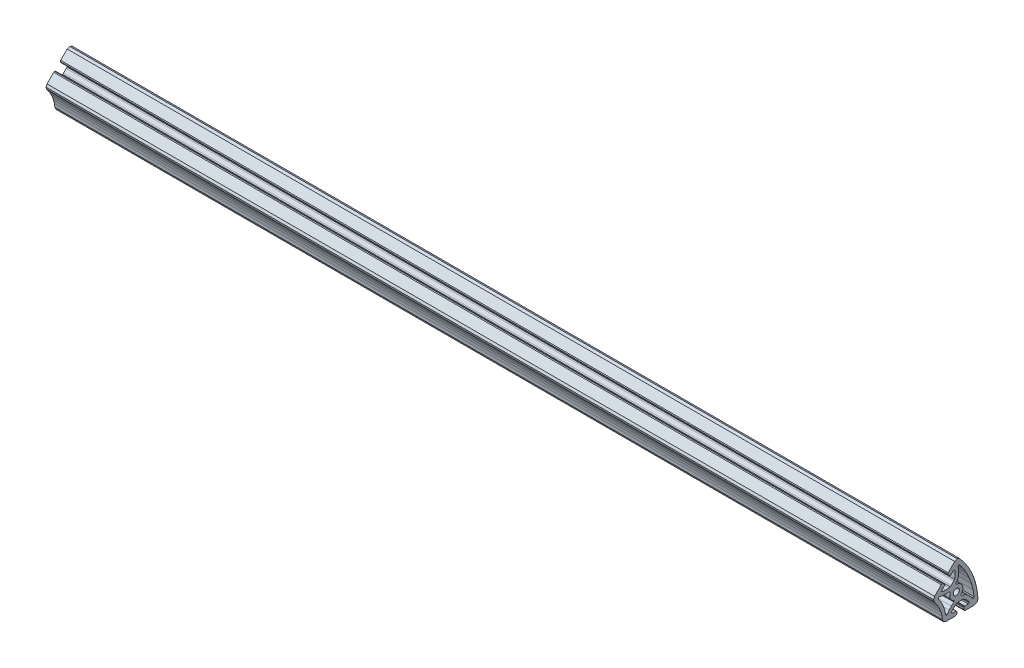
ISO-10303-21;
HEADER;
FILE_DESCRIPTION(('STEP AP214'),'2;1');
FILE_NAME('part.step','',(''),(''),'','','');
FILE_SCHEMA(('AUTOMOTIVE_DESIGN { 1 0 10303 214 1 1 1 1 }'));
ENDSEC;
DATA;
#1=APPLICATION_CONTEXT('core data for automotive mechanical design processes');
#2=APPLICATION_PROTOCOL_DEFINITION('international standard','automotive_design',2000,#1);
#3=PRODUCT_CONTEXT('',#1,'mechanical');
#4=PRODUCT('Part','Part','',(#3));
#5=PRODUCT_RELATED_PRODUCT_CATEGORY('part','',(#4));
#6=PRODUCT_DEFINITION_FORMATION('','',#4);
#7=PRODUCT_DEFINITION_CONTEXT('part definition',#1,'design');
#8=PRODUCT_DEFINITION('design','',#6,#7);
#9=PRODUCT_DEFINITION_SHAPE('','',#8);
#10=(LENGTH_UNIT() NAMED_UNIT(*) SI_UNIT(.MILLI.,.METRE.));
#11=(NAMED_UNIT(*) PLANE_ANGLE_UNIT() SI_UNIT($,.RADIAN.));
#12=(NAMED_UNIT(*) SI_UNIT($,.STERADIAN.) SOLID_ANGLE_UNIT());
#13=UNCERTAINTY_MEASURE_WITH_UNIT(LENGTH_MEASURE(1.E-05),#10,'distance_accuracy_value','');
#14=(GEOMETRIC_REPRESENTATION_CONTEXT(3) GLOBAL_UNCERTAINTY_ASSIGNED_CONTEXT((#13)) GLOBAL_UNIT_ASSIGNED_CONTEXT((#10,
#11,#12)) REPRESENTATION_CONTEXT('',''));
#15=CARTESIAN_POINT('',(0.,0.,0.));
#16=DIRECTION('',(0.,0.,1.));
#17=DIRECTION('',(1.,0.,0.));
#18=AXIS2_PLACEMENT_3D('',#15,#16,#17);
#19=CARTESIAN_POINT('',(1000.,-9.47031057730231,13.551975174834));
#20=DIRECTION('',(0.,0.344928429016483,-0.938628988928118));
#21=DIRECTION('',(0.,0.938628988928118,0.344928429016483));
#22=AXIS2_PLACEMENT_3D('',#19,#20,#21);
#23=PLANE('',#22);
#24=DIRECTION('',(0.,-0.938628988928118,-0.344928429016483));
#25=VECTOR('',#24,1.);
#26=CARTESIAN_POINT('',(0.,-9.47031057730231,13.551975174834));
#27=LINE('',#26,#25);
#28=CARTESIAN_POINT('',(0.,-6.12293491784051,14.7820725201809));
#29=VERTEX_POINT('',#28);
#30=CARTESIAN_POINT('',(0.,-9.47031057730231,13.551975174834));
#31=VERTEX_POINT('',#30);
#32=EDGE_CURVE('E1302',#29,#31,#27,.T.);
#33=ORIENTED_EDGE('',*,*,#32,.F.);
#34=DIRECTION('',(-1.,0.,0.));
#35=VECTOR('',#34,1.);
#36=CARTESIAN_POINT('',(1000.,-6.12293491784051,14.7820725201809));
#37=LINE('',#36,#35);
#38=CARTESIAN_POINT('',(1000.,-6.12293491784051,14.7820725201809));
#39=VERTEX_POINT('',#38);
#40=EDGE_CURVE('E13',#39,#29,#37,.T.);
#41=ORIENTED_EDGE('',*,*,#40,.F.);
#42=DIRECTION('',(0.,-0.938628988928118,-0.344928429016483));
#43=VECTOR('',#42,1.);
#44=CARTESIAN_POINT('',(1000.,-9.47031057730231,13.551975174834));
#45=LINE('',#44,#43);
#46=CARTESIAN_POINT('',(1000.,-9.47031057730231,13.551975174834));
#47=VERTEX_POINT('',#46);
#48=EDGE_CURVE('E1925',#39,#47,#45,.T.);
#49=ORIENTED_EDGE('',*,*,#48,.T.);
#50=DIRECTION('',(-1.,0.,0.));
#51=VECTOR('',#50,1.);
#52=CARTESIAN_POINT('',(1000.,-9.47031057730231,13.551975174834));
#53=LINE('',#52,#51);
#54=EDGE_CURVE('E285',#47,#31,#53,.T.);
#55=ORIENTED_EDGE('',*,*,#54,.T.);
#56=EDGE_LOOP('',(#33,#41,#49,#55));
#57=FACE_BOUND('',#56,.T.);
#58=ADVANCED_FACE('F266',(#57),#23,.T.);
#59=CARTESIAN_POINT('',(1000.,-6.12293491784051,14.7820725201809));
#60=DIRECTION('',(0.,0.419809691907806,-0.907612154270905));
#61=DIRECTION('',(0.,0.907612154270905,0.419809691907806));
#62=AXIS2_PLACEMENT_3D('',#59,#60,#61);
#63=PLANE('',#62);
#64=DIRECTION('',(0.,-0.907612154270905,-0.419809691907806));
#65=VECTOR('',#64,1.);
#66=CARTESIAN_POINT('',(0.,-6.12293491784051,14.7820725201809));
#67=LINE('',#66,#65);
#68=CARTESIAN_POINT('',(0.,-2.88617271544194,16.2792143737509));
#69=VERTEX_POINT('',#68);
#70=EDGE_CURVE('E1304',#69,#29,#67,.T.);
#71=ORIENTED_EDGE('',*,*,#70,.F.);
#72=DIRECTION('',(-1.,0.,0.));
#73=VECTOR('',#72,1.);
#74=CARTESIAN_POINT('',(1000.,-2.88617271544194,16.2792143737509));
#75=LINE('',#74,#73);
#76=CARTESIAN_POINT('',(1000.,-2.88617271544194,16.2792143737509));
#77=VERTEX_POINT('',#76);
#78=EDGE_CURVE('E276',#77,#69,#75,.T.);
#79=ORIENTED_EDGE('',*,*,#78,.F.);
#80=DIRECTION('',(0.,-0.907612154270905,-0.419809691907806));
#81=VECTOR('',#80,1.);
#82=CARTESIAN_POINT('',(1000.,-6.12293491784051,14.7820725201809));
#83=LINE('',#82,#81);
#84=EDGE_CURVE('E1927',#77,#39,#83,.T.);
#85=ORIENTED_EDGE('',*,*,#84,.T.);
#86=ORIENTED_EDGE('',*,*,#40,.T.);
#87=EDGE_LOOP('',(#71,#79,#85,#86));
#88=FACE_BOUND('',#87,.T.);
#89=ADVANCED_FACE('F1993',(#88),#63,.T.);
#90=CARTESIAN_POINT('',(1000.,-2.88617271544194,16.2792143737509));
#91=DIRECTION('',(0.,0.491933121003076,-0.870632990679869));
#92=DIRECTION('',(0.,0.870632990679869,0.491933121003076));
#93=AXIS2_PLACEMENT_3D('',#90,#91,#92);
#94=PLANE('',#93);
#95=DIRECTION('',(0.,-0.870632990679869,-0.491933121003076));
#96=VECTOR('',#95,1.);
#97=CARTESIAN_POINT('',(0.,-2.88617271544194,16.2792143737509));
#98=LINE('',#97,#96);
#99=CARTESIAN_POINT('',(0.,0.218712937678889,18.0335656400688));
#100=VERTEX_POINT('',#99);
#101=EDGE_CURVE('E1307',#100,#69,#98,.T.);
#102=ORIENTED_EDGE('',*,*,#101,.F.);
#103=DIRECTION('',(-1.,0.,0.));
#104=VECTOR('',#103,1.);
#105=CARTESIAN_POINT('',(1000.,0.218712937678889,18.0335656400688));
#106=LINE('',#105,#104);
#107=CARTESIAN_POINT('',(1000.,0.218712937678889,18.0335656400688));
#108=VERTEX_POINT('',#107);
#109=EDGE_CURVE('E1394',#108,#100,#106,.T.);
#110=ORIENTED_EDGE('',*,*,#109,.F.);
#111=DIRECTION('',(0.,-0.870632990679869,-0.491933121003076));
#112=VECTOR('',#111,1.);
#113=CARTESIAN_POINT('',(1000.,-2.88617271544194,16.2792143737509));
#114=LINE('',#113,#112);
#115=EDGE_CURVE('E1930',#108,#77,#114,.T.);
#116=ORIENTED_EDGE('',*,*,#115,.T.);
#117=ORIENTED_EDGE('',*,*,#78,.T.);
#118=EDGE_LOOP('',(#102,#110,#116,#117));
#119=FACE_BOUND('',#118,.T.);
#120=ADVANCED_FACE('F1998',(#119),#94,.T.);
#121=CARTESIAN_POINT('',(1000.,0.218712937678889,18.0335656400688));
#122=DIRECTION('',(0.,0.561476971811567,-0.827492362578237));
#123=DIRECTION('',(0.,0.827492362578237,0.561476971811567));
#124=AXIS2_PLACEMENT_3D('',#121,#122,#123);
#125=PLANE('',#124);
#126=DIRECTION('',(0.,-0.827492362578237,-0.561476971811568));
#127=VECTOR('',#126,1.);
#128=CARTESIAN_POINT('',(0.,0.218712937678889,18.0335656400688));
#129=LINE('',#128,#127);
#130=CARTESIAN_POINT('',(0.,3.2524582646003,20.0920476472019));
#131=VERTEX_POINT('',#130);
#132=EDGE_CURVE('E1310',#131,#100,#129,.T.);
#133=ORIENTED_EDGE('',*,*,#132,.F.);
#134=DIRECTION('',(-1.,0.,0.));
#135=VECTOR('',#134,1.);
#136=CARTESIAN_POINT('',(1000.,3.2524582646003,20.0920476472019));
#137=LINE('',#136,#135);
#138=CARTESIAN_POINT('',(1000.,3.2524582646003,20.0920476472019));
#139=VERTEX_POINT('',#138);
#140=EDGE_CURVE('E1392',#139,#131,#137,.T.);
#141=ORIENTED_EDGE('',*,*,#140,.F.);
#142=DIRECTION('',(0.,-0.827492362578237,-0.561476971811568));
#143=VECTOR('',#142,1.);
#144=CARTESIAN_POINT('',(1000.,0.218712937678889,18.0335656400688));
#145=LINE('',#144,#143);
#146=EDGE_CURVE('E1933',#139,#108,#145,.T.);
#147=ORIENTED_EDGE('',*,*,#146,.T.);
#148=ORIENTED_EDGE('',*,*,#109,.T.);
#149=EDGE_LOOP('',(#133,#141,#147,#148));
#150=FACE_BOUND('',#149,.T.);
#151=ADVANCED_FACE('F3131',(#150),#125,.T.);
#152=CARTESIAN_POINT('',(1000.,4.36515550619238,20.088778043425));
#153=DIRECTION('',(0.,-0.00293843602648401,-0.99999568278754));
#154=DIRECTION('',(0.,0.99999568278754,-0.00293843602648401));
#155=AXIS2_PLACEMENT_3D('',#152,#153,#154);
#156=PLANE('',#155);
#157=DIRECTION('',(0.,-0.99999568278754,0.00293843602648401));
#158=VECTOR('',#157,1.);
#159=CARTESIAN_POINT('',(0.,4.36515550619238,20.088778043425));
#160=LINE('',#159,#158);
#161=CARTESIAN_POINT('',(0.,4.36515550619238,20.088778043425));
#162=VERTEX_POINT('',#161);
#163=EDGE_CURVE('E1313',#162,#131,#160,.T.);
#164=ORIENTED_EDGE('',*,*,#163,.F.);
#165=DIRECTION('',(-1.,0.,0.));
#166=VECTOR('',#165,1.);
#167=CARTESIAN_POINT('',(1000.,4.36515550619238,20.088778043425));
#168=LINE('',#167,#166);
#169=CARTESIAN_POINT('',(1000.,4.36515550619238,20.088778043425));
#170=VERTEX_POINT('',#169);
#171=EDGE_CURVE('E1390',#170,#162,#168,.T.);
#172=ORIENTED_EDGE('',*,*,#171,.F.);
#173=DIRECTION('',(0.,-0.99999568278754,0.00293843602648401));
#174=VECTOR('',#173,1.);
#175=CARTESIAN_POINT('',(1000.,4.36515550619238,20.088778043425));
#176=LINE('',#175,#174);
#177=EDGE_CURVE('E1936',#170,#139,#176,.T.);
#178=ORIENTED_EDGE('',*,*,#177,.T.);
#179=ORIENTED_EDGE('',*,*,#140,.T.);
#180=EDGE_LOOP('',(#164,#172,#178,#179));
#181=FACE_BOUND('',#180,.T.);
#182=ADVANCED_FACE('F3140',(#181),#156,.T.);
#183=CARTESIAN_POINT('',(1000.,4.36515550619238,20.088778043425));
#184=DIRECTION('',(0.,-0.943164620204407,-0.33232589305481));
#185=DIRECTION('',(0.,0.33232589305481,-0.943164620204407));
#186=AXIS2_PLACEMENT_3D('',#183,#184,#185);
#187=PLANE('',#186);
#188=DIRECTION('',(0.,-0.33232589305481,0.943164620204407));
#189=VECTOR('',#188,1.);
#190=CARTESIAN_POINT('',(0.,4.36515550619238,20.088778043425));
#191=LINE('',#190,#189);
#192=CARTESIAN_POINT('',(0.,4.76232243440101,18.9615899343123));
#193=VERTEX_POINT('',#192);
#194=EDGE_CURVE('E1316',#193,#162,#191,.T.);
#195=ORIENTED_EDGE('',*,*,#194,.F.);
#196=DIRECTION('',(-1.,0.,0.));
#197=VECTOR('',#196,1.);
#198=CARTESIAN_POINT('',(1000.,4.76232243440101,18.9615899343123));
#199=LINE('',#198,#197);
#200=CARTESIAN_POINT('',(1000.,4.76232243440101,18.9615899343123));
#201=VERTEX_POINT('',#200);
#202=EDGE_CURVE('E1388',#201,#193,#199,.T.);
#203=ORIENTED_EDGE('',*,*,#202,.F.);
#204=DIRECTION('',(0.,-0.33232589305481,0.943164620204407));
#205=VECTOR('',#204,1.);
#206=CARTESIAN_POINT('',(1000.,4.36515550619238,20.088778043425));
#207=LINE('',#206,#205);
#208=EDGE_CURVE('E1939',#201,#170,#207,.T.);
#209=ORIENTED_EDGE('',*,*,#208,.T.);
#210=ORIENTED_EDGE('',*,*,#171,.T.);
#211=EDGE_LOOP('',(#195,#203,#209,#210));
#212=FACE_BOUND('',#211,.T.);
#213=ADVANCED_FACE('F3150',(#212),#187,.T.);
#214=CARTESIAN_POINT('',(1000.,4.76232243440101,18.9615899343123));
#215=DIRECTION('',(0.,-0.982607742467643,0.185693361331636));
#216=DIRECTION('',(0.,-0.185693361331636,-0.982607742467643));
#217=AXIS2_PLACEMENT_3D('',#214,#215,#216);
#218=PLANE('',#217);
#219=DIRECTION('',(0.,0.185693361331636,0.982607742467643));
#220=VECTOR('',#219,1.);
#221=CARTESIAN_POINT('',(0.,4.76232243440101,18.9615899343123));
#222=LINE('',#221,#220);
#223=CARTESIAN_POINT('',(0.,4.07769493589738,15.338841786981));
#224=VERTEX_POINT('',#223);
#225=EDGE_CURVE('E1319',#224,#193,#222,.T.);
#226=ORIENTED_EDGE('',*,*,#225,.F.);
#227=DIRECTION('',(-1.,0.,0.));
#228=VECTOR('',#227,1.);
#229=CARTESIAN_POINT('',(1000.,4.07769493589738,15.338841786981));
#230=LINE('',#229,#228);
#231=CARTESIAN_POINT('',(1000.,4.07769493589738,15.338841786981));
#232=VERTEX_POINT('',#231);
#233=EDGE_CURVE('E1386',#232,#224,#230,.T.);
#234=ORIENTED_EDGE('',*,*,#233,.F.);
#235=DIRECTION('',(0.,0.185693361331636,0.982607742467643));
#236=VECTOR('',#235,1.);
#237=CARTESIAN_POINT('',(1000.,4.76232243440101,18.9615899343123));
#238=LINE('',#237,#236);
#239=EDGE_CURVE('E1942',#232,#201,#238,.T.);
#240=ORIENTED_EDGE('',*,*,#239,.T.);
#241=ORIENTED_EDGE('',*,*,#202,.T.);
#242=EDGE_LOOP('',(#226,#234,#240,#241));
#243=FACE_BOUND('',#242,.T.);
#244=ADVANCED_FACE('F3160',(#243),#218,.T.);
#245=CARTESIAN_POINT('',(1000.,4.07769493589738,15.338841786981));
#246=DIRECTION('',(0.,-0.99822693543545,0.0595229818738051));
#247=DIRECTION('',(0.,-0.0595229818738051,-0.99822693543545));
#248=AXIS2_PLACEMENT_3D('',#245,#246,#247);
#249=PLANE('',#248);
#250=DIRECTION('',(0.,0.0595229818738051,0.99822693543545));
#251=VECTOR('',#250,1.);
#252=CARTESIAN_POINT('',(0.,4.07769493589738,15.338841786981));
#253=LINE('',#252,#251);
#254=CARTESIAN_POINT('',(0.,3.85824137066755,11.6585076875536));
#255=VERTEX_POINT('',#254);
#256=EDGE_CURVE('E1322',#255,#224,#253,.T.);
#257=ORIENTED_EDGE('',*,*,#256,.F.);
#258=DIRECTION('',(-1.,0.,0.));
#259=VECTOR('',#258,1.);
#260=CARTESIAN_POINT('',(1000.,3.85824137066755,11.6585076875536));
#261=LINE('',#260,#259);
#262=CARTESIAN_POINT('',(1000.,3.85824137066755,11.6585076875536));
#263=VERTEX_POINT('',#262);
#264=EDGE_CURVE('E1384',#263,#255,#261,.T.);
#265=ORIENTED_EDGE('',*,*,#264,.F.);
#266=DIRECTION('',(0.,0.0595229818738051,0.99822693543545));
#267=VECTOR('',#266,1.);
#268=CARTESIAN_POINT('',(1000.,4.07769493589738,15.338841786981));
#269=LINE('',#268,#267);
#270=EDGE_CURVE('E1945',#263,#232,#269,.T.);
#271=ORIENTED_EDGE('',*,*,#270,.T.);
#272=ORIENTED_EDGE('',*,*,#233,.T.);
#273=EDGE_LOOP('',(#257,#265,#271,#272));
#274=FACE_BOUND('',#273,.T.);
#275=ADVANCED_FACE('F3170',(#274),#249,.T.);
#276=CARTESIAN_POINT('',(1000.,3.85824137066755,11.6585076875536));
#277=DIRECTION('',(0.,-0.997617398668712,-0.0689893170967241));
#278=DIRECTION('',(0.,0.0689893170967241,-0.997617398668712));
#279=AXIS2_PLACEMENT_3D('',#276,#277,#278);
#280=PLANE('',#279);
#281=DIRECTION('',(0.,-0.0689893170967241,0.997617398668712));
#282=VECTOR('',#281,1.);
#283=CARTESIAN_POINT('',(0.,3.85824137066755,11.6585076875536));
#284=LINE('',#283,#282);
#285=CARTESIAN_POINT('',(0.,4.11948530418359,7.88079971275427));
#286=VERTEX_POINT('',#285);
#287=EDGE_CURVE('E1325',#286,#255,#284,.T.);
#288=ORIENTED_EDGE('',*,*,#287,.F.);
#289=DIRECTION('',(-1.,0.,0.));
#290=VECTOR('',#289,1.);
#291=CARTESIAN_POINT('',(1000.,4.11948530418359,7.88079971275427));
#292=LINE('',#291,#290);
#293=CARTESIAN_POINT('',(1000.,4.11948530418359,7.88079971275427));
#294=VERTEX_POINT('',#293);
#295=EDGE_CURVE('E1382',#294,#286,#292,.T.);
#296=ORIENTED_EDGE('',*,*,#295,.F.);
#297=DIRECTION('',(0.,-0.0689893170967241,0.997617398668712));
#298=VECTOR('',#297,1.);
#299=CARTESIAN_POINT('',(1000.,3.85824137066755,11.6585076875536));
#300=LINE('',#299,#298);
#301=EDGE_CURVE('E1948',#294,#263,#300,.T.);
#302=ORIENTED_EDGE('',*,*,#301,.T.);
#303=ORIENTED_EDGE('',*,*,#264,.T.);
#304=EDGE_LOOP('',(#288,#296,#302,#303));
#305=FACE_BOUND('',#304,.T.);
#306=ADVANCED_FACE('F3180',(#305),#280,.T.);
#307=CARTESIAN_POINT('',(1000.,4.11948530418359,7.88079971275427));
#308=DIRECTION('',(0.,-0.915846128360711,0.401529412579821));
#309=DIRECTION('',(0.,-0.401529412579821,-0.915846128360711));
#310=AXIS2_PLACEMENT_3D('',#307,#308,#309);
#311=PLANE('',#310);
#312=DIRECTION('',(0.,0.401529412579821,0.915846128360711));
#313=VECTOR('',#312,1.);
#314=CARTESIAN_POINT('',(0.,4.11948530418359,7.88079971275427));
#315=LINE('',#314,#313);
#316=CARTESIAN_POINT('',(0.,3.73717629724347,7.0087932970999));
#317=VERTEX_POINT('',#316);
#318=EDGE_CURVE('E1328',#317,#286,#315,.T.);
#319=ORIENTED_EDGE('',*,*,#318,.F.);
#320=DIRECTION('',(-1.,0.,0.));
#321=VECTOR('',#320,1.);
#322=CARTESIAN_POINT('',(1000.,3.73717629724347,7.0087932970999));
#323=LINE('',#322,#321);
#324=CARTESIAN_POINT('',(1000.,3.73717629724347,7.0087932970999));
#325=VERTEX_POINT('',#324);
#326=EDGE_CURVE('E1380',#325,#317,#323,.T.);
#327=ORIENTED_EDGE('',*,*,#326,.F.);
#328=DIRECTION('',(0.,0.401529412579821,0.915846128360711));
#329=VECTOR('',#328,1.);
#330=CARTESIAN_POINT('',(1000.,4.11948530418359,7.88079971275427));
#331=LINE('',#330,#329);
#332=EDGE_CURVE('E1951',#325,#294,#331,.T.);
#333=ORIENTED_EDGE('',*,*,#332,.T.);
#334=ORIENTED_EDGE('',*,*,#295,.T.);
#335=EDGE_LOOP('',(#319,#327,#333,#334));
#336=FACE_BOUND('',#335,.T.);
#337=ADVANCED_FACE('F3190',(#336),#311,.T.);
#338=CARTESIAN_POINT('',(1000.,3.73717629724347,7.0087932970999));
#339=DIRECTION('',(0.,-0.116183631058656,0.9932277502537));
#340=DIRECTION('',(0.,-0.9932277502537,-0.116183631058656));
#341=AXIS2_PLACEMENT_3D('',#338,#339,#340);
#342=PLANE('',#341);
#343=DIRECTION('',(0.,0.9932277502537,0.116183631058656));
#344=VECTOR('',#343,1.);
#345=CARTESIAN_POINT('',(0.,3.73717629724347,7.0087932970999));
#346=LINE('',#345,#344);
#347=CARTESIAN_POINT('',(0.,2.7046713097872,6.88801517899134));
#348=VERTEX_POINT('',#347);
#349=EDGE_CURVE('E1331',#348,#317,#346,.T.);
#350=ORIENTED_EDGE('',*,*,#349,.F.);
#351=DIRECTION('',(-1.,0.,0.));
#352=VECTOR('',#351,1.);
#353=CARTESIAN_POINT('',(1000.,2.7046713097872,6.88801517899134));
#354=LINE('',#353,#352);
#355=CARTESIAN_POINT('',(1000.,2.7046713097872,6.88801517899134));
#356=VERTEX_POINT('',#355);
#357=EDGE_CURVE('E1378',#356,#348,#354,.T.);
#358=ORIENTED_EDGE('',*,*,#357,.F.);
#359=DIRECTION('',(0.,0.9932277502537,0.116183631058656));
#360=VECTOR('',#359,1.);
#361=CARTESIAN_POINT('',(1000.,3.73717629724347,7.0087932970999));
#362=LINE('',#361,#360);
#363=EDGE_CURVE('E1954',#356,#325,#362,.T.);
#364=ORIENTED_EDGE('',*,*,#363,.T.);
#365=ORIENTED_EDGE('',*,*,#326,.T.);
#366=EDGE_LOOP('',(#350,#358,#364,#365));
#367=FACE_BOUND('',#366,.T.);
#368=ADVANCED_FACE('F3200',(#367),#342,.T.);
#369=CARTESIAN_POINT('',(1000.,0.,0.));
#370=DIRECTION('',(-1.,0.,0.));
#371=DIRECTION('',(0.,0.,1.));
#372=AXIS2_PLACEMENT_3D('',#369,#370,#371);
#373=CYLINDRICAL_SURFACE('',#372,7.40000000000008);
#374=CARTESIAN_POINT('',(0.,0.,0.));
#375=DIRECTION('',(-1.,0.,0.));
#376=DIRECTION('',(0.,0.,-1.));
#377=AXIS2_PLACEMENT_3D('',#374,#375,#376);
#378=CIRCLE('',#377,7.40000000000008);
#379=CARTESIAN_POINT('',(0.,-6.78305366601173,2.95807081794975));
#380=VERTEX_POINT('',#379);
#381=EDGE_CURVE('E1334',#380,#348,#378,.T.);
#382=ORIENTED_EDGE('',*,*,#381,.F.);
#383=DIRECTION('',(-1.,0.,0.));
#384=VECTOR('',#383,1.);
#385=CARTESIAN_POINT('',(1000.,-6.78305366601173,2.95807081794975));
#386=LINE('',#385,#384);
#387=CARTESIAN_POINT('',(1000.,-6.78305366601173,2.95807081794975));
#388=VERTEX_POINT('',#387);
#389=EDGE_CURVE('E1376',#388,#380,#386,.T.);
#390=ORIENTED_EDGE('',*,*,#389,.F.);
#391=CARTESIAN_POINT('',(1000.,0.,0.));
#392=DIRECTION('',(-1.,0.,0.));
#393=DIRECTION('',(0.,0.,-1.));
#394=AXIS2_PLACEMENT_3D('',#391,#392,#393);
#395=CIRCLE('',#394,7.40000000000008);
#396=EDGE_CURVE('E1957',#388,#356,#395,.T.);
#397=ORIENTED_EDGE('',*,*,#396,.T.);
#398=ORIENTED_EDGE('',*,*,#357,.T.);
#399=EDGE_LOOP('',(#382,#390,#397,#398));
#400=FACE_BOUND('',#399,.T.);
#401=ADVANCED_FACE('F3210',(#400),#373,.T.);
#402=CARTESIAN_POINT('',(1000.,-7.59854797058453,2.31338256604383));
#403=DIRECTION('',(0.,-0.620163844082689,0.78447231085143));
#404=DIRECTION('',(0.,-0.78447231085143,-0.620163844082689));
#405=AXIS2_PLACEMENT_3D('',#402,#403,#404);
#406=PLANE('',#405);
#407=DIRECTION('',(0.,0.78447231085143,0.620163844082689));
#408=VECTOR('',#407,1.);
#409=CARTESIAN_POINT('',(0.,-7.59854797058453,2.31338256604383));
#410=LINE('',#409,#408);
#411=CARTESIAN_POINT('',(0.,-7.59854797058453,2.31338256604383));
#412=VERTEX_POINT('',#411);
#413=EDGE_CURVE('E1337',#412,#380,#410,.T.);
#414=ORIENTED_EDGE('',*,*,#413,.F.);
#415=DIRECTION('',(-1.,0.,0.));
#416=VECTOR('',#415,1.);
#417=CARTESIAN_POINT('',(1000.,-7.59854797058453,2.31338256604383));
#418=LINE('',#417,#416);
#419=CARTESIAN_POINT('',(1000.,-7.59854797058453,2.31338256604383));
#420=VERTEX_POINT('',#419);
#421=EDGE_CURVE('E1374',#420,#412,#418,.T.);
#422=ORIENTED_EDGE('',*,*,#421,.F.);
#423=DIRECTION('',(0.,0.78447231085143,0.620163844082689));
#424=VECTOR('',#423,1.);
#425=CARTESIAN_POINT('',(1000.,-7.59854797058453,2.31338256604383));
#426=LINE('',#425,#424);
#427=EDGE_CURVE('E1960',#420,#388,#426,.T.);
#428=ORIENTED_EDGE('',*,*,#427,.T.);
#429=ORIENTED_EDGE('',*,*,#389,.T.);
#430=EDGE_LOOP('',(#414,#422,#428,#429));
#431=FACE_BOUND('',#430,.T.);
#432=ADVANCED_FACE('F3220',(#431),#406,.T.);
#433=CARTESIAN_POINT('',(1000.,-8.48548291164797,2.65965092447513));
#434=DIRECTION('',(0.,0.363676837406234,0.931525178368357));
#435=DIRECTION('',(0.,-0.931525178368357,0.363676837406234));
#436=AXIS2_PLACEMENT_3D('',#433,#434,#435);
#437=PLANE('',#436);
#438=DIRECTION('',(0.,0.931525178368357,-0.363676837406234));
#439=VECTOR('',#438,1.);
#440=CARTESIAN_POINT('',(0.,-8.48548291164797,2.65965092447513));
#441=LINE('',#440,#439);
#442=CARTESIAN_POINT('',(0.,-8.48548291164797,2.65965092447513));
#443=VERTEX_POINT('',#442);
#444=EDGE_CURVE('E1340',#443,#412,#441,.T.);
#445=ORIENTED_EDGE('',*,*,#444,.F.);
#446=DIRECTION('',(-1.,0.,0.));
#447=VECTOR('',#446,1.);
#448=CARTESIAN_POINT('',(1000.,-8.48548291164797,2.65965092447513));
#449=LINE('',#448,#447);
#450=CARTESIAN_POINT('',(1000.,-8.48548291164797,2.65965092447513));
#451=VERTEX_POINT('',#450);
#452=EDGE_CURVE('E1372',#451,#443,#449,.T.);
#453=ORIENTED_EDGE('',*,*,#452,.F.);
#454=DIRECTION('',(0.,0.931525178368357,-0.363676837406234));
#455=VECTOR('',#454,1.);
#456=CARTESIAN_POINT('',(1000.,-8.48548291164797,2.65965092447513));
#457=LINE('',#456,#455);
#458=EDGE_CURVE('E1963',#451,#420,#457,.T.);
#459=ORIENTED_EDGE('',*,*,#458,.T.);
#460=ORIENTED_EDGE('',*,*,#421,.T.);
#461=EDGE_LOOP('',(#445,#453,#459,#460));
#462=FACE_BOUND('',#461,.T.);
#463=ADVANCED_FACE('F3230',(#462),#437,.T.);
#464=CARTESIAN_POINT('',(1000.,-10.9719984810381,5.51562120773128));
#465=DIRECTION('',(0.,0.754204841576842,0.656639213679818));
#466=DIRECTION('',(0.,-0.656639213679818,0.754204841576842));
#467=AXIS2_PLACEMENT_3D('',#464,#465,#466);
#468=PLANE('',#467);
#469=DIRECTION('',(0.,0.656639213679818,-0.754204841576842));
#470=VECTOR('',#469,1.);
#471=CARTESIAN_POINT('',(0.,-10.9719984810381,5.51562120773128));
#472=LINE('',#471,#470);
#473=CARTESIAN_POINT('',(0.,-10.9719984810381,5.51562120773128));
#474=VERTEX_POINT('',#473);
#475=EDGE_CURVE('E1343',#474,#443,#472,.T.);
#476=ORIENTED_EDGE('',*,*,#475,.F.);
#477=DIRECTION('',(-1.,0.,0.));
#478=VECTOR('',#477,1.);
#479=CARTESIAN_POINT('',(1000.,-10.9719984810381,5.51562120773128));
#480=LINE('',#479,#478);
#481=CARTESIAN_POINT('',(1000.,-10.9719984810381,5.51562120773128));
#482=VERTEX_POINT('',#481);
#483=EDGE_CURVE('E1370',#482,#474,#480,.T.);
#484=ORIENTED_EDGE('',*,*,#483,.F.);
#485=DIRECTION('',(0.,0.656639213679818,-0.754204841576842));
#486=VECTOR('',#485,1.);
#487=CARTESIAN_POINT('',(1000.,-10.9719984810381,5.51562120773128));
#488=LINE('',#487,#486);
#489=EDGE_CURVE('E1966',#482,#451,#488,.T.);
#490=ORIENTED_EDGE('',*,*,#489,.T.);
#491=ORIENTED_EDGE('',*,*,#452,.T.);
#492=EDGE_LOOP('',(#476,#484,#490,#491));
#493=FACE_BOUND('',#492,.T.);
#494=ADVANCED_FACE('F3240',(#493),#468,.T.);
#495=CARTESIAN_POINT('',(1000.,-13.7295647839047,7.9628333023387));
#496=DIRECTION('',(0.,0.663763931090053,0.747942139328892));
#497=DIRECTION('',(0.,-0.747942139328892,0.663763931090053));
#498=AXIS2_PLACEMENT_3D('',#495,#496,#497);
#499=PLANE('',#498);
#500=DIRECTION('',(0.,0.747942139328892,-0.663763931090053));
#501=VECTOR('',#500,1.);
#502=CARTESIAN_POINT('',(0.,-13.7295647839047,7.9628333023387));
#503=LINE('',#502,#501);
#504=CARTESIAN_POINT('',(0.,-13.7295647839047,7.9628333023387));
#505=VERTEX_POINT('',#504);
#506=EDGE_CURVE('E1346',#505,#474,#503,.T.);
#507=ORIENTED_EDGE('',*,*,#506,.F.);
#508=DIRECTION('',(-1.,0.,0.));
#509=VECTOR('',#508,1.);
#510=CARTESIAN_POINT('',(1000.,-13.7295647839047,7.9628333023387));
#511=LINE('',#510,#509);
#512=CARTESIAN_POINT('',(1000.,-13.7295647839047,7.9628333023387));
#513=VERTEX_POINT('',#512);
#514=EDGE_CURVE('E1368',#513,#505,#511,.T.);
#515=ORIENTED_EDGE('',*,*,#514,.F.);
#516=DIRECTION('',(0.,0.747942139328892,-0.663763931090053));
#517=VECTOR('',#516,1.);
#518=CARTESIAN_POINT('',(1000.,-13.7295647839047,7.9628333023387));
#519=LINE('',#518,#517);
#520=EDGE_CURVE('E1969',#513,#482,#519,.T.);
#521=ORIENTED_EDGE('',*,*,#520,.T.);
#522=ORIENTED_EDGE('',*,*,#483,.T.);
#523=EDGE_LOOP('',(#507,#515,#521,#522));
#524=FACE_BOUND('',#523,.T.);
#525=ADVANCED_FACE('F3250',(#524),#499,.T.);
#526=CARTESIAN_POINT('',(1000.,-16.8607825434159,10.0923405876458));
#527=DIRECTION('',(0.,0.562360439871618,0.826892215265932));
#528=DIRECTION('',(0.,-0.826892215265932,0.562360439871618));
#529=AXIS2_PLACEMENT_3D('',#526,#527,#528);
#530=PLANE('',#529);
#531=DIRECTION('',(0.,0.826892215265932,-0.562360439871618));
#532=VECTOR('',#531,1.);
#533=CARTESIAN_POINT('',(0.,-16.8607825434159,10.0923405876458));
#534=LINE('',#533,#532);
#535=CARTESIAN_POINT('',(0.,-16.8607825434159,10.0923405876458));
#536=VERTEX_POINT('',#535);
#537=EDGE_CURVE('E1349',#536,#505,#534,.T.);
#538=ORIENTED_EDGE('',*,*,#537,.F.);
#539=DIRECTION('',(-1.,0.,0.));
#540=VECTOR('',#539,1.);
#541=CARTESIAN_POINT('',(1000.,-16.8607825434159,10.0923405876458));
#542=LINE('',#541,#540);
#543=CARTESIAN_POINT('',(1000.,-16.8607825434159,10.0923405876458));
#544=VERTEX_POINT('',#543);
#545=EDGE_CURVE('E1366',#544,#536,#542,.T.);
#546=ORIENTED_EDGE('',*,*,#545,.F.);
#547=DIRECTION('',(0.,0.826892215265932,-0.562360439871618));
#548=VECTOR('',#547,1.);
#549=CARTESIAN_POINT('',(1000.,-16.8607825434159,10.0923405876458));
#550=LINE('',#549,#548);
#551=EDGE_CURVE('E1972',#544,#513,#550,.T.);
#552=ORIENTED_EDGE('',*,*,#551,.T.);
#553=ORIENTED_EDGE('',*,*,#514,.T.);
#554=EDGE_LOOP('',(#538,#546,#552,#553));
#555=FACE_BOUND('',#554,.T.);
#556=ADVANCED_FACE('F3260',(#555),#530,.T.);
#557=CARTESIAN_POINT('',(1000.,-17.2915422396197,11.1182801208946));
#558=DIRECTION('',(0.,0.922025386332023,0.387129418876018));
#559=DIRECTION('',(0.,-0.387129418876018,0.922025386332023));
#560=AXIS2_PLACEMENT_3D('',#557,#558,#559);
#561=PLANE('',#560);
#562=DIRECTION('',(0.,0.387129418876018,-0.922025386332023));
#563=VECTOR('',#562,1.);
#564=CARTESIAN_POINT('',(0.,-17.2915422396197,11.1182801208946));
#565=LINE('',#564,#563);
#566=CARTESIAN_POINT('',(0.,-17.2915422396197,11.1182801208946));
#567=VERTEX_POINT('',#566);
#568=EDGE_CURVE('E1352',#567,#536,#565,.T.);
#569=ORIENTED_EDGE('',*,*,#568,.F.);
#570=DIRECTION('',(-1.,0.,0.));
#571=VECTOR('',#570,1.);
#572=CARTESIAN_POINT('',(1000.,-17.2915422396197,11.1182801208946));
#573=LINE('',#572,#571);
#574=CARTESIAN_POINT('',(1000.,-17.2915422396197,11.1182801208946));
#575=VERTEX_POINT('',#574);
#576=EDGE_CURVE('E1043',#575,#567,#573,.T.);
#577=ORIENTED_EDGE('',*,*,#576,.F.);
#578=DIRECTION('',(0.,0.387129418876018,-0.922025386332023));
#579=VECTOR('',#578,1.);
#580=CARTESIAN_POINT('',(1000.,-17.2915422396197,11.1182801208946));
#581=LINE('',#580,#579);
#582=EDGE_CURVE('E1054',#575,#544,#581,.T.);
#583=ORIENTED_EDGE('',*,*,#582,.T.);
#584=ORIENTED_EDGE('',*,*,#545,.T.);
#585=EDGE_LOOP('',(#569,#577,#583,#584));
#586=FACE_BOUND('',#585,.T.);
#587=ADVANCED_FACE('F1976',(#586),#561,.T.);
#588=CARTESIAN_POINT('',(1000.,-17.2915422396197,11.1182801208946));
#589=DIRECTION('',(0.,0.673706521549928,-0.73899900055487));
#590=DIRECTION('',(0.,0.73899900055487,0.673706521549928));
#591=AXIS2_PLACEMENT_3D('',#588,#589,#590);
#592=PLANE('',#591);
#593=DIRECTION('',(0.,-0.73899900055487,-0.673706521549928));
#594=VECTOR('',#593,1.);
#595=CARTESIAN_POINT('',(0.,-17.2915422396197,11.1182801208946));
#596=LINE('',#595,#594);
#597=CARTESIAN_POINT('',(0.,-16.4083611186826,11.9234298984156));
#598=VERTEX_POINT('',#597);
#599=EDGE_CURVE('E1039',#598,#567,#596,.T.);
#600=ORIENTED_EDGE('',*,*,#599,.F.);
#601=DIRECTION('',(-1.,0.,0.));
#602=VECTOR('',#601,1.);
#603=CARTESIAN_POINT('',(1000.,-16.4083611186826,11.9234298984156));
#604=LINE('',#603,#602);
#605=CARTESIAN_POINT('',(1000.,-16.4083611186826,11.9234298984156));
#606=VERTEX_POINT('',#605);
#607=EDGE_CURVE('E1034',#606,#598,#604,.T.);
#608=ORIENTED_EDGE('',*,*,#607,.F.);
#609=DIRECTION('',(0.,-0.73899900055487,-0.673706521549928));
#610=VECTOR('',#609,1.);
#611=CARTESIAN_POINT('',(1000.,-17.2915422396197,11.1182801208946));
#612=LINE('',#611,#610);
#613=EDGE_CURVE('E1037',#606,#575,#612,.T.);
#614=ORIENTED_EDGE('',*,*,#613,.T.);
#615=ORIENTED_EDGE('',*,*,#576,.T.);
#616=EDGE_LOOP('',(#600,#608,#614,#615));
#617=FACE_BOUND('',#616,.T.);
#618=ADVANCED_FACE('F1036',(#617),#592,.T.);
#619=CARTESIAN_POINT('',(1000.,-16.4083611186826,11.9234298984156));
#620=DIRECTION('',(0.,0.188874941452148,-0.982001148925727));
#621=DIRECTION('',(0.,0.982001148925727,0.188874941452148));
#622=AXIS2_PLACEMENT_3D('',#619,#620,#621);
#623=PLANE('',#622);
#624=DIRECTION('',(0.,-0.982001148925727,-0.188874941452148));
#625=VECTOR('',#624,1.);
#626=CARTESIAN_POINT('',(0.,-16.4083611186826,11.9234298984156));
#627=LINE('',#626,#625);
#628=CARTESIAN_POINT('',(0.,-12.9063099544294,12.5970031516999));
#629=VERTEX_POINT('',#628);
#630=EDGE_CURVE('E1356',#629,#598,#627,.T.);
#631=ORIENTED_EDGE('',*,*,#630,.F.);
#632=DIRECTION('',(-1.,0.,0.));
#633=VECTOR('',#632,1.);
#634=CARTESIAN_POINT('',(1000.,-12.9063099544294,12.5970031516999));
#635=LINE('',#634,#633);
#636=CARTESIAN_POINT('',(1000.,-12.9063099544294,12.5970031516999));
#637=VERTEX_POINT('',#636);
#638=EDGE_CURVE('E658',#637,#629,#635,.T.);
#639=ORIENTED_EDGE('',*,*,#638,.F.);
#640=DIRECTION('',(0.,-0.982001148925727,-0.188874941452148));
#641=VECTOR('',#640,1.);
#642=CARTESIAN_POINT('',(1000.,-16.4083611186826,11.9234298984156));
#643=LINE('',#642,#641);
#644=EDGE_CURVE('E1051',#637,#606,#643,.T.);
#645=ORIENTED_EDGE('',*,*,#644,.T.);
#646=ORIENTED_EDGE('',*,*,#607,.T.);
#647=EDGE_LOOP('',(#631,#639,#645,#646));
#648=FACE_BOUND('',#647,.T.);
#649=ADVANCED_FACE('F1056',(#648),#623,.T.);
#650=CARTESIAN_POINT('',(1000.,-10.9059795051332,-1.14056979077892));
#651=DIRECTION('',(0.,0.98773898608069,0.156114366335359));
#652=DIRECTION('',(0.,-0.156114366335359,0.98773898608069));
#653=AXIS2_PLACEMENT_3D('',#650,#651,#652);
#654=PLANE('',#653);
#655=DIRECTION('',(0.,0.156114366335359,-0.98773898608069));
#656=VECTOR('',#655,1.);
#657=CARTESIAN_POINT('',(0.,-10.9059795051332,-1.14056979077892));
#658=LINE('',#657,#656);
#659=CARTESIAN_POINT('',(0.,-10.9059795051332,-1.14056979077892));
#660=VERTEX_POINT('',#659);
#661=CARTESIAN_POINT('',(0.,-10.7110059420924,-2.3741717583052));
#662=VERTEX_POINT('',#661);
#663=EDGE_CURVE('E1153',#660,#662,#658,.T.);
#664=ORIENTED_EDGE('',*,*,#663,.T.);
#665=DIRECTION('',(-1.,0.,0.));
#666=VECTOR('',#665,1.);
#667=CARTESIAN_POINT('',(1000.,-10.7110059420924,-2.3741717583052));
#668=LINE('',#667,#666);
#669=CARTESIAN_POINT('',(1000.,-10.7110059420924,-2.3741717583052));
#670=VERTEX_POINT('',#669);
#671=EDGE_CURVE('E1363',#670,#662,#668,.T.);
#672=ORIENTED_EDGE('',*,*,#671,.F.);
#673=DIRECTION('',(0.,0.156114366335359,-0.98773898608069));
#674=VECTOR('',#673,1.);
#675=CARTESIAN_POINT('',(1000.,-10.9059795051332,-1.14056979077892));
#676=LINE('',#675,#674);
#677=CARTESIAN_POINT('',(1000.,-10.9059795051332,-1.14056979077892));
#678=VERTEX_POINT('',#677);
#679=EDGE_CURVE('E1776',#678,#670,#676,.T.);
#680=ORIENTED_EDGE('',*,*,#679,.F.);
#681=DIRECTION('',(-1.,0.,0.));
#682=VECTOR('',#681,1.);
#683=CARTESIAN_POINT('',(1000.,-10.9059795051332,-1.14056979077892));
#684=LINE('',#683,#682);
#685=EDGE_CURVE('E1397',#678,#660,#684,.T.);
#686=ORIENTED_EDGE('',*,*,#685,.T.);
#687=EDGE_LOOP('',(#664,#672,#680,#686));
#688=FACE_BOUND('',#687,.T.);
#689=ADVANCED_FACE('F2295',(#688),#654,.F.);
#690=CARTESIAN_POINT('',(1000.,-10.7110059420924,-2.3741717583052));
#691=DIRECTION('',(0.,1.,0.));
#692=DIRECTION('',(0.,0.,1.));
#693=AXIS2_PLACEMENT_3D('',#690,#691,#692);
#694=PLANE('',#693);
#695=DIRECTION('',(0.,0.,-1.));
#696=VECTOR('',#695,1.);
#697=CARTESIAN_POINT('',(0.,-10.7110059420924,-2.3741717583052));
#698=LINE('',#697,#696);
#699=CARTESIAN_POINT('',(0.,-10.711005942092,-6.76028434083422));
#700=VERTEX_POINT('',#699);
#701=EDGE_CURVE('E1156',#662,#700,#698,.T.);
#702=ORIENTED_EDGE('',*,*,#701,.T.);
#703=DIRECTION('',(-1.,0.,0.));
#704=VECTOR('',#703,1.);
#705=CARTESIAN_POINT('',(1000.,-10.711005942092,-6.76028434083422));
#706=LINE('',#705,#704);
#707=CARTESIAN_POINT('',(1000.,-10.711005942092,-6.76028434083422));
#708=VERTEX_POINT('',#707);
#709=EDGE_CURVE('E1613',#708,#700,#706,.T.);
#710=ORIENTED_EDGE('',*,*,#709,.F.);
#711=DIRECTION('',(0.,0.,-1.));
#712=VECTOR('',#711,1.);
#713=CARTESIAN_POINT('',(1000.,-10.7110059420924,-2.3741717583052));
#714=LINE('',#713,#712);
#715=EDGE_CURVE('E1779',#670,#708,#714,.T.);
#716=ORIENTED_EDGE('',*,*,#715,.F.);
#717=ORIENTED_EDGE('',*,*,#671,.T.);
#718=EDGE_LOOP('',(#702,#710,#716,#717));
#719=FACE_BOUND('',#718,.T.);
#720=ADVANCED_FACE('F2291',(#719),#694,.F.);
#721=CARTESIAN_POINT('',(1000.,-10.711005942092,-6.76028434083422));
#722=DIRECTION('',(0.,0.987738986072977,-0.15611436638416));
#723=DIRECTION('',(0.,0.15611436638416,0.987738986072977));
#724=AXIS2_PLACEMENT_3D('',#721,#722,#723);
#725=PLANE('',#724);
#726=DIRECTION('',(0.,-0.15611436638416,-0.987738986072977));
#727=VECTOR('',#726,1.);
#728=CARTESIAN_POINT('',(0.,-10.711005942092,-6.76028434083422));
#729=LINE('',#728,#727);
#730=CARTESIAN_POINT('',(0.,-10.9059795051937,-7.9938863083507));
#731=VERTEX_POINT('',#730);
#732=EDGE_CURVE('E1158',#700,#731,#729,.T.);
#733=ORIENTED_EDGE('',*,*,#732,.T.);
#734=DIRECTION('',(-1.,0.,0.));
#735=VECTOR('',#734,1.);
#736=CARTESIAN_POINT('',(1000.,-10.9059795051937,-7.9938863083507));
#737=LINE('',#736,#735);
#738=CARTESIAN_POINT('',(1000.,-10.9059795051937,-7.9938863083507));
#739=VERTEX_POINT('',#738);
#740=EDGE_CURVE('E1610',#739,#731,#737,.T.);
#741=ORIENTED_EDGE('',*,*,#740,.F.);
#742=DIRECTION('',(0.,-0.15611436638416,-0.987738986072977));
#743=VECTOR('',#742,1.);
#744=CARTESIAN_POINT('',(1000.,-10.711005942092,-6.76028434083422));
#745=LINE('',#744,#743);
#746=EDGE_CURVE('E1781',#708,#739,#745,.T.);
#747=ORIENTED_EDGE('',*,*,#746,.F.);
#748=ORIENTED_EDGE('',*,*,#709,.T.);
#749=EDGE_LOOP('',(#733,#741,#747,#748));
#750=FACE_BOUND('',#749,.T.);
#751=ADVANCED_FACE('F2287',(#750),#725,.F.);
#752=CARTESIAN_POINT('',(1000.,-10.9059795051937,-7.9938863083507));
#753=DIRECTION('',(0.,0.885803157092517,-0.464061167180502));
#754=DIRECTION('',(0.,0.464061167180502,0.885803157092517));
#755=AXIS2_PLACEMENT_3D('',#752,#753,#754);
#756=PLANE('',#755);
#757=DIRECTION('',(0.,-0.464061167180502,-0.885803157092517));
#758=VECTOR('',#757,1.);
#759=CARTESIAN_POINT('',(0.,-10.9059795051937,-7.9938863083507));
#760=LINE('',#759,#758);
#761=CARTESIAN_POINT('',(0.,-11.5313628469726,-9.18762234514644));
#762=VERTEX_POINT('',#761);
#763=EDGE_CURVE('E1160',#731,#762,#760,.T.);
#764=ORIENTED_EDGE('',*,*,#763,.T.);
#765=DIRECTION('',(-1.,0.,0.));
#766=VECTOR('',#765,1.);
#767=CARTESIAN_POINT('',(1000.,-11.5313628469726,-9.18762234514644));
#768=LINE('',#767,#766);
#769=CARTESIAN_POINT('',(1000.,-11.5313628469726,-9.18762234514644));
#770=VERTEX_POINT('',#769);
#771=EDGE_CURVE('E1607',#770,#762,#768,.T.);
#772=ORIENTED_EDGE('',*,*,#771,.F.);
#773=DIRECTION('',(0.,-0.464061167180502,-0.885803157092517));
#774=VECTOR('',#773,1.);
#775=CARTESIAN_POINT('',(1000.,-10.9059795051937,-7.9938863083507));
#776=LINE('',#775,#774);
#777=EDGE_CURVE('E1783',#739,#770,#776,.T.);
#778=ORIENTED_EDGE('',*,*,#777,.F.);
#779=ORIENTED_EDGE('',*,*,#740,.T.);
#780=EDGE_LOOP('',(#764,#772,#778,#779));
#781=FACE_BOUND('',#780,.T.);
#782=ADVANCED_FACE('F2283',(#781),#756,.F.);
#783=CARTESIAN_POINT('',(1000.,-11.5313628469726,-9.18762234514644));
#784=DIRECTION('',(0.,0.755339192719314,-0.655334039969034));
#785=DIRECTION('',(0.,0.655334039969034,0.755339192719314));
#786=AXIS2_PLACEMENT_3D('',#783,#784,#785);
#787=PLANE('',#786);
#788=DIRECTION('',(0.,-0.655334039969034,-0.755339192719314));
#789=VECTOR('',#788,1.);
#790=CARTESIAN_POINT('',(0.,-11.5313628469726,-9.18762234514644));
#791=LINE('',#790,#789);
#792=CARTESIAN_POINT('',(0.,-13.9245572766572,-11.9460225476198));
#793=VERTEX_POINT('',#792);
#794=EDGE_CURVE('E1162',#762,#793,#791,.T.);
#795=ORIENTED_EDGE('',*,*,#794,.T.);
#796=DIRECTION('',(-1.,0.,0.));
#797=VECTOR('',#796,1.);
#798=CARTESIAN_POINT('',(1000.,-13.9245572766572,-11.9460225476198));
#799=LINE('',#798,#797);
#800=CARTESIAN_POINT('',(1000.,-13.9245572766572,-11.9460225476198));
#801=VERTEX_POINT('',#800);
#802=EDGE_CURVE('E1604',#801,#793,#799,.T.);
#803=ORIENTED_EDGE('',*,*,#802,.F.);
#804=DIRECTION('',(0.,-0.655334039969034,-0.755339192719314));
#805=VECTOR('',#804,1.);
#806=CARTESIAN_POINT('',(1000.,-11.5313628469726,-9.18762234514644));
#807=LINE('',#806,#805);
#808=EDGE_CURVE('E1785',#770,#801,#807,.T.);
#809=ORIENTED_EDGE('',*,*,#808,.F.);
#810=ORIENTED_EDGE('',*,*,#771,.T.);
#811=EDGE_LOOP('',(#795,#803,#809,#810));
#812=FACE_BOUND('',#811,.T.);
#813=ADVANCED_FACE('F2279',(#812),#787,.F.);
#814=CARTESIAN_POINT('',(1000.,-13.9245572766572,-11.9460225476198));
#815=DIRECTION('',(0.,0.650067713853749,-0.759876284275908));
#816=DIRECTION('',(0.,0.759876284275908,0.650067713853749));
#817=AXIS2_PLACEMENT_3D('',#814,#815,#816);
#818=PLANE('',#817);
#819=DIRECTION('',(0.,-0.759876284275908,-0.650067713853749));
#820=VECTOR('',#819,1.);
#821=CARTESIAN_POINT('',(0.,-13.9245572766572,-11.9460225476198));
#822=LINE('',#821,#820);
#823=CARTESIAN_POINT('',(0.,-16.7752342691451,-14.3847525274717));
#824=VERTEX_POINT('',#823);
#825=EDGE_CURVE('E1164',#793,#824,#822,.T.);
#826=ORIENTED_EDGE('',*,*,#825,.T.);
#827=DIRECTION('',(-1.,0.,0.));
#828=VECTOR('',#827,1.);
#829=CARTESIAN_POINT('',(1000.,-16.7752342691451,-14.3847525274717));
#830=LINE('',#829,#828);
#831=CARTESIAN_POINT('',(1000.,-16.7752342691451,-14.3847525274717));
#832=VERTEX_POINT('',#831);
#833=EDGE_CURVE('E1601',#832,#824,#830,.T.);
#834=ORIENTED_EDGE('',*,*,#833,.F.);
#835=DIRECTION('',(0.,-0.759876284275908,-0.650067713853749));
#836=VECTOR('',#835,1.);
#837=CARTESIAN_POINT('',(1000.,-13.9245572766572,-11.9460225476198));
#838=LINE('',#837,#836);
#839=EDGE_CURVE('E1787',#801,#832,#838,.T.);
#840=ORIENTED_EDGE('',*,*,#839,.F.);
#841=ORIENTED_EDGE('',*,*,#802,.T.);
#842=EDGE_LOOP('',(#826,#834,#840,#841));
#843=FACE_BOUND('',#842,.T.);
#844=ADVANCED_FACE('F2275',(#843),#818,.F.);
#845=CARTESIAN_POINT('',(1000.,-16.7752342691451,-14.3847525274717));
#846=DIRECTION('',(0.,0.0488287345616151,-0.998807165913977));
#847=DIRECTION('',(0.,0.998807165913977,0.0488287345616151));
#848=AXIS2_PLACEMENT_3D('',#845,#846,#847);
#849=PLANE('',#848);
#850=DIRECTION('',(0.,-0.998807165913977,-0.048828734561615));
#851=VECTOR('',#850,1.);
#852=CARTESIAN_POINT('',(0.,-16.7752342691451,-14.3847525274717));
#853=LINE('',#852,#851);
#854=CARTESIAN_POINT('',(0.,-17.8882132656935,-14.4391627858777));
#855=VERTEX_POINT('',#854);
#856=EDGE_CURVE('E1166',#824,#855,#853,.T.);
#857=ORIENTED_EDGE('',*,*,#856,.T.);
#858=DIRECTION('',(-1.,0.,0.));
#859=VECTOR('',#858,1.);
#860=CARTESIAN_POINT('',(1000.,-17.8882132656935,-14.4391627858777));
#861=LINE('',#860,#859);
#862=CARTESIAN_POINT('',(1000.,-17.8882132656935,-14.4391627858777));
#863=VERTEX_POINT('',#862);
#864=EDGE_CURVE('E1598',#863,#855,#861,.T.);
#865=ORIENTED_EDGE('',*,*,#864,.F.);
#866=DIRECTION('',(0.,-0.998807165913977,-0.048828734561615));
#867=VECTOR('',#866,1.);
#868=CARTESIAN_POINT('',(1000.,-16.7752342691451,-14.3847525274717));
#869=LINE('',#868,#867);
#870=EDGE_CURVE('E1789',#832,#863,#869,.T.);
#871=ORIENTED_EDGE('',*,*,#870,.F.);
#872=ORIENTED_EDGE('',*,*,#833,.T.);
#873=EDGE_LOOP('',(#857,#865,#871,#872));
#874=FACE_BOUND('',#873,.T.);
#875=ADVANCED_FACE('F2271',(#874),#849,.F.);
#876=CARTESIAN_POINT('',(1000.,-17.8882132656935,-14.4391627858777));
#877=DIRECTION('',(0.,-0.857769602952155,-0.514034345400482));
#878=DIRECTION('',(0.,0.514034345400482,-0.857769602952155));
#879=AXIS2_PLACEMENT_3D('',#876,#877,#878);
#880=PLANE('',#879);
#881=DIRECTION('',(0.,-0.514034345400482,0.857769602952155));
#882=VECTOR('',#881,1.);
#883=CARTESIAN_POINT('',(0.,-17.8882132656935,-14.4391627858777));
#884=LINE('',#883,#882);
#885=CARTESIAN_POINT('',(0.,-18.4610059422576,-13.4833430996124));
#886=VERTEX_POINT('',#885);
#887=EDGE_CURVE('E1168',#855,#886,#884,.T.);
#888=ORIENTED_EDGE('',*,*,#887,.T.);
#889=DIRECTION('',(-1.,0.,0.));
#890=VECTOR('',#889,1.);
#891=CARTESIAN_POINT('',(1000.,-18.4610059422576,-13.4833430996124));
#892=LINE('',#891,#890);
#893=CARTESIAN_POINT('',(1000.,-18.4610059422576,-13.4833430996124));
#894=VERTEX_POINT('',#893);
#895=EDGE_CURVE('E1595',#894,#886,#892,.T.);
#896=ORIENTED_EDGE('',*,*,#895,.F.);
#897=DIRECTION('',(0.,-0.514034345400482,0.857769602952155));
#898=VECTOR('',#897,1.);
#899=CARTESIAN_POINT('',(1000.,-17.8882132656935,-14.4391627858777));
#900=LINE('',#899,#898);
#901=EDGE_CURVE('E1791',#863,#894,#900,.T.);
#902=ORIENTED_EDGE('',*,*,#901,.F.);
#903=ORIENTED_EDGE('',*,*,#864,.T.);
#904=EDGE_LOOP('',(#888,#896,#902,#903));
#905=FACE_BOUND('',#904,.T.);
#906=ADVANCED_FACE('F2267',(#905),#880,.F.);
#907=CARTESIAN_POINT('',(1000.,-18.4610059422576,-13.4833430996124));
#908=DIRECTION('',(0.,-1.,0.));
#909=DIRECTION('',(0.,0.,-1.));
#910=AXIS2_PLACEMENT_3D('',#907,#908,#909);
#911=PLANE('',#910);
#912=DIRECTION('',(0.,0.,1.));
#913=VECTOR('',#912,1.);
#914=CARTESIAN_POINT('',(0.,-18.4610059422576,-13.4833430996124));
#915=LINE('',#914,#913);
#916=CARTESIAN_POINT('',(0.,-18.4610059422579,-9.56722804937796));
#917=VERTEX_POINT('',#916);
#918=EDGE_CURVE('E1170',#886,#917,#915,.T.);
#919=ORIENTED_EDGE('',*,*,#918,.T.);
#920=DIRECTION('',(-1.,0.,0.));
#921=VECTOR('',#920,1.);
#922=CARTESIAN_POINT('',(1000.,-18.4610059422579,-9.56722804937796));
#923=LINE('',#922,#921);
#924=CARTESIAN_POINT('',(1000.,-18.4610059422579,-9.56722804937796));
#925=VERTEX_POINT('',#924);
#926=EDGE_CURVE('E1592',#925,#917,#923,.T.);
#927=ORIENTED_EDGE('',*,*,#926,.F.);
#928=DIRECTION('',(0.,0.,1.));
#929=VECTOR('',#928,1.);
#930=CARTESIAN_POINT('',(1000.,-18.4610059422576,-13.4833430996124));
#931=LINE('',#930,#929);
#932=EDGE_CURVE('E1793',#894,#925,#931,.T.);
#933=ORIENTED_EDGE('',*,*,#932,.F.);
#934=ORIENTED_EDGE('',*,*,#895,.T.);
#935=EDGE_LOOP('',(#919,#927,#933,#934));
#936=FACE_BOUND('',#935,.T.);
#937=ADVANCED_FACE('F2263',(#936),#911,.F.);
#938=CARTESIAN_POINT('',(1000.,-18.4610059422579,-9.56722804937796));
#939=DIRECTION('',(0.,-0.923879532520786,-0.382683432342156));
#940=DIRECTION('',(0.,0.382683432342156,-0.923879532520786));
#941=AXIS2_PLACEMENT_3D('',#938,#939,#940);
#942=PLANE('',#941);
#943=DIRECTION('',(0.,-0.382683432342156,0.923879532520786));
#944=VECTOR('',#943,1.);
#945=CARTESIAN_POINT('',(0.,-18.4610059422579,-9.56722804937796));
#946=LINE('',#945,#944);
#947=CARTESIAN_POINT('',(0.,-18.7538991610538,-8.86012126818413));
#948=VERTEX_POINT('',#947);
#949=EDGE_CURVE('E1172',#917,#948,#946,.T.);
#950=ORIENTED_EDGE('',*,*,#949,.T.);
#951=DIRECTION('',(-1.,0.,0.));
#952=VECTOR('',#951,1.);
#953=CARTESIAN_POINT('',(1000.,-18.7538991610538,-8.86012126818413));
#954=LINE('',#953,#952);
#955=CARTESIAN_POINT('',(1000.,-18.7538991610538,-8.86012126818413));
#956=VERTEX_POINT('',#955);
#957=EDGE_CURVE('E1589',#956,#948,#954,.T.);
#958=ORIENTED_EDGE('',*,*,#957,.F.);
#959=DIRECTION('',(0.,-0.382683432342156,0.923879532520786));
#960=VECTOR('',#959,1.);
#961=CARTESIAN_POINT('',(1000.,-18.4610059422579,-9.56722804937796));
#962=LINE('',#961,#960);
#963=EDGE_CURVE('E1795',#925,#956,#962,.T.);
#964=ORIENTED_EDGE('',*,*,#963,.F.);
#965=ORIENTED_EDGE('',*,*,#926,.T.);
#966=EDGE_LOOP('',(#950,#958,#964,#965));
#967=FACE_BOUND('',#966,.T.);
#968=ADVANCED_FACE('F2259',(#967),#942,.F.);
#969=CARTESIAN_POINT('',(1000.,-18.7538991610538,-8.86012126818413));
#970=DIRECTION('',(0.,-0.382683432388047,-0.923879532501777));
#971=DIRECTION('',(0.,0.923879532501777,-0.382683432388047));
#972=AXIS2_PLACEMENT_3D('',#969,#970,#971);
#973=PLANE('',#972);
#974=DIRECTION('',(0.,-0.923879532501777,0.382683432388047));
#975=VECTOR('',#974,1.);
#976=CARTESIAN_POINT('',(0.,-18.7538991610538,-8.86012126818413));
#977=LINE('',#976,#975);
#978=CARTESIAN_POINT('',(0.,-19.4610059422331,-8.5672280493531));
#979=VERTEX_POINT('',#978);
#980=EDGE_CURVE('E1174',#948,#979,#977,.T.);
#981=ORIENTED_EDGE('',*,*,#980,.T.);
#982=DIRECTION('',(-1.,0.,0.));
#983=VECTOR('',#982,1.);
#984=CARTESIAN_POINT('',(1000.,-19.4610059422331,-8.5672280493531));
#985=LINE('',#984,#983);
#986=CARTESIAN_POINT('',(1000.,-19.4610059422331,-8.5672280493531));
#987=VERTEX_POINT('',#986);
#988=EDGE_CURVE('E1586',#987,#979,#985,.T.);
#989=ORIENTED_EDGE('',*,*,#988,.F.);
#990=DIRECTION('',(0.,-0.923879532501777,0.382683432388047));
#991=VECTOR('',#990,1.);
#992=CARTESIAN_POINT('',(1000.,-18.7538991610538,-8.86012126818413));
#993=LINE('',#992,#991);
#994=EDGE_CURVE('E1797',#956,#987,#993,.T.);
#995=ORIENTED_EDGE('',*,*,#994,.F.);
#996=ORIENTED_EDGE('',*,*,#957,.T.);
#997=EDGE_LOOP('',(#981,#989,#995,#996));
#998=FACE_BOUND('',#997,.T.);
#999=ADVANCED_FACE('F2255',(#998),#973,.F.);
#1000=CARTESIAN_POINT('',(1000.,-19.4610059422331,-8.5672280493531));
#1001=DIRECTION('',(0.,0.,-1.));
#1002=DIRECTION('',(0.,1.,0.));
#1003=AXIS2_PLACEMENT_3D('',#1000,#1001,#1002);
#1004=PLANE('',#1003);
#1005=DIRECTION('',(0.,-1.,0.));
#1006=VECTOR('',#1005,1.);
#1007=CARTESIAN_POINT('',(0.,-19.4610059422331,-8.5672280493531));
#1008=LINE('',#1007,#1006);
#1009=CARTESIAN_POINT('',(0.,-21.4610059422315,-8.56722804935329));
#1010=VERTEX_POINT('',#1009);
#1011=EDGE_CURVE('E1176',#979,#1010,#1008,.T.);
#1012=ORIENTED_EDGE('',*,*,#1011,.T.);
#1013=DIRECTION('',(-1.,0.,0.));
#1014=VECTOR('',#1013,1.);
#1015=CARTESIAN_POINT('',(1000.,-21.4610059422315,-8.56722804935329));
#1016=LINE('',#1015,#1014);
#1017=CARTESIAN_POINT('',(1000.,-21.4610059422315,-8.56722804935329));
#1018=VERTEX_POINT('',#1017);
#1019=EDGE_CURVE('E1583',#1018,#1010,#1016,.T.);
#1020=ORIENTED_EDGE('',*,*,#1019,.F.);
#1021=DIRECTION('',(0.,-1.,0.));
#1022=VECTOR('',#1021,1.);
#1023=CARTESIAN_POINT('',(1000.,-19.4610059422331,-8.5672280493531));
#1024=LINE('',#1023,#1022);
#1025=EDGE_CURVE('E1799',#987,#1018,#1024,.T.);
#1026=ORIENTED_EDGE('',*,*,#1025,.F.);
#1027=ORIENTED_EDGE('',*,*,#988,.T.);
#1028=EDGE_LOOP('',(#1012,#1020,#1026,#1027));
#1029=FACE_BOUND('',#1028,.T.);
#1030=ADVANCED_FACE('F2251',(#1029),#1004,.F.);
#1031=CARTESIAN_POINT('',(1000.,-21.4610059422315,-8.56722804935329));
#1032=DIRECTION('',(0.,0.382683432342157,-0.923879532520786));
#1033=DIRECTION('',(0.,0.923879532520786,0.382683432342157));
#1034=AXIS2_PLACEMENT_3D('',#1031,#1032,#1033);
#1035=PLANE('',#1034);
#1036=DIRECTION('',(0.,-0.923879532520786,-0.382683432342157));
#1037=VECTOR('',#1036,1.);
#1038=CARTESIAN_POINT('',(0.,-21.4610059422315,-8.56722804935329));
#1039=LINE('',#1038,#1037);
#1040=CARTESIAN_POINT('',(0.,-22.521666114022,-9.00656787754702));
#1041=VERTEX_POINT('',#1040);
#1042=EDGE_CURVE('E1178',#1010,#1041,#1039,.T.);
#1043=ORIENTED_EDGE('',*,*,#1042,.T.);
#1044=DIRECTION('',(-1.,0.,0.));
#1045=VECTOR('',#1044,1.);
#1046=CARTESIAN_POINT('',(1000.,-22.521666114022,-9.00656787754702));
#1047=LINE('',#1046,#1045);
#1048=CARTESIAN_POINT('',(1000.,-22.521666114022,-9.00656787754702));
#1049=VERTEX_POINT('',#1048);
#1050=EDGE_CURVE('E1580',#1049,#1041,#1047,.T.);
#1051=ORIENTED_EDGE('',*,*,#1050,.F.);
#1052=DIRECTION('',(0.,-0.923879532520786,-0.382683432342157));
#1053=VECTOR('',#1052,1.);
#1054=CARTESIAN_POINT('',(1000.,-21.4610059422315,-8.56722804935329));
#1055=LINE('',#1054,#1053);
#1056=EDGE_CURVE('E1801',#1018,#1049,#1055,.T.);
#1057=ORIENTED_EDGE('',*,*,#1056,.F.);
#1058=ORIENTED_EDGE('',*,*,#1019,.T.);
#1059=EDGE_LOOP('',(#1043,#1051,#1057,#1058));
#1060=FACE_BOUND('',#1059,.T.);
#1061=ADVANCED_FACE('F2247',(#1060),#1035,.F.);
#1062=CARTESIAN_POINT('',(1000.,-22.521666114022,-9.00656787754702));
#1063=DIRECTION('',(0.,0.923879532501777,-0.382683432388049));
#1064=DIRECTION('',(0.,0.382683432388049,0.923879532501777));
#1065=AXIS2_PLACEMENT_3D('',#1062,#1063,#1064);
#1066=PLANE('',#1065);
#1067=DIRECTION('',(0.,-0.382683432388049,-0.923879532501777));
#1068=VECTOR('',#1067,1.);
#1069=CARTESIAN_POINT('',(0.,-22.521666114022,-9.00656787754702));
#1070=LINE('',#1069,#1068);
#1071=CARTESIAN_POINT('',(0.,-22.9610059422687,-10.0672280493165));
#1072=VERTEX_POINT('',#1071);
#1073=EDGE_CURVE('E1180',#1041,#1072,#1070,.T.);
#1074=ORIENTED_EDGE('',*,*,#1073,.T.);
#1075=DIRECTION('',(-1.,0.,0.));
#1076=VECTOR('',#1075,1.);
#1077=CARTESIAN_POINT('',(1000.,-22.9610059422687,-10.0672280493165));
#1078=LINE('',#1077,#1076);
#1079=CARTESIAN_POINT('',(1000.,-22.9610059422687,-10.0672280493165));
#1080=VERTEX_POINT('',#1079);
#1081=EDGE_CURVE('E1577',#1080,#1072,#1078,.T.);
#1082=ORIENTED_EDGE('',*,*,#1081,.F.);
#1083=DIRECTION('',(0.,-0.382683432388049,-0.923879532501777));
#1084=VECTOR('',#1083,1.);
#1085=CARTESIAN_POINT('',(1000.,-22.521666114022,-9.00656787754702));
#1086=LINE('',#1085,#1084);
#1087=EDGE_CURVE('E1803',#1049,#1080,#1086,.T.);
#1088=ORIENTED_EDGE('',*,*,#1087,.F.);
#1089=ORIENTED_EDGE('',*,*,#1050,.T.);
#1090=EDGE_LOOP('',(#1074,#1082,#1088,#1089));
#1091=FACE_BOUND('',#1090,.T.);
#1092=ADVANCED_FACE('F2243',(#1091),#1066,.F.);
#1093=CARTESIAN_POINT('',(1000.,-22.9610059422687,-10.0672280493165));
#1094=DIRECTION('',(0.,1.,0.));
#1095=DIRECTION('',(0.,0.,1.));
#1096=AXIS2_PLACEMENT_3D('',#1093,#1094,#1095);
#1097=PLANE('',#1096);
#1098=DIRECTION('',(0.,0.,-1.));
#1099=VECTOR('',#1098,1.);
#1100=CARTESIAN_POINT('',(0.,-22.9610059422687,-10.0672280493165));
#1101=LINE('',#1100,#1099);
#1102=CARTESIAN_POINT('',(0.,-22.9610059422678,-20.4618918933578));
#1103=VERTEX_POINT('',#1102);
#1104=EDGE_CURVE('E1182',#1072,#1103,#1101,.T.);
#1105=ORIENTED_EDGE('',*,*,#1104,.T.);
#1106=DIRECTION('',(-1.,0.,0.));
#1107=VECTOR('',#1106,1.);
#1108=CARTESIAN_POINT('',(1000.,-22.9610059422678,-20.4618918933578));
#1109=LINE('',#1108,#1107);
#1110=CARTESIAN_POINT('',(1000.,-22.9610059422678,-20.4618918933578));
#1111=VERTEX_POINT('',#1110);
#1112=EDGE_CURVE('E1574',#1111,#1103,#1109,.T.);
#1113=ORIENTED_EDGE('',*,*,#1112,.F.);
#1114=DIRECTION('',(0.,0.,-1.));
#1115=VECTOR('',#1114,1.);
#1116=CARTESIAN_POINT('',(1000.,-22.9610059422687,-10.0672280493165));
#1117=LINE('',#1116,#1115);
#1118=EDGE_CURVE('E1805',#1080,#1111,#1117,.T.);
#1119=ORIENTED_EDGE('',*,*,#1118,.F.);
#1120=ORIENTED_EDGE('',*,*,#1081,.T.);
#1121=EDGE_LOOP('',(#1105,#1113,#1119,#1120));
#1122=FACE_BOUND('',#1121,.T.);
#1123=ADVANCED_FACE('F2239',(#1122),#1097,.F.);
#1124=CARTESIAN_POINT('',(1000.,-22.9610059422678,-20.4618918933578));
#1125=DIRECTION('',(0.,0.919991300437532,0.391938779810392));
#1126=DIRECTION('',(0.,-0.391938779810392,0.919991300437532));
#1127=AXIS2_PLACEMENT_3D('',#1124,#1125,#1126);
#1128=PLANE('',#1127);
#1129=DIRECTION('',(0.,0.391938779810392,-0.919991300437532));
#1130=VECTOR('',#1129,1.);
#1131=CARTESIAN_POINT('',(0.,-22.9610059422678,-20.4618918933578));
#1132=LINE('',#1131,#1130);
#1133=CARTESIAN_POINT('',(0.,-21.7320778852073,-23.3465340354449));
#1134=VERTEX_POINT('',#1133);
#1135=EDGE_CURVE('E1184',#1103,#1134,#1132,.T.);
#1136=ORIENTED_EDGE('',*,*,#1135,.T.);
#1137=DIRECTION('',(-1.,0.,0.));
#1138=VECTOR('',#1137,1.);
#1139=CARTESIAN_POINT('',(1000.,-21.7320778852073,-23.3465340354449));
#1140=LINE('',#1139,#1138);
#1141=CARTESIAN_POINT('',(1000.,-21.7320778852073,-23.3465340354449));
#1142=VERTEX_POINT('',#1141);
#1143=EDGE_CURVE('E1571',#1142,#1134,#1140,.T.);
#1144=ORIENTED_EDGE('',*,*,#1143,.F.);
#1145=DIRECTION('',(0.,0.391938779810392,-0.919991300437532));
#1146=VECTOR('',#1145,1.);
#1147=CARTESIAN_POINT('',(1000.,-22.9610059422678,-20.4618918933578));
#1148=LINE('',#1147,#1146);
#1149=EDGE_CURVE('E1807',#1111,#1142,#1148,.T.);
#1150=ORIENTED_EDGE('',*,*,#1149,.F.);
#1151=ORIENTED_EDGE('',*,*,#1112,.T.);
#1152=EDGE_LOOP('',(#1136,#1144,#1150,#1151));
#1153=FACE_BOUND('',#1152,.T.);
#1154=ADVANCED_FACE('F2235',(#1153),#1128,.F.);
#1155=CARTESIAN_POINT('',(1000.,-21.7320778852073,-23.3465340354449));
#1156=DIRECTION('',(0.,0.354689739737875,0.934984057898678));
#1157=DIRECTION('',(0.,-0.934984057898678,0.354689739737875));
#1158=AXIS2_PLACEMENT_3D('',#1155,#1156,#1157);
#1159=PLANE('',#1158);
#1160=DIRECTION('',(0.,0.934984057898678,-0.354689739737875));
#1161=VECTOR('',#1160,1.);
#1162=CARTESIAN_POINT('',(0.,-21.7320778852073,-23.3465340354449));
#1163=LINE('',#1162,#1161);
#1164=CARTESIAN_POINT('',(0.,-18.8004257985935,-24.4586673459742));
#1165=VERTEX_POINT('',#1164);
#1166=EDGE_CURVE('E1186',#1134,#1165,#1163,.T.);
#1167=ORIENTED_EDGE('',*,*,#1166,.T.);
#1168=DIRECTION('',(-1.,0.,0.));
#1169=VECTOR('',#1168,1.);
#1170=CARTESIAN_POINT('',(1000.,-18.8004257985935,-24.4586673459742));
#1171=LINE('',#1170,#1169);
#1172=CARTESIAN_POINT('',(1000.,-18.8004257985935,-24.4586673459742));
#1173=VERTEX_POINT('',#1172);
#1174=EDGE_CURVE('E1568',#1173,#1165,#1171,.T.);
#1175=ORIENTED_EDGE('',*,*,#1174,.F.);
#1176=DIRECTION('',(0.,0.934984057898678,-0.354689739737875));
#1177=VECTOR('',#1176,1.);
#1178=CARTESIAN_POINT('',(1000.,-21.7320778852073,-23.3465340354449));
#1179=LINE('',#1178,#1177);
#1180=EDGE_CURVE('E1809',#1142,#1173,#1179,.T.);
#1181=ORIENTED_EDGE('',*,*,#1180,.F.);
#1182=ORIENTED_EDGE('',*,*,#1143,.T.);
#1183=EDGE_LOOP('',(#1167,#1175,#1181,#1182));
#1184=FACE_BOUND('',#1183,.T.);
#1185=ADVANCED_FACE('F2231',(#1184),#1159,.F.);
#1186=CARTESIAN_POINT('',(1000.,-9.74162595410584,-23.4674688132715));
#1187=DIRECTION('',(0.,-0.108769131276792,0.994067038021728));
#1188=DIRECTION('',(0.,-0.994067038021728,-0.108769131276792));
#1189=AXIS2_PLACEMENT_3D('',#1186,#1187,#1188);
#1190=PLANE('',#1189);
#1191=DIRECTION('',(0.,0.994067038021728,0.108769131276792));
#1192=VECTOR('',#1191,1.);
#1193=CARTESIAN_POINT('',(0.,-9.74162595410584,-23.4674688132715));
#1194=LINE('',#1193,#1192);
#1195=CARTESIAN_POINT('',(0.,-9.74162595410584,-23.4674688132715));
#1196=VERTEX_POINT('',#1195);
#1197=EDGE_CURVE('E1188',#1165,#1196,#1194,.T.);
#1198=ORIENTED_EDGE('',*,*,#1197,.T.);
#1199=DIRECTION('',(-1.,0.,0.));
#1200=VECTOR('',#1199,1.);
#1201=CARTESIAN_POINT('',(1000.,-9.74162595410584,-23.4674688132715));
#1202=LINE('',#1201,#1200);
#1203=CARTESIAN_POINT('',(1000.,-9.74162595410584,-23.4674688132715));
#1204=VERTEX_POINT('',#1203);
#1205=EDGE_CURVE('E1565',#1204,#1196,#1202,.T.);
#1206=ORIENTED_EDGE('',*,*,#1205,.F.);
#1207=DIRECTION('',(0.,0.994067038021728,0.108769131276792));
#1208=VECTOR('',#1207,1.);
#1209=CARTESIAN_POINT('',(1000.,-9.74162595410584,-23.4674688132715));
#1210=LINE('',#1209,#1208);
#1211=EDGE_CURVE('E1811',#1173,#1204,#1210,.T.);
#1212=ORIENTED_EDGE('',*,*,#1211,.F.);
#1213=ORIENTED_EDGE('',*,*,#1174,.T.);
#1214=EDGE_LOOP('',(#1198,#1206,#1212,#1213));
#1215=FACE_BOUND('',#1214,.T.);
#1216=ADVANCED_FACE('F2227',(#1215),#1190,.F.);
#1217=CARTESIAN_POINT('',(1000.,-0.902429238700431,-21.4659874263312));
#1218=DIRECTION('',(0.,-0.220841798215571,0.975309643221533));
#1219=DIRECTION('',(0.,-0.975309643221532,-0.220841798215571));
#1220=AXIS2_PLACEMENT_3D('',#1217,#1218,#1219);
#1221=PLANE('',#1220);
#1222=DIRECTION('',(0.,0.975309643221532,0.220841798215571));
#1223=VECTOR('',#1222,1.);
#1224=CARTESIAN_POINT('',(0.,-0.902429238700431,-21.4659874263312));
#1225=LINE('',#1224,#1223);
#1226=CARTESIAN_POINT('',(0.,-0.902429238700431,-21.4659874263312));
#1227=VERTEX_POINT('',#1226);
#1228=EDGE_CURVE('E1190',#1196,#1227,#1225,.T.);
#1229=ORIENTED_EDGE('',*,*,#1228,.T.);
#1230=DIRECTION('',(-1.,0.,0.));
#1231=VECTOR('',#1230,1.);
#1232=CARTESIAN_POINT('',(1000.,-0.902429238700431,-21.4659874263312));
#1233=LINE('',#1232,#1231);
#1234=CARTESIAN_POINT('',(1000.,-0.902429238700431,-21.4659874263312));
#1235=VERTEX_POINT('',#1234);
#1236=EDGE_CURVE('E1562',#1235,#1227,#1233,.T.);
#1237=ORIENTED_EDGE('',*,*,#1236,.F.);
#1238=DIRECTION('',(0.,0.975309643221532,0.220841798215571));
#1239=VECTOR('',#1238,1.);
#1240=CARTESIAN_POINT('',(1000.,-0.902429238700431,-21.4659874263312));
#1241=LINE('',#1240,#1239);
#1242=EDGE_CURVE('E1813',#1204,#1235,#1241,.T.);
#1243=ORIENTED_EDGE('',*,*,#1242,.F.);
#1244=ORIENTED_EDGE('',*,*,#1205,.T.);
#1245=EDGE_LOOP('',(#1229,#1237,#1243,#1244));
#1246=FACE_BOUND('',#1245,.T.);
#1247=ADVANCED_FACE('F2223',(#1246),#1221,.F.);
#1248=CARTESIAN_POINT('',(1000.,7.65366864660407,-18.4775906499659));
#1249=DIRECTION('',(0.,-0.329737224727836,0.944072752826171));
#1250=DIRECTION('',(0.,-0.944072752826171,-0.329737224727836));
#1251=AXIS2_PLACEMENT_3D('',#1248,#1249,#1250);
#1252=PLANE('',#1251);
#1253=DIRECTION('',(0.,0.944072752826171,0.329737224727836));
#1254=VECTOR('',#1253,1.);
#1255=CARTESIAN_POINT('',(0.,7.65366864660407,-18.4775906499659));
#1256=LINE('',#1255,#1254);
#1257=CARTESIAN_POINT('',(0.,7.65366864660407,-18.4775906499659));
#1258=VERTEX_POINT('',#1257);
#1259=EDGE_CURVE('E1192',#1227,#1258,#1256,.T.);
#1260=ORIENTED_EDGE('',*,*,#1259,.T.);
#1261=DIRECTION('',(-1.,0.,0.));
#1262=VECTOR('',#1261,1.);
#1263=CARTESIAN_POINT('',(1000.,7.65366864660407,-18.4775906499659));
#1264=LINE('',#1263,#1262);
#1265=CARTESIAN_POINT('',(1000.,7.65366864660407,-18.4775906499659));
#1266=VERTEX_POINT('',#1265);
#1267=EDGE_CURVE('E1559',#1266,#1258,#1264,.T.);
#1268=ORIENTED_EDGE('',*,*,#1267,.F.);
#1269=DIRECTION('',(0.,0.944072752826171,0.329737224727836));
#1270=VECTOR('',#1269,1.);
#1271=CARTESIAN_POINT('',(1000.,7.65366864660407,-18.4775906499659));
#1272=LINE('',#1271,#1270);
#1273=EDGE_CURVE('E1815',#1235,#1266,#1272,.T.);
#1274=ORIENTED_EDGE('',*,*,#1273,.F.);
#1275=ORIENTED_EDGE('',*,*,#1236,.T.);
#1276=EDGE_LOOP('',(#1260,#1268,#1274,#1275));
#1277=FACE_BOUND('',#1276,.T.);
#1278=ADVANCED_FACE('F2219',(#1277),#1252,.F.);
#1279=CARTESIAN_POINT('',(1000.,15.8168591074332,-14.5406314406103));
#1280=DIRECTION('',(0.,-0.434400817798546,0.900719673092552));
#1281=DIRECTION('',(0.,-0.900719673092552,-0.434400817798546));
#1282=AXIS2_PLACEMENT_3D('',#1279,#1280,#1281);
#1283=PLANE('',#1282);
#1284=DIRECTION('',(0.,0.900719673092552,0.434400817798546));
#1285=VECTOR('',#1284,1.);
#1286=CARTESIAN_POINT('',(0.,15.8168591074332,-14.5406314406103));
#1287=LINE('',#1286,#1285);
#1288=CARTESIAN_POINT('',(0.,15.8168591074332,-14.5406314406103));
#1289=VERTEX_POINT('',#1288);
#1290=EDGE_CURVE('E1194',#1258,#1289,#1287,.T.);
#1291=ORIENTED_EDGE('',*,*,#1290,.T.);
#1292=DIRECTION('',(-1.,0.,0.));
#1293=VECTOR('',#1292,1.);
#1294=CARTESIAN_POINT('',(1000.,15.8168591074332,-14.5406314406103));
#1295=LINE('',#1294,#1293);
#1296=CARTESIAN_POINT('',(1000.,15.8168591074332,-14.5406314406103));
#1297=VERTEX_POINT('',#1296);
#1298=EDGE_CURVE('E1556',#1297,#1289,#1295,.T.);
#1299=ORIENTED_EDGE('',*,*,#1298,.F.);
#1300=DIRECTION('',(0.,0.900719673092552,0.434400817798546));
#1301=VECTOR('',#1300,1.);
#1302=CARTESIAN_POINT('',(1000.,15.8168591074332,-14.5406314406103));
#1303=LINE('',#1302,#1301);
#1304=EDGE_CURVE('E1817',#1266,#1297,#1303,.T.);
#1305=ORIENTED_EDGE('',*,*,#1304,.F.);
#1306=ORIENTED_EDGE('',*,*,#1267,.T.);
#1307=EDGE_LOOP('',(#1291,#1299,#1305,#1306));
#1308=FACE_BOUND('',#1307,.T.);
#1309=ADVANCED_FACE('F2215',(#1308),#1283,.F.);
#1310=CARTESIAN_POINT('',(1000.,23.4823761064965,-9.70563656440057));
#1311=DIRECTION('',(0.,-0.533489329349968,0.845806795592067));
#1312=DIRECTION('',(0.,-0.845806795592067,-0.533489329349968));
#1313=AXIS2_PLACEMENT_3D('',#1310,#1311,#1312);
#1314=PLANE('',#1313);
#1315=DIRECTION('',(0.,0.845806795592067,0.533489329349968));
#1316=VECTOR('',#1315,1.);
#1317=CARTESIAN_POINT('',(0.,23.4823761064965,-9.70563656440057));
#1318=LINE('',#1317,#1316);
#1319=CARTESIAN_POINT('',(0.,23.4823761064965,-9.70563656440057));
#1320=VERTEX_POINT('',#1319);
#1321=EDGE_CURVE('E1196',#1289,#1320,#1318,.T.);
#1322=ORIENTED_EDGE('',*,*,#1321,.T.);
#1323=DIRECTION('',(-1.,0.,0.));
#1324=VECTOR('',#1323,1.);
#1325=CARTESIAN_POINT('',(1000.,23.4823761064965,-9.70563656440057));
#1326=LINE('',#1325,#1324);
#1327=CARTESIAN_POINT('',(1000.,23.4823761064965,-9.70563656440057));
#1328=VERTEX_POINT('',#1327);
#1329=EDGE_CURVE('E1553',#1328,#1320,#1326,.T.);
#1330=ORIENTED_EDGE('',*,*,#1329,.F.);
#1331=DIRECTION('',(0.,0.845806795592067,0.533489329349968));
#1332=VECTOR('',#1331,1.);
#1333=CARTESIAN_POINT('',(1000.,23.4823761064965,-9.70563656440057));
#1334=LINE('',#1333,#1332);
#1335=EDGE_CURVE('E1819',#1297,#1328,#1334,.T.);
#1336=ORIENTED_EDGE('',*,*,#1335,.F.);
#1337=ORIENTED_EDGE('',*,*,#1298,.T.);
#1338=EDGE_LOOP('',(#1322,#1330,#1336,#1337));
#1339=FACE_BOUND('',#1338,.T.);
#1340=ADVANCED_FACE('F2211',(#1339),#1314,.F.);
#1341=CARTESIAN_POINT('',(1000.,30.5887981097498,-4.00098096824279));
#1342=DIRECTION('',(0.,-0.626000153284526,0.779822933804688));
#1343=DIRECTION('',(0.,-0.779822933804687,-0.626000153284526));
#1344=AXIS2_PLACEMENT_3D('',#1341,#1342,#1343);
#1345=PLANE('',#1344);
#1346=DIRECTION('',(0.,0.779822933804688,0.626000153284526));
#1347=VECTOR('',#1346,1.);
#1348=CARTESIAN_POINT('',(0.,30.5887981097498,-4.00098096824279));
#1349=LINE('',#1348,#1347);
#1350=CARTESIAN_POINT('',(0.,30.5887981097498,-4.00098096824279));
#1351=VERTEX_POINT('',#1350);
#1352=EDGE_CURVE('E1198',#1320,#1351,#1349,.T.);
#1353=ORIENTED_EDGE('',*,*,#1352,.T.);
#1354=DIRECTION('',(-1.,0.,0.));
#1355=VECTOR('',#1354,1.);
#1356=CARTESIAN_POINT('',(1000.,30.5887981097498,-4.00098096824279));
#1357=LINE('',#1356,#1355);
#1358=CARTESIAN_POINT('',(1000.,30.5887981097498,-4.00098096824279));
#1359=VERTEX_POINT('',#1358);
#1360=EDGE_CURVE('E1550',#1359,#1351,#1357,.T.);
#1361=ORIENTED_EDGE('',*,*,#1360,.F.);
#1362=DIRECTION('',(0.,0.779822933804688,0.626000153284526));
#1363=VECTOR('',#1362,1.);
#1364=CARTESIAN_POINT('',(1000.,30.5887981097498,-4.00098096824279));
#1365=LINE('',#1364,#1363);
#1366=EDGE_CURVE('E1821',#1328,#1359,#1365,.T.);
#1367=ORIENTED_EDGE('',*,*,#1366,.F.);
#1368=ORIENTED_EDGE('',*,*,#1329,.T.);
#1369=EDGE_LOOP('',(#1353,#1361,#1367,#1368));
#1370=FACE_BOUND('',#1369,.T.);
#1371=ADVANCED_FACE('F2207',(#1370),#1345,.F.);
#1372=CARTESIAN_POINT('',(1000.,30.5887981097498,-4.00098096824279));
#1373=DIRECTION('',(0.,-0.911937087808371,0.410330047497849));
#1374=DIRECTION('',(0.,-0.410330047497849,-0.911937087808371));
#1375=AXIS2_PLACEMENT_3D('',#1372,#1373,#1374);
#1376=PLANE('',#1375);
#1377=DIRECTION('',(0.,0.410330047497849,0.911937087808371));
#1378=VECTOR('',#1377,1.);
#1379=CARTESIAN_POINT('',(0.,30.5887981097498,-4.00098096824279));
#1380=LINE('',#1379,#1378);
#1381=CARTESIAN_POINT('',(0.,31.8753921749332,-1.14159289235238));
#1382=VERTEX_POINT('',#1381);
#1383=EDGE_CURVE('E1200',#1351,#1382,#1380,.T.);
#1384=ORIENTED_EDGE('',*,*,#1383,.T.);
#1385=DIRECTION('',(-1.,0.,0.));
#1386=VECTOR('',#1385,1.);
#1387=CARTESIAN_POINT('',(1000.,31.8753921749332,-1.14159289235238));
#1388=LINE('',#1387,#1386);
#1389=CARTESIAN_POINT('',(1000.,31.8753921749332,-1.14159289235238));
#1390=VERTEX_POINT('',#1389);
#1391=EDGE_CURVE('E1547',#1390,#1382,#1388,.T.);
#1392=ORIENTED_EDGE('',*,*,#1391,.F.);
#1393=DIRECTION('',(0.,0.410330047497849,0.911937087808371));
#1394=VECTOR('',#1393,1.);
#1395=CARTESIAN_POINT('',(1000.,30.5887981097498,-4.00098096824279));
#1396=LINE('',#1395,#1394);
#1397=EDGE_CURVE('E1823',#1359,#1390,#1396,.T.);
#1398=ORIENTED_EDGE('',*,*,#1397,.F.);
#1399=ORIENTED_EDGE('',*,*,#1360,.T.);
#1400=EDGE_LOOP('',(#1384,#1392,#1398,#1399));
#1401=FACE_BOUND('',#1400,.T.);
#1402=ADVANCED_FACE('F2203',(#1401),#1376,.F.);
#1403=CARTESIAN_POINT('',(1000.,31.8753921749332,-1.14159289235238));
#1404=DIRECTION('',(0.,-0.927674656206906,-0.373389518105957));
#1405=DIRECTION('',(0.,0.373389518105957,-0.927674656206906));
#1406=AXIS2_PLACEMENT_3D('',#1403,#1404,#1405);
#1407=PLANE('',#1406);
#1408=DIRECTION('',(0.,-0.373389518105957,0.927674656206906));
#1409=VECTOR('',#1408,1.);
#1410=CARTESIAN_POINT('',(0.,31.8753921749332,-1.14159289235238));
#1411=LINE('',#1410,#1409);
#1412=CARTESIAN_POINT('',(0.,30.7046255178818,1.76714049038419));
#1413=VERTEX_POINT('',#1412);
#1414=EDGE_CURVE('E1202',#1382,#1413,#1411,.T.);
#1415=ORIENTED_EDGE('',*,*,#1414,.T.);
#1416=DIRECTION('',(-1.,0.,0.));
#1417=VECTOR('',#1416,1.);
#1418=CARTESIAN_POINT('',(1000.,30.7046255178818,1.76714049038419));
#1419=LINE('',#1418,#1417);
#1420=CARTESIAN_POINT('',(1000.,30.7046255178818,1.76714049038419));
#1421=VERTEX_POINT('',#1420);
#1422=EDGE_CURVE('E1544',#1421,#1413,#1419,.T.);
#1423=ORIENTED_EDGE('',*,*,#1422,.F.);
#1424=DIRECTION('',(0.,-0.373389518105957,0.927674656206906));
#1425=VECTOR('',#1424,1.);
#1426=CARTESIAN_POINT('',(1000.,31.8753921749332,-1.14159289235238));
#1427=LINE('',#1426,#1425);
#1428=EDGE_CURVE('E1825',#1390,#1421,#1427,.T.);
#1429=ORIENTED_EDGE('',*,*,#1428,.F.);
#1430=ORIENTED_EDGE('',*,*,#1391,.T.);
#1431=EDGE_LOOP('',(#1415,#1423,#1429,#1430));
#1432=FACE_BOUND('',#1431,.T.);
#1433=ADVANCED_FACE('F2199',(#1432),#1407,.F.);
#1434=CARTESIAN_POINT('',(1000.,30.7046255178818,1.76714049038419));
#1435=DIRECTION('',(0.,-0.707106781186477,-0.707106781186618));
#1436=DIRECTION('',(0.,0.707106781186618,-0.707106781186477));
#1437=AXIS2_PLACEMENT_3D('',#1434,#1435,#1436);
#1438=PLANE('',#1437);
#1439=DIRECTION('',(0.,-0.707106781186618,0.707106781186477));
#1440=VECTOR('',#1439,1.);
#1441=CARTESIAN_POINT('',(0.,30.7046255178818,1.76714049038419));
#1442=LINE('',#1441,#1440);
#1443=CARTESIAN_POINT('',(0.,23.3544882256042,9.11727778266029));
#1444=VERTEX_POINT('',#1443);
#1445=EDGE_CURVE('E1204',#1413,#1444,#1442,.T.);
#1446=ORIENTED_EDGE('',*,*,#1445,.T.);
#1447=DIRECTION('',(-1.,0.,0.));
#1448=VECTOR('',#1447,1.);
#1449=CARTESIAN_POINT('',(1000.,23.3544882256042,9.11727778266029));
#1450=LINE('',#1449,#1448);
#1451=CARTESIAN_POINT('',(1000.,23.3544882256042,9.11727778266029));
#1452=VERTEX_POINT('',#1451);
#1453=EDGE_CURVE('E1541',#1452,#1444,#1450,.T.);
#1454=ORIENTED_EDGE('',*,*,#1453,.F.);
#1455=DIRECTION('',(0.,-0.707106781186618,0.707106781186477));
#1456=VECTOR('',#1455,1.);
#1457=CARTESIAN_POINT('',(1000.,30.7046255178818,1.76714049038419));
#1458=LINE('',#1457,#1456);
#1459=EDGE_CURVE('E1827',#1421,#1452,#1458,.T.);
#1460=ORIENTED_EDGE('',*,*,#1459,.F.);
#1461=ORIENTED_EDGE('',*,*,#1422,.T.);
#1462=EDGE_LOOP('',(#1446,#1454,#1460,#1461));
#1463=FACE_BOUND('',#1462,.T.);
#1464=ADVANCED_FACE('F2195',(#1463),#1438,.F.);
#1465=CARTESIAN_POINT('',(1000.,23.3544882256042,9.11727778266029));
#1466=DIRECTION('',(0.,-0.382683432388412,-0.923879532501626));
#1467=DIRECTION('',(0.,0.923879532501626,-0.382683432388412));
#1468=AXIS2_PLACEMENT_3D('',#1465,#1466,#1467);
#1469=PLANE('',#1468);
#1470=DIRECTION('',(0.,-0.923879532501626,0.382683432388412));
#1471=VECTOR('',#1470,1.);
#1472=CARTESIAN_POINT('',(0.,23.3544882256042,9.11727778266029));
#1473=LINE('',#1472,#1471);
#1474=CARTESIAN_POINT('',(0.,22.293828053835,9.55661761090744));
#1475=VERTEX_POINT('',#1474);
#1476=EDGE_CURVE('E1206',#1444,#1475,#1473,.T.);
#1477=ORIENTED_EDGE('',*,*,#1476,.T.);
#1478=DIRECTION('',(-1.,0.,0.));
#1479=VECTOR('',#1478,1.);
#1480=CARTESIAN_POINT('',(1000.,22.293828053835,9.55661761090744));
#1481=LINE('',#1480,#1479);
#1482=CARTESIAN_POINT('',(1000.,22.293828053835,9.55661761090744));
#1483=VERTEX_POINT('',#1482);
#1484=EDGE_CURVE('E1538',#1483,#1475,#1481,.T.);
#1485=ORIENTED_EDGE('',*,*,#1484,.F.);
#1486=DIRECTION('',(0.,-0.923879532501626,0.382683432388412));
#1487=VECTOR('',#1486,1.);
#1488=CARTESIAN_POINT('',(1000.,23.3544882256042,9.11727778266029));
#1489=LINE('',#1488,#1487);
#1490=EDGE_CURVE('E1829',#1452,#1483,#1489,.T.);
#1491=ORIENTED_EDGE('',*,*,#1490,.F.);
#1492=ORIENTED_EDGE('',*,*,#1453,.T.);
#1493=EDGE_LOOP('',(#1477,#1485,#1491,#1492));
#1494=FACE_BOUND('',#1493,.T.);
#1495=ADVANCED_FACE('F2191',(#1494),#1469,.F.);
#1496=CARTESIAN_POINT('',(1000.,22.293828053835,9.55661761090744));
#1497=DIRECTION('',(0.,0.382683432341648,-0.923879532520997));
#1498=DIRECTION('',(0.,0.923879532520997,0.382683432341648));
#1499=AXIS2_PLACEMENT_3D('',#1496,#1497,#1498);
#1500=PLANE('',#1499);
#1501=DIRECTION('',(0.,-0.923879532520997,-0.382683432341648));
#1502=VECTOR('',#1501,1.);
#1503=CARTESIAN_POINT('',(0.,22.293828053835,9.55661761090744));
#1504=LINE('',#1503,#1502);
#1505=CARTESIAN_POINT('',(0.,21.2331678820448,9.11727778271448));
#1506=VERTEX_POINT('',#1505);
#1507=EDGE_CURVE('E1208',#1475,#1506,#1504,.T.);
#1508=ORIENTED_EDGE('',*,*,#1507,.T.);
#1509=DIRECTION('',(-1.,0.,0.));
#1510=VECTOR('',#1509,1.);
#1511=CARTESIAN_POINT('',(1000.,21.2331678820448,9.11727778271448));
#1512=LINE('',#1511,#1510);
#1513=CARTESIAN_POINT('',(1000.,21.2331678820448,9.11727778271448));
#1514=VERTEX_POINT('',#1513);
#1515=EDGE_CURVE('E1535',#1514,#1506,#1512,.T.);
#1516=ORIENTED_EDGE('',*,*,#1515,.F.);
#1517=DIRECTION('',(0.,-0.923879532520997,-0.382683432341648));
#1518=VECTOR('',#1517,1.);
#1519=CARTESIAN_POINT('',(1000.,22.293828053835,9.55661761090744));
#1520=LINE('',#1519,#1518);
#1521=EDGE_CURVE('E1831',#1483,#1514,#1520,.T.);
#1522=ORIENTED_EDGE('',*,*,#1521,.F.);
#1523=ORIENTED_EDGE('',*,*,#1484,.T.);
#1524=EDGE_LOOP('',(#1508,#1516,#1522,#1523));
#1525=FACE_BOUND('',#1524,.T.);
#1526=ADVANCED_FACE('F2187',(#1525),#1500,.F.);
#1527=CARTESIAN_POINT('',(1000.,21.2331678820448,9.11727778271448));
#1528=DIRECTION('',(0.,0.707106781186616,-0.707106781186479));
#1529=DIRECTION('',(0.,0.707106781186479,0.707106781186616));
#1530=AXIS2_PLACEMENT_3D('',#1527,#1528,#1529);
#1531=PLANE('',#1530);
#1532=DIRECTION('',(0.,-0.707106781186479,-0.707106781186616));
#1533=VECTOR('',#1532,1.);
#1534=CARTESIAN_POINT('',(0.,21.2331678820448,9.11727778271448));
#1535=LINE('',#1534,#1533);
#1536=CARTESIAN_POINT('',(0.,19.8189543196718,7.7030642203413));
#1537=VERTEX_POINT('',#1536);
#1538=EDGE_CURVE('E1210',#1506,#1537,#1535,.T.);
#1539=ORIENTED_EDGE('',*,*,#1538,.T.);
#1540=DIRECTION('',(-1.,0.,0.));
#1541=VECTOR('',#1540,1.);
#1542=CARTESIAN_POINT('',(1000.,19.8189543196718,7.7030642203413));
#1543=LINE('',#1542,#1541);
#1544=CARTESIAN_POINT('',(1000.,19.8189543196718,7.7030642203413));
#1545=VERTEX_POINT('',#1544);
#1546=EDGE_CURVE('E1532',#1545,#1537,#1543,.T.);
#1547=ORIENTED_EDGE('',*,*,#1546,.F.);
#1548=DIRECTION('',(0.,-0.707106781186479,-0.707106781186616));
#1549=VECTOR('',#1548,1.);
#1550=CARTESIAN_POINT('',(1000.,21.2331678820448,9.11727778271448));
#1551=LINE('',#1550,#1549);
#1552=EDGE_CURVE('E1833',#1514,#1545,#1551,.T.);
#1553=ORIENTED_EDGE('',*,*,#1552,.F.);
#1554=ORIENTED_EDGE('',*,*,#1515,.T.);
#1555=EDGE_LOOP('',(#1539,#1547,#1553,#1554));
#1556=FACE_BOUND('',#1555,.T.);
#1557=ADVANCED_FACE('F2183',(#1556),#1531,.F.);
#1558=CARTESIAN_POINT('',(1000.,19.8189543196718,7.7030642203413));
#1559=DIRECTION('',(0.,0.923879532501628,-0.382683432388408));
#1560=DIRECTION('',(0.,0.382683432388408,0.923879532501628));
#1561=AXIS2_PLACEMENT_3D('',#1558,#1559,#1560);
#1562=PLANE('',#1561);
#1563=DIRECTION('',(0.,-0.382683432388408,-0.923879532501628));
#1564=VECTOR('',#1563,1.);
#1565=CARTESIAN_POINT('',(0.,19.8189543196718,7.7030642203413));
#1566=LINE('',#1565,#1564);
#1567=CARTESIAN_POINT('',(0.,19.5260611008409,6.99595743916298));
#1568=VERTEX_POINT('',#1567);
#1569=EDGE_CURVE('E1212',#1537,#1568,#1566,.T.);
#1570=ORIENTED_EDGE('',*,*,#1569,.T.);
#1571=DIRECTION('',(-1.,0.,0.));
#1572=VECTOR('',#1571,1.);
#1573=CARTESIAN_POINT('',(1000.,19.5260611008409,6.99595743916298));
#1574=LINE('',#1573,#1572);
#1575=CARTESIAN_POINT('',(1000.,19.5260611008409,6.99595743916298));
#1576=VERTEX_POINT('',#1575);
#1577=EDGE_CURVE('E1529',#1576,#1568,#1574,.T.);
#1578=ORIENTED_EDGE('',*,*,#1577,.F.);
#1579=DIRECTION('',(0.,-0.382683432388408,-0.923879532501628));
#1580=VECTOR('',#1579,1.);
#1581=CARTESIAN_POINT('',(1000.,19.8189543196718,7.7030642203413));
#1582=LINE('',#1581,#1580);
#1583=EDGE_CURVE('E1835',#1545,#1576,#1582,.T.);
#1584=ORIENTED_EDGE('',*,*,#1583,.F.);
#1585=ORIENTED_EDGE('',*,*,#1546,.T.);
#1586=EDGE_LOOP('',(#1570,#1578,#1584,#1585));
#1587=FACE_BOUND('',#1586,.T.);
#1588=ADVANCED_FACE('F2179',(#1587),#1562,.F.);
#1589=CARTESIAN_POINT('',(1000.,19.5260611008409,6.99595743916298));
#1590=DIRECTION('',(0.,0.923879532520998,0.382683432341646));
#1591=DIRECTION('',(0.,-0.382683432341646,0.923879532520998));
#1592=AXIS2_PLACEMENT_3D('',#1589,#1590,#1591);
#1593=PLANE('',#1592);
#1594=DIRECTION('',(0.,0.382683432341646,-0.923879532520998));
#1595=VECTOR('',#1594,1.);
#1596=CARTESIAN_POINT('',(0.,19.5260611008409,6.99595743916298));
#1597=LINE('',#1596,#1595);
#1598=CARTESIAN_POINT('',(0.,19.8189543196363,6.28885065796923));
#1599=VERTEX_POINT('',#1598);
#1600=EDGE_CURVE('E1214',#1568,#1599,#1597,.T.);
#1601=ORIENTED_EDGE('',*,*,#1600,.T.);
#1602=DIRECTION('',(-1.,0.,0.));
#1603=VECTOR('',#1602,1.);
#1604=CARTESIAN_POINT('',(1000.,19.8189543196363,6.28885065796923));
#1605=LINE('',#1604,#1603);
#1606=CARTESIAN_POINT('',(1000.,19.8189543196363,6.28885065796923));
#1607=VERTEX_POINT('',#1606);
#1608=EDGE_CURVE('E1526',#1607,#1599,#1605,.T.);
#1609=ORIENTED_EDGE('',*,*,#1608,.F.);
#1610=DIRECTION('',(0.,0.382683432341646,-0.923879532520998));
#1611=VECTOR('',#1610,1.);
#1612=CARTESIAN_POINT('',(1000.,19.5260611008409,6.99595743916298));
#1613=LINE('',#1612,#1611);
#1614=EDGE_CURVE('E1837',#1576,#1607,#1613,.T.);
#1615=ORIENTED_EDGE('',*,*,#1614,.F.);
#1616=ORIENTED_EDGE('',*,*,#1577,.T.);
#1617=EDGE_LOOP('',(#1601,#1609,#1615,#1616));
#1618=FACE_BOUND('',#1617,.T.);
#1619=ADVANCED_FACE('F2175',(#1618),#1593,.F.);
#1620=CARTESIAN_POINT('',(1000.,19.8189543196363,6.28885065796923));
#1621=DIRECTION('',(0.,0.707106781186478,0.707106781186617));
#1622=DIRECTION('',(0.,-0.707106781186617,0.707106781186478));
#1623=AXIS2_PLACEMENT_3D('',#1620,#1621,#1622);
#1624=PLANE('',#1623);
#1625=DIRECTION('',(0.,0.707106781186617,-0.707106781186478));
#1626=VECTOR('',#1625,1.);
#1627=CARTESIAN_POINT('',(0.,19.8189543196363,6.28885065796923));
#1628=LINE('',#1627,#1626);
#1629=CARTESIAN_POINT('',(0.,22.5527104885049,3.55509448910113));
#1630=VERTEX_POINT('',#1629);
#1631=EDGE_CURVE('E1216',#1599,#1630,#1628,.T.);
#1632=ORIENTED_EDGE('',*,*,#1631,.T.);
#1633=DIRECTION('',(-1.,0.,0.));
#1634=VECTOR('',#1633,1.);
#1635=CARTESIAN_POINT('',(1000.,22.5527104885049,3.55509448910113));
#1636=LINE('',#1635,#1634);
#1637=CARTESIAN_POINT('',(1000.,22.5527104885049,3.55509448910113));
#1638=VERTEX_POINT('',#1637);
#1639=EDGE_CURVE('E1523',#1638,#1630,#1636,.T.);
#1640=ORIENTED_EDGE('',*,*,#1639,.F.);
#1641=DIRECTION('',(0.,0.707106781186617,-0.707106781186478));
#1642=VECTOR('',#1641,1.);
#1643=CARTESIAN_POINT('',(1000.,19.8189543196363,6.28885065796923));
#1644=LINE('',#1643,#1642);
#1645=EDGE_CURVE('E1839',#1607,#1638,#1644,.T.);
#1646=ORIENTED_EDGE('',*,*,#1645,.F.);
#1647=ORIENTED_EDGE('',*,*,#1608,.T.);
#1648=EDGE_LOOP('',(#1632,#1640,#1646,#1647));
#1649=FACE_BOUND('',#1648,.T.);
#1650=ADVANCED_FACE('F2171',(#1649),#1624,.F.);
#1651=CARTESIAN_POINT('',(1000.,22.5527104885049,3.55509448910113));
#1652=DIRECTION('',(0.,0.967357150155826,0.253416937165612));
#1653=DIRECTION('',(0.,-0.253416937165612,0.967357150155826));
#1654=AXIS2_PLACEMENT_3D('',#1651,#1652,#1653);
#1655=PLANE('',#1654);
#1656=DIRECTION('',(0.,0.253416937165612,-0.967357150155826));
#1657=VECTOR('',#1656,1.);
#1658=CARTESIAN_POINT('',(0.,22.5527104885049,3.55509448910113));
#1659=LINE('',#1658,#1657);
#1660=CARTESIAN_POINT('',(0.,22.8513775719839,2.41500597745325));
#1661=VERTEX_POINT('',#1660);
#1662=EDGE_CURVE('E1218',#1630,#1661,#1659,.T.);
#1663=ORIENTED_EDGE('',*,*,#1662,.T.);
#1664=DIRECTION('',(-1.,0.,0.));
#1665=VECTOR('',#1664,1.);
#1666=CARTESIAN_POINT('',(1000.,22.8513775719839,2.41500597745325));
#1667=LINE('',#1666,#1665);
#1668=CARTESIAN_POINT('',(1000.,22.8513775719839,2.41500597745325));
#1669=VERTEX_POINT('',#1668);
#1670=EDGE_CURVE('E1520',#1669,#1661,#1667,.T.);
#1671=ORIENTED_EDGE('',*,*,#1670,.F.);
#1672=DIRECTION('',(0.,0.253416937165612,-0.967357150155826));
#1673=VECTOR('',#1672,1.);
#1674=CARTESIAN_POINT('',(1000.,22.5527104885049,3.55509448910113));
#1675=LINE('',#1674,#1673);
#1676=EDGE_CURVE('E1841',#1638,#1669,#1675,.T.);
#1677=ORIENTED_EDGE('',*,*,#1676,.F.);
#1678=ORIENTED_EDGE('',*,*,#1639,.T.);
#1679=EDGE_LOOP('',(#1663,#1671,#1677,#1678));
#1680=FACE_BOUND('',#1679,.T.);
#1681=ADVANCED_FACE('F2167',(#1680),#1655,.F.);
#1682=CARTESIAN_POINT('',(1000.,22.8513775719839,2.41500597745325));
#1683=DIRECTION('',(0.,0.628547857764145,-0.777770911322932));
#1684=DIRECTION('',(0.,0.777770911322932,0.628547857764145));
#1685=AXIS2_PLACEMENT_3D('',#1682,#1683,#1684);
#1686=PLANE('',#1685);
#1687=DIRECTION('',(0.,-0.777770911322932,-0.628547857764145));
#1688=VECTOR('',#1687,1.);
#1689=CARTESIAN_POINT('',(0.,22.8513775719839,2.41500597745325));
#1690=LINE('',#1689,#1688);
#1691=CARTESIAN_POINT('',(0.,21.9347474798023,1.67424044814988));
#1692=VERTEX_POINT('',#1691);
#1693=EDGE_CURVE('E1220',#1661,#1692,#1690,.T.);
#1694=ORIENTED_EDGE('',*,*,#1693,.T.);
#1695=DIRECTION('',(-1.,0.,0.));
#1696=VECTOR('',#1695,1.);
#1697=CARTESIAN_POINT('',(1000.,21.9347474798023,1.67424044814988));
#1698=LINE('',#1697,#1696);
#1699=CARTESIAN_POINT('',(1000.,21.9347474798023,1.67424044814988));
#1700=VERTEX_POINT('',#1699);
#1701=EDGE_CURVE('E1517',#1700,#1692,#1698,.T.);
#1702=ORIENTED_EDGE('',*,*,#1701,.F.);
#1703=DIRECTION('',(0.,-0.777770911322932,-0.628547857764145));
#1704=VECTOR('',#1703,1.);
#1705=CARTESIAN_POINT('',(1000.,22.8513775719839,2.41500597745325));
#1706=LINE('',#1705,#1704);
#1707=EDGE_CURVE('E1843',#1669,#1700,#1706,.T.);
#1708=ORIENTED_EDGE('',*,*,#1707,.F.);
#1709=ORIENTED_EDGE('',*,*,#1670,.T.);
#1710=EDGE_LOOP('',(#1694,#1702,#1708,#1709));
#1711=FACE_BOUND('',#1710,.T.);
#1712=ADVANCED_FACE('F2163',(#1711),#1686,.F.);
#1713=CARTESIAN_POINT('',(1000.,21.9347474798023,1.67424044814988));
#1714=DIRECTION('',(0.,0.0753600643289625,-0.997156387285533));
#1715=DIRECTION('',(0.,0.997156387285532,0.0753600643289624));
#1716=AXIS2_PLACEMENT_3D('',#1713,#1714,#1715);
#1717=PLANE('',#1716);
#1718=DIRECTION('',(0.,-0.997156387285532,-0.0753600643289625));
#1719=VECTOR('',#1718,1.);
#1720=CARTESIAN_POINT('',(0.,21.9347474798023,1.67424044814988));
#1721=LINE('',#1720,#1719);
#1722=CARTESIAN_POINT('',(0.,18.2932624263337,1.39903532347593));
#1723=VERTEX_POINT('',#1722);
#1724=EDGE_CURVE('E1222',#1692,#1723,#1721,.T.);
#1725=ORIENTED_EDGE('',*,*,#1724,.T.);
#1726=DIRECTION('',(-1.,0.,0.));
#1727=VECTOR('',#1726,1.);
#1728=CARTESIAN_POINT('',(1000.,18.2932624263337,1.39903532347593));
#1729=LINE('',#1728,#1727);
#1730=CARTESIAN_POINT('',(1000.,18.2932624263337,1.39903532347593));
#1731=VERTEX_POINT('',#1730);
#1732=EDGE_CURVE('E1514',#1731,#1723,#1729,.T.);
#1733=ORIENTED_EDGE('',*,*,#1732,.F.);
#1734=DIRECTION('',(0.,-0.997156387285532,-0.0753600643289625));
#1735=VECTOR('',#1734,1.);
#1736=CARTESIAN_POINT('',(1000.,21.9347474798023,1.67424044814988));
#1737=LINE('',#1736,#1735);
#1738=EDGE_CURVE('E1845',#1700,#1731,#1737,.T.);
#1739=ORIENTED_EDGE('',*,*,#1738,.F.);
#1740=ORIENTED_EDGE('',*,*,#1701,.T.);
#1741=EDGE_LOOP('',(#1725,#1733,#1739,#1740));
#1742=FACE_BOUND('',#1741,.T.);
#1743=ADVANCED_FACE('F2159',(#1742),#1717,.F.);
#1744=CARTESIAN_POINT('',(1000.,18.2932624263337,1.39903532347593));
#1745=DIRECTION('',(0.,-0.072778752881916,-0.997348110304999));
#1746=DIRECTION('',(0.,0.997348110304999,-0.072778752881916));
#1747=AXIS2_PLACEMENT_3D('',#1744,#1745,#1746);
#1748=PLANE('',#1747);
#1749=DIRECTION('',(0.,-0.997348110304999,0.072778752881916));
#1750=VECTOR('',#1749,1.);
#1751=CARTESIAN_POINT('',(0.,18.2932624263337,1.39903532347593));
#1752=LINE('',#1751,#1750);
#1753=CARTESIAN_POINT('',(0.,14.551636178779,1.67207027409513));
#1754=VERTEX_POINT('',#1753);
#1755=EDGE_CURVE('E1224',#1723,#1754,#1752,.T.);
#1756=ORIENTED_EDGE('',*,*,#1755,.T.);
#1757=DIRECTION('',(-1.,0.,0.));
#1758=VECTOR('',#1757,1.);
#1759=CARTESIAN_POINT('',(1000.,14.551636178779,1.67207027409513));
#1760=LINE('',#1759,#1758);
#1761=CARTESIAN_POINT('',(1000.,14.551636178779,1.67207027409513));
#1762=VERTEX_POINT('',#1761);
#1763=EDGE_CURVE('E1511',#1762,#1754,#1760,.T.);
#1764=ORIENTED_EDGE('',*,*,#1763,.F.);
#1765=DIRECTION('',(0.,-0.997348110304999,0.072778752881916));
#1766=VECTOR('',#1765,1.);
#1767=CARTESIAN_POINT('',(1000.,18.2932624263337,1.39903532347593));
#1768=LINE('',#1767,#1766);
#1769=EDGE_CURVE('E1847',#1731,#1762,#1768,.T.);
#1770=ORIENTED_EDGE('',*,*,#1769,.F.);
#1771=ORIENTED_EDGE('',*,*,#1732,.T.);
#1772=EDGE_LOOP('',(#1756,#1764,#1770,#1771));
#1773=FACE_BOUND('',#1772,.T.);
#1774=ADVANCED_FACE('F2155',(#1773),#1748,.F.);
#1775=CARTESIAN_POINT('',(1000.,14.551636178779,1.67207027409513));
#1776=DIRECTION('',(0.,-0.30994150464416,-0.950755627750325));
#1777=DIRECTION('',(0.,0.950755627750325,-0.30994150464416));
#1778=AXIS2_PLACEMENT_3D('',#1775,#1776,#1777);
#1779=PLANE('',#1778);
#1780=DIRECTION('',(0.,-0.950755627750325,0.30994150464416));
#1781=VECTOR('',#1780,1.);
#1782=CARTESIAN_POINT('',(0.,14.551636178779,1.67207027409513));
#1783=LINE('',#1782,#1781);
#1784=CARTESIAN_POINT('',(0.,13.3642232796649,2.05916084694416));
#1785=VERTEX_POINT('',#1784);
#1786=EDGE_CURVE('E1226',#1754,#1785,#1783,.T.);
#1787=ORIENTED_EDGE('',*,*,#1786,.T.);
#1788=DIRECTION('',(-1.,0.,0.));
#1789=VECTOR('',#1788,1.);
#1790=CARTESIAN_POINT('',(1000.,13.3642232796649,2.05916084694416));
#1791=LINE('',#1790,#1789);
#1792=CARTESIAN_POINT('',(1000.,13.3642232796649,2.05916084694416));
#1793=VERTEX_POINT('',#1792);
#1794=EDGE_CURVE('E1508',#1793,#1785,#1791,.T.);
#1795=ORIENTED_EDGE('',*,*,#1794,.F.);
#1796=DIRECTION('',(0.,-0.950755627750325,0.30994150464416));
#1797=VECTOR('',#1796,1.);
#1798=CARTESIAN_POINT('',(1000.,14.551636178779,1.67207027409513));
#1799=LINE('',#1798,#1797);
#1800=EDGE_CURVE('E1849',#1762,#1793,#1799,.T.);
#1801=ORIENTED_EDGE('',*,*,#1800,.F.);
#1802=ORIENTED_EDGE('',*,*,#1763,.T.);
#1803=EDGE_LOOP('',(#1787,#1795,#1801,#1802));
#1804=FACE_BOUND('',#1803,.T.);
#1805=ADVANCED_FACE('F2151',(#1804),#1779,.F.);
#1806=CARTESIAN_POINT('',(1000.,13.3642232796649,2.05916084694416));
#1807=DIRECTION('',(0.,-0.588047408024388,-0.808826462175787));
#1808=DIRECTION('',(0.,0.808826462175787,-0.588047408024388));
#1809=AXIS2_PLACEMENT_3D('',#1806,#1807,#1808);
#1810=PLANE('',#1809);
#1811=DIRECTION('',(0.,-0.808826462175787,0.588047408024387));
#1812=VECTOR('',#1811,1.);
#1813=CARTESIAN_POINT('',(0.,13.3642232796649,2.05916084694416));
#1814=LINE('',#1813,#1812);
#1815=CARTESIAN_POINT('',(0.,12.3540678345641,2.79358203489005));
#1816=VERTEX_POINT('',#1815);
#1817=EDGE_CURVE('E1228',#1785,#1816,#1814,.T.);
#1818=ORIENTED_EDGE('',*,*,#1817,.T.);
#1819=DIRECTION('',(-1.,0.,0.));
#1820=VECTOR('',#1819,1.);
#1821=CARTESIAN_POINT('',(1000.,12.3540678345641,2.79358203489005));
#1822=LINE('',#1821,#1820);
#1823=CARTESIAN_POINT('',(1000.,12.3540678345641,2.79358203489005));
#1824=VERTEX_POINT('',#1823);
#1825=EDGE_CURVE('E1505',#1824,#1816,#1822,.T.);
#1826=ORIENTED_EDGE('',*,*,#1825,.F.);
#1827=DIRECTION('',(0.,-0.808826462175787,0.588047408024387));
#1828=VECTOR('',#1827,1.);
#1829=CARTESIAN_POINT('',(1000.,13.3642232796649,2.05916084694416));
#1830=LINE('',#1829,#1828);
#1831=EDGE_CURVE('E1851',#1793,#1824,#1830,.T.);
#1832=ORIENTED_EDGE('',*,*,#1831,.F.);
#1833=ORIENTED_EDGE('',*,*,#1794,.T.);
#1834=EDGE_LOOP('',(#1818,#1826,#1832,#1833));
#1835=FACE_BOUND('',#1834,.T.);
#1836=ADVANCED_FACE('F2147',(#1835),#1810,.F.);
#1837=CARTESIAN_POINT('',(1000.,12.3540678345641,2.79358203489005));
#1838=DIRECTION('',(0.,-0.707106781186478,-0.707106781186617));
#1839=DIRECTION('',(0.,0.707106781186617,-0.707106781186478));
#1840=AXIS2_PLACEMENT_3D('',#1837,#1838,#1839);
#1841=PLANE('',#1840);
#1842=DIRECTION('',(0.,-0.707106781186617,0.707106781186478));
#1843=VECTOR('',#1842,1.);
#1844=CARTESIAN_POINT('',(0.,12.3540678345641,2.79358203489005));
#1845=LINE('',#1844,#1843);
#1846=CARTESIAN_POINT('',(0.,9.25261788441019,5.89503198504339));
#1847=VERTEX_POINT('',#1846);
#1848=EDGE_CURVE('E1230',#1816,#1847,#1845,.T.);
#1849=ORIENTED_EDGE('',*,*,#1848,.T.);
#1850=DIRECTION('',(-1.,0.,0.));
#1851=VECTOR('',#1850,1.);
#1852=CARTESIAN_POINT('',(1000.,9.25261788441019,5.89503198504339));
#1853=LINE('',#1852,#1851);
#1854=CARTESIAN_POINT('',(1000.,9.25261788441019,5.89503198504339));
#1855=VERTEX_POINT('',#1854);
#1856=EDGE_CURVE('E1502',#1855,#1847,#1853,.T.);
#1857=ORIENTED_EDGE('',*,*,#1856,.F.);
#1858=DIRECTION('',(0.,-0.707106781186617,0.707106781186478));
#1859=VECTOR('',#1858,1.);
#1860=CARTESIAN_POINT('',(1000.,12.3540678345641,2.79358203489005));
#1861=LINE('',#1860,#1859);
#1862=EDGE_CURVE('E1853',#1824,#1855,#1861,.T.);
#1863=ORIENTED_EDGE('',*,*,#1862,.F.);
#1864=ORIENTED_EDGE('',*,*,#1825,.T.);
#1865=EDGE_LOOP('',(#1849,#1857,#1863,#1864));
#1866=FACE_BOUND('',#1865,.T.);
#1867=ADVANCED_FACE('F2143',(#1866),#1841,.F.);
#1868=CARTESIAN_POINT('',(1000.,9.25261788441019,5.89503198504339));
#1869=DIRECTION('',(0.,-0.808826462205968,-0.588047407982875));
#1870=DIRECTION('',(0.,0.588047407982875,-0.808826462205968));
#1871=AXIS2_PLACEMENT_3D('',#1868,#1869,#1870);
#1872=PLANE('',#1871);
#1873=DIRECTION('',(0.,-0.588047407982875,0.808826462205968));
#1874=VECTOR('',#1873,1.);
#1875=CARTESIAN_POINT('',(0.,9.25261788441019,5.89503198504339));
#1876=LINE('',#1875,#1874);
#1877=CARTESIAN_POINT('',(0.,8.51819669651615,6.90518743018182));
#1878=VERTEX_POINT('',#1877);
#1879=EDGE_CURVE('E1232',#1847,#1878,#1876,.T.);
#1880=ORIENTED_EDGE('',*,*,#1879,.T.);
#1881=DIRECTION('',(-1.,0.,0.));
#1882=VECTOR('',#1881,1.);
#1883=CARTESIAN_POINT('',(1000.,8.51819669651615,6.90518743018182));
#1884=LINE('',#1883,#1882);
#1885=CARTESIAN_POINT('',(1000.,8.51819669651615,6.90518743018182));
#1886=VERTEX_POINT('',#1885);
#1887=EDGE_CURVE('E1499',#1886,#1878,#1884,.T.);
#1888=ORIENTED_EDGE('',*,*,#1887,.F.);
#1889=DIRECTION('',(0.,-0.588047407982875,0.808826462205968));
#1890=VECTOR('',#1889,1.);
#1891=CARTESIAN_POINT('',(1000.,9.25261788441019,5.89503198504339));
#1892=LINE('',#1891,#1890);
#1893=EDGE_CURVE('E1855',#1855,#1886,#1892,.T.);
#1894=ORIENTED_EDGE('',*,*,#1893,.F.);
#1895=ORIENTED_EDGE('',*,*,#1856,.T.);
#1896=EDGE_LOOP('',(#1880,#1888,#1894,#1895));
#1897=FACE_BOUND('',#1896,.T.);
#1898=ADVANCED_FACE('F2139',(#1897),#1872,.F.);
#1899=CARTESIAN_POINT('',(1000.,8.51819669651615,6.90518743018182));
#1900=DIRECTION('',(0.,-0.95075562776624,-0.309941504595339));
#1901=DIRECTION('',(0.,0.309941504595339,-0.95075562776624));
#1902=AXIS2_PLACEMENT_3D('',#1899,#1900,#1901);
#1903=PLANE('',#1902);
#1904=DIRECTION('',(0.,-0.309941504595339,0.95075562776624));
#1905=VECTOR('',#1904,1.);
#1906=CARTESIAN_POINT('',(0.,8.51819669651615,6.90518743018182));
#1907=LINE('',#1906,#1905);
#1908=CARTESIAN_POINT('',(0.,8.13110612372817,8.09260032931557));
#1909=VERTEX_POINT('',#1908);
#1910=EDGE_CURVE('E1234',#1878,#1909,#1907,.T.);
#1911=ORIENTED_EDGE('',*,*,#1910,.T.);
#1912=DIRECTION('',(-1.,0.,0.));
#1913=VECTOR('',#1912,1.);
#1914=CARTESIAN_POINT('',(1000.,8.13110612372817,8.09260032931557));
#1915=LINE('',#1914,#1913);
#1916=CARTESIAN_POINT('',(1000.,8.13110612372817,8.09260032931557));
#1917=VERTEX_POINT('',#1916);
#1918=EDGE_CURVE('E1496',#1917,#1909,#1915,.T.);
#1919=ORIENTED_EDGE('',*,*,#1918,.F.);
#1920=DIRECTION('',(0.,-0.309941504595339,0.95075562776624));
#1921=VECTOR('',#1920,1.);
#1922=CARTESIAN_POINT('',(1000.,8.51819669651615,6.90518743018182));
#1923=LINE('',#1922,#1921);
#1924=EDGE_CURVE('E1857',#1886,#1917,#1923,.T.);
#1925=ORIENTED_EDGE('',*,*,#1924,.F.);
#1926=ORIENTED_EDGE('',*,*,#1887,.T.);
#1927=EDGE_LOOP('',(#1911,#1919,#1925,#1926));
#1928=FACE_BOUND('',#1927,.T.);
#1929=ADVANCED_FACE('F2135',(#1928),#1903,.F.);
#1930=CARTESIAN_POINT('',(1000.,7.85807117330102,11.8342265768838));
#1931=DIRECTION('',(0.,-0.997348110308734,-0.0727787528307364));
#1932=DIRECTION('',(0.,0.0727787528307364,-0.997348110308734));
#1933=AXIS2_PLACEMENT_3D('',#1930,#1931,#1932);
#1934=PLANE('',#1933);
#1935=DIRECTION('',(0.,-0.0727787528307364,0.997348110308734));
#1936=VECTOR('',#1935,1.);
#1937=CARTESIAN_POINT('',(0.,7.85807117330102,11.8342265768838));
#1938=LINE('',#1937,#1936);
#1939=CARTESIAN_POINT('',(0.,7.85807117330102,11.8342265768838));
#1940=VERTEX_POINT('',#1939);
#1941=EDGE_CURVE('E1236',#1909,#1940,#1938,.T.);
#1942=ORIENTED_EDGE('',*,*,#1941,.T.);
#1943=DIRECTION('',(-1.,0.,0.));
#1944=VECTOR('',#1943,1.);
#1945=CARTESIAN_POINT('',(1000.,7.85807117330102,11.8342265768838));
#1946=LINE('',#1945,#1944);
#1947=CARTESIAN_POINT('',(1000.,7.85807117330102,11.8342265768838));
#1948=VERTEX_POINT('',#1947);
#1949=EDGE_CURVE('E1493',#1948,#1940,#1946,.T.);
#1950=ORIENTED_EDGE('',*,*,#1949,.F.);
#1951=DIRECTION('',(0.,-0.0727787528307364,0.997348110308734));
#1952=VECTOR('',#1951,1.);
#1953=CARTESIAN_POINT('',(1000.,7.85807117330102,11.8342265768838));
#1954=LINE('',#1953,#1952);
#1955=EDGE_CURVE('E1859',#1917,#1948,#1954,.T.);
#1956=ORIENTED_EDGE('',*,*,#1955,.F.);
#1957=ORIENTED_EDGE('',*,*,#1918,.T.);
#1958=EDGE_LOOP('',(#1942,#1950,#1956,#1957));
#1959=FACE_BOUND('',#1958,.T.);
#1960=ADVANCED_FACE('F2131',(#1959),#1934,.F.);
#1961=CARTESIAN_POINT('',(1000.,8.14936169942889,15.5744021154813));
#1962=DIRECTION('',(0.,-0.996980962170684,0.0776463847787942));
#1963=DIRECTION('',(0.,-0.0776463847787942,-0.996980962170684));
#1964=AXIS2_PLACEMENT_3D('',#1961,#1962,#1963);
#1965=PLANE('',#1964);
#1966=DIRECTION('',(0.,0.0776463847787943,0.996980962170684));
#1967=VECTOR('',#1966,1.);
#1968=CARTESIAN_POINT('',(0.,8.14936169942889,15.5744021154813));
#1969=LINE('',#1968,#1967);
#1970=CARTESIAN_POINT('',(0.,8.14936169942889,15.5744021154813));
#1971=VERTEX_POINT('',#1970);
#1972=EDGE_CURVE('E1238',#1940,#1971,#1969,.T.);
#1973=ORIENTED_EDGE('',*,*,#1972,.T.);
#1974=DIRECTION('',(-1.,0.,0.));
#1975=VECTOR('',#1974,1.);
#1976=CARTESIAN_POINT('',(1000.,8.14936169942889,15.5744021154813));
#1977=LINE('',#1976,#1975);
#1978=CARTESIAN_POINT('',(1000.,8.14936169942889,15.5744021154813));
#1979=VERTEX_POINT('',#1978);
#1980=EDGE_CURVE('E1490',#1979,#1971,#1977,.T.);
#1981=ORIENTED_EDGE('',*,*,#1980,.F.);
#1982=DIRECTION('',(0.,0.0776463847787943,0.996980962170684));
#1983=VECTOR('',#1982,1.);
#1984=CARTESIAN_POINT('',(1000.,8.14936169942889,15.5744021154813));
#1985=LINE('',#1984,#1983);
#1986=EDGE_CURVE('E1861',#1948,#1979,#1985,.T.);
#1987=ORIENTED_EDGE('',*,*,#1986,.F.);
#1988=ORIENTED_EDGE('',*,*,#1949,.T.);
#1989=EDGE_LOOP('',(#1973,#1981,#1987,#1988));
#1990=FACE_BOUND('',#1989,.T.);
#1991=ADVANCED_FACE('F2127',(#1990),#1965,.F.);
#1992=CARTESIAN_POINT('',(1000.,8.14936169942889,15.5744021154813));
#1993=DIRECTION('',(0.,-0.740790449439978,0.671736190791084));
#1994=DIRECTION('',(0.,-0.671736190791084,-0.740790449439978));
#1995=AXIS2_PLACEMENT_3D('',#1992,#1993,#1994);
#1996=PLANE('',#1995);
#1997=DIRECTION('',(0.,0.671736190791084,0.740790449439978));
#1998=VECTOR('',#1997,1.);
#1999=CARTESIAN_POINT('',(0.,8.14936169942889,15.5744021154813));
#2000=LINE('',#1999,#1998);
#2001=CARTESIAN_POINT('',(0.,8.89788283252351,16.3998709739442));
#2002=VERTEX_POINT('',#2001);
#2003=EDGE_CURVE('E1240',#1971,#2002,#2000,.T.);
#2004=ORIENTED_EDGE('',*,*,#2003,.T.);
#2005=DIRECTION('',(-1.,0.,0.));
#2006=VECTOR('',#2005,1.);
#2007=CARTESIAN_POINT('',(1000.,8.89788283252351,16.3998709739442));
#2008=LINE('',#2007,#2006);
#2009=CARTESIAN_POINT('',(1000.,8.89788283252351,16.3998709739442));
#2010=VERTEX_POINT('',#2009);
#2011=EDGE_CURVE('E1487',#2010,#2002,#2008,.T.);
#2012=ORIENTED_EDGE('',*,*,#2011,.F.);
#2013=DIRECTION('',(0.,0.671736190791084,0.740790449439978));
#2014=VECTOR('',#2013,1.);
#2015=CARTESIAN_POINT('',(1000.,8.14936169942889,15.5744021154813));
#2016=LINE('',#2015,#2014);
#2017=EDGE_CURVE('E1863',#1979,#2010,#2016,.T.);
#2018=ORIENTED_EDGE('',*,*,#2017,.F.);
#2019=ORIENTED_EDGE('',*,*,#1980,.T.);
#2020=EDGE_LOOP('',(#2004,#2012,#2018,#2019));
#2021=FACE_BOUND('',#2020,.T.);
#2022=ADVANCED_FACE('F2123',(#2021),#1996,.F.);
#2023=CARTESIAN_POINT('',(1000.,8.89788283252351,16.3998709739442));
#2024=DIRECTION('',(0.,0.243057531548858,0.970011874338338));
#2025=DIRECTION('',(0.,-0.970011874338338,0.243057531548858));
#2026=AXIS2_PLACEMENT_3D('',#2023,#2024,#2025);
#2027=PLANE('',#2026);
#2028=DIRECTION('',(0.,0.970011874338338,-0.243057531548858));
#2029=VECTOR('',#2028,1.);
#2030=CARTESIAN_POINT('',(0.,8.89788283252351,16.3998709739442));
#2031=LINE('',#2030,#2029);
#2032=CARTESIAN_POINT('',(0.,9.97877500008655,16.1290299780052));
#2033=VERTEX_POINT('',#2032);
#2034=EDGE_CURVE('E1242',#2002,#2033,#2031,.T.);
#2035=ORIENTED_EDGE('',*,*,#2034,.T.);
#2036=DIRECTION('',(-1.,0.,0.));
#2037=VECTOR('',#2036,1.);
#2038=CARTESIAN_POINT('',(1000.,9.97877500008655,16.1290299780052));
#2039=LINE('',#2038,#2037);
#2040=CARTESIAN_POINT('',(1000.,9.97877500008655,16.1290299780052));
#2041=VERTEX_POINT('',#2040);
#2042=EDGE_CURVE('E1484',#2041,#2033,#2039,.T.);
#2043=ORIENTED_EDGE('',*,*,#2042,.F.);
#2044=DIRECTION('',(0.,0.970011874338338,-0.243057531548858));
#2045=VECTOR('',#2044,1.);
#2046=CARTESIAN_POINT('',(1000.,8.89788283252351,16.3998709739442));
#2047=LINE('',#2046,#2045);
#2048=EDGE_CURVE('E1865',#2010,#2041,#2047,.T.);
#2049=ORIENTED_EDGE('',*,*,#2048,.F.);
#2050=ORIENTED_EDGE('',*,*,#2011,.T.);
#2051=EDGE_LOOP('',(#2035,#2043,#2049,#2050));
#2052=FACE_BOUND('',#2051,.T.);
#2053=ADVANCED_FACE('F2119',(#2052),#2027,.F.);
#2054=CARTESIAN_POINT('',(1000.,9.97877500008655,16.1290299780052));
#2055=DIRECTION('',(0.,0.707106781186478,0.707106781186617));
#2056=DIRECTION('',(0.,-0.707106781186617,0.707106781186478));
#2057=AXIS2_PLACEMENT_3D('',#2054,#2055,#2056);
#2058=PLANE('',#2057);
#2059=DIRECTION('',(0.,0.707106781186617,-0.707106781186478));
#2060=VECTOR('',#2059,1.);
#2061=CARTESIAN_POINT('',(0.,9.97877500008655,16.1290299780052));
#2062=LINE('',#2061,#2060);
#2063=CARTESIAN_POINT('',(0.,12.7478865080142,13.3599184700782));
#2064=VERTEX_POINT('',#2063);
#2065=EDGE_CURVE('E1244',#2033,#2064,#2062,.T.);
#2066=ORIENTED_EDGE('',*,*,#2065,.T.);
#2067=DIRECTION('',(-1.,0.,0.));
#2068=VECTOR('',#2067,1.);
#2069=CARTESIAN_POINT('',(1000.,12.7478865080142,13.3599184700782));
#2070=LINE('',#2069,#2068);
#2071=CARTESIAN_POINT('',(1000.,12.7478865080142,13.3599184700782));
#2072=VERTEX_POINT('',#2071);
#2073=EDGE_CURVE('E1481',#2072,#2064,#2070,.T.);
#2074=ORIENTED_EDGE('',*,*,#2073,.F.);
#2075=DIRECTION('',(0.,0.707106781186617,-0.707106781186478));
#2076=VECTOR('',#2075,1.);
#2077=CARTESIAN_POINT('',(1000.,9.97877500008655,16.1290299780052));
#2078=LINE('',#2077,#2076);
#2079=EDGE_CURVE('E1867',#2041,#2072,#2078,.T.);
#2080=ORIENTED_EDGE('',*,*,#2079,.F.);
#2081=ORIENTED_EDGE('',*,*,#2042,.T.);
#2082=EDGE_LOOP('',(#2066,#2074,#2080,#2081));
#2083=FACE_BOUND('',#2082,.T.);
#2084=ADVANCED_FACE('F2115',(#2083),#2058,.F.);
#2085=CARTESIAN_POINT('',(1000.,12.7478865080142,13.3599184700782));
#2086=DIRECTION('',(0.,0.3826834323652,0.923879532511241));
#2087=DIRECTION('',(0.,-0.923879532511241,0.3826834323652));
#2088=AXIS2_PLACEMENT_3D('',#2085,#2086,#2087);
#2089=PLANE('',#2088);
#2090=DIRECTION('',(0.,0.923879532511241,-0.3826834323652));
#2091=VECTOR('',#2090,1.);
#2092=CARTESIAN_POINT('',(0.,12.7478865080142,13.3599184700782));
#2093=LINE('',#2092,#2091);
#2094=CARTESIAN_POINT('',(0.,13.4549932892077,13.0670252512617));
#2095=VERTEX_POINT('',#2094);
#2096=EDGE_CURVE('E1246',#2064,#2095,#2093,.T.);
#2097=ORIENTED_EDGE('',*,*,#2096,.T.);
#2098=DIRECTION('',(-1.,0.,0.));
#2099=VECTOR('',#2098,1.);
#2100=CARTESIAN_POINT('',(1000.,13.4549932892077,13.0670252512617));
#2101=LINE('',#2100,#2099);
#2102=CARTESIAN_POINT('',(1000.,13.4549932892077,13.0670252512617));
#2103=VERTEX_POINT('',#2102);
#2104=EDGE_CURVE('E1478',#2103,#2095,#2101,.T.);
#2105=ORIENTED_EDGE('',*,*,#2104,.F.);
#2106=DIRECTION('',(0.,0.923879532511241,-0.3826834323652));
#2107=VECTOR('',#2106,1.);
#2108=CARTESIAN_POINT('',(1000.,12.7478865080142,13.3599184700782));
#2109=LINE('',#2108,#2107);
#2110=EDGE_CURVE('E1869',#2072,#2103,#2109,.T.);
#2111=ORIENTED_EDGE('',*,*,#2110,.F.);
#2112=ORIENTED_EDGE('',*,*,#2073,.T.);
#2113=EDGE_LOOP('',(#2097,#2105,#2111,#2112));
#2114=FACE_BOUND('',#2113,.T.);
#2115=ADVANCED_FACE('F2111',(#2114),#2089,.F.);
#2116=CARTESIAN_POINT('',(1000.,13.4549932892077,13.0670252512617));
#2117=DIRECTION('',(0.,-0.382683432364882,0.923879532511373));
#2118=DIRECTION('',(0.,-0.923879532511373,-0.382683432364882));
#2119=AXIS2_PLACEMENT_3D('',#2116,#2117,#2118);
#2120=PLANE('',#2119);
#2121=DIRECTION('',(0.,0.923879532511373,0.382683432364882));
#2122=VECTOR('',#2121,1.);
#2123=CARTESIAN_POINT('',(0.,13.4549932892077,13.0670252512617));
#2124=LINE('',#2123,#2122);
#2125=CARTESIAN_POINT('',(0.,14.1621000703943,13.359918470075));
#2126=VERTEX_POINT('',#2125);
#2127=EDGE_CURVE('E1248',#2095,#2126,#2124,.T.);
#2128=ORIENTED_EDGE('',*,*,#2127,.T.);
#2129=DIRECTION('',(-1.,0.,0.));
#2130=VECTOR('',#2129,1.);
#2131=CARTESIAN_POINT('',(1000.,14.1621000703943,13.359918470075));
#2132=LINE('',#2131,#2130);
#2133=CARTESIAN_POINT('',(1000.,14.1621000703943,13.359918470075));
#2134=VERTEX_POINT('',#2133);
#2135=EDGE_CURVE('E1475',#2134,#2126,#2132,.T.);
#2136=ORIENTED_EDGE('',*,*,#2135,.F.);
#2137=DIRECTION('',(0.,0.923879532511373,0.382683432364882));
#2138=VECTOR('',#2137,1.);
#2139=CARTESIAN_POINT('',(1000.,13.4549932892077,13.0670252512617));
#2140=LINE('',#2139,#2138);
#2141=EDGE_CURVE('E1871',#2103,#2134,#2140,.T.);
#2142=ORIENTED_EDGE('',*,*,#2141,.F.);
#2143=ORIENTED_EDGE('',*,*,#2104,.T.);
#2144=EDGE_LOOP('',(#2128,#2136,#2142,#2143));
#2145=FACE_BOUND('',#2144,.T.);
#2146=ADVANCED_FACE('F2107',(#2145),#2120,.F.);
#2147=CARTESIAN_POINT('',(1000.,14.1621000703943,13.359918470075));
#2148=DIRECTION('',(0.,-0.707106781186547,0.707106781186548));
#2149=DIRECTION('',(0.,-0.707106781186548,-0.707106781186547));
#2150=AXIS2_PLACEMENT_3D('',#2147,#2148,#2149);
#2151=PLANE('',#2150);
#2152=DIRECTION('',(0.,0.707106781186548,0.707106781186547));
#2153=VECTOR('',#2152,1.);
#2154=CARTESIAN_POINT('',(0.,14.1621000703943,13.359918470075));
#2155=LINE('',#2154,#2153);
#2156=CARTESIAN_POINT('',(0.,15.5763136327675,14.7741320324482));
#2157=VERTEX_POINT('',#2156);
#2158=EDGE_CURVE('E1250',#2126,#2157,#2155,.T.);
#2159=ORIENTED_EDGE('',*,*,#2158,.T.);
#2160=DIRECTION('',(-1.,0.,0.));
#2161=VECTOR('',#2160,1.);
#2162=CARTESIAN_POINT('',(1000.,15.5763136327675,14.7741320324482));
#2163=LINE('',#2162,#2161);
#2164=CARTESIAN_POINT('',(1000.,15.5763136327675,14.7741320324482));
#2165=VERTEX_POINT('',#2164);
#2166=EDGE_CURVE('E1472',#2165,#2157,#2163,.T.);
#2167=ORIENTED_EDGE('',*,*,#2166,.F.);
#2168=DIRECTION('',(0.,0.707106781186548,0.707106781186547));
#2169=VECTOR('',#2168,1.);
#2170=CARTESIAN_POINT('',(1000.,14.1621000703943,13.359918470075));
#2171=LINE('',#2170,#2169);
#2172=EDGE_CURVE('E1873',#2134,#2165,#2171,.T.);
#2173=ORIENTED_EDGE('',*,*,#2172,.F.);
#2174=ORIENTED_EDGE('',*,*,#2135,.T.);
#2175=EDGE_LOOP('',(#2159,#2167,#2173,#2174));
#2176=FACE_BOUND('',#2175,.T.);
#2177=ADVANCED_FACE('F2103',(#2176),#2151,.F.);
#2178=CARTESIAN_POINT('',(1000.,15.5763136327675,14.7741320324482));
#2179=DIRECTION('',(0.,-0.923879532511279,0.382683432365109));
#2180=DIRECTION('',(0.,-0.382683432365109,-0.923879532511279));
#2181=AXIS2_PLACEMENT_3D('',#2178,#2179,#2180);
#2182=PLANE('',#2181);
#2183=DIRECTION('',(0.,0.382683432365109,0.923879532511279));
#2184=VECTOR('',#2183,1.);
#2185=CARTESIAN_POINT('',(0.,15.5763136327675,14.7741320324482));
#2186=LINE('',#2185,#2184);
#2187=CARTESIAN_POINT('',(0.,16.0156534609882,15.8347922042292));
#2188=VERTEX_POINT('',#2187);
#2189=EDGE_CURVE('E1252',#2157,#2188,#2186,.T.);
#2190=ORIENTED_EDGE('',*,*,#2189,.T.);
#2191=DIRECTION('',(-1.,0.,0.));
#2192=VECTOR('',#2191,1.);
#2193=CARTESIAN_POINT('',(1000.,16.0156534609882,15.8347922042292));
#2194=LINE('',#2193,#2192);
#2195=CARTESIAN_POINT('',(1000.,16.0156534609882,15.8347922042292));
#2196=VERTEX_POINT('',#2195);
#2197=EDGE_CURVE('E1469',#2196,#2188,#2194,.T.);
#2198=ORIENTED_EDGE('',*,*,#2197,.F.);
#2199=DIRECTION('',(0.,0.382683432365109,0.923879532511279));
#2200=VECTOR('',#2199,1.);
#2201=CARTESIAN_POINT('',(1000.,15.5763136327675,14.7741320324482));
#2202=LINE('',#2201,#2200);
#2203=EDGE_CURVE('E1875',#2165,#2196,#2202,.T.);
#2204=ORIENTED_EDGE('',*,*,#2203,.F.);
#2205=ORIENTED_EDGE('',*,*,#2166,.T.);
#2206=EDGE_LOOP('',(#2190,#2198,#2204,#2205));
#2207=FACE_BOUND('',#2206,.T.);
#2208=ADVANCED_FACE('F2099',(#2207),#2182,.F.);
#2209=CARTESIAN_POINT('',(1000.,16.0156534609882,15.8347922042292));
#2210=DIRECTION('',(0.,-0.923879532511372,-0.382683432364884));
#2211=DIRECTION('',(0.,0.382683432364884,-0.923879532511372));
#2212=AXIS2_PLACEMENT_3D('',#2209,#2210,#2211);
#2213=PLANE('',#2212);
#2214=DIRECTION('',(0.,-0.382683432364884,0.923879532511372));
#2215=VECTOR('',#2214,1.);
#2216=CARTESIAN_POINT('',(0.,16.0156534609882,15.8347922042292));
#2217=LINE('',#2216,#2215);
#2218=CARTESIAN_POINT('',(0.,15.5763136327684,16.8954523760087));
#2219=VERTEX_POINT('',#2218);
#2220=EDGE_CURVE('E1254',#2188,#2219,#2217,.T.);
#2221=ORIENTED_EDGE('',*,*,#2220,.T.);
#2222=DIRECTION('',(-1.,0.,0.));
#2223=VECTOR('',#2222,1.);
#2224=CARTESIAN_POINT('',(1000.,15.5763136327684,16.8954523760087));
#2225=LINE('',#2224,#2223);
#2226=CARTESIAN_POINT('',(1000.,15.5763136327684,16.8954523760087));
#2227=VERTEX_POINT('',#2226);
#2228=EDGE_CURVE('E1466',#2227,#2219,#2225,.T.);
#2229=ORIENTED_EDGE('',*,*,#2228,.F.);
#2230=DIRECTION('',(0.,-0.382683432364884,0.923879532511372));
#2231=VECTOR('',#2230,1.);
#2232=CARTESIAN_POINT('',(1000.,16.0156534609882,15.8347922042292));
#2233=LINE('',#2232,#2231);
#2234=EDGE_CURVE('E1877',#2196,#2227,#2233,.T.);
#2235=ORIENTED_EDGE('',*,*,#2234,.F.);
#2236=ORIENTED_EDGE('',*,*,#2197,.T.);
#2237=EDGE_LOOP('',(#2221,#2229,#2235,#2236));
#2238=FACE_BOUND('',#2237,.T.);
#2239=ADVANCED_FACE('F2095',(#2238),#2213,.F.);
#2240=CARTESIAN_POINT('',(1000.,15.5763136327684,16.8954523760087));
#2241=DIRECTION('',(0.,-0.707106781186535,-0.70710678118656));
#2242=DIRECTION('',(0.,0.70710678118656,-0.707106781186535));
#2243=AXIS2_PLACEMENT_3D('',#2240,#2241,#2242);
#2244=PLANE('',#2243);
#2245=DIRECTION('',(0.,-0.70710678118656,0.707106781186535));
#2246=VECTOR('',#2245,1.);
#2247=CARTESIAN_POINT('',(0.,15.5763136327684,16.8954523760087));
#2248=LINE('',#2247,#2246);
#2249=CARTESIAN_POINT('',(0.,8.02286082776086,24.448905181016));
#2250=VERTEX_POINT('',#2249);
#2251=EDGE_CURVE('E1256',#2219,#2250,#2248,.T.);
#2252=ORIENTED_EDGE('',*,*,#2251,.T.);
#2253=DIRECTION('',(-1.,0.,0.));
#2254=VECTOR('',#2253,1.);
#2255=CARTESIAN_POINT('',(1000.,8.02286082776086,24.448905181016));
#2256=LINE('',#2255,#2254);
#2257=CARTESIAN_POINT('',(1000.,8.02286082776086,24.448905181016));
#2258=VERTEX_POINT('',#2257);
#2259=EDGE_CURVE('E1463',#2258,#2250,#2256,.T.);
#2260=ORIENTED_EDGE('',*,*,#2259,.F.);
#2261=DIRECTION('',(0.,-0.70710678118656,0.707106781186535));
#2262=VECTOR('',#2261,1.);
#2263=CARTESIAN_POINT('',(1000.,15.5763136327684,16.8954523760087));
#2264=LINE('',#2263,#2262);
#2265=EDGE_CURVE('E1879',#2227,#2258,#2264,.T.);
#2266=ORIENTED_EDGE('',*,*,#2265,.F.);
#2267=ORIENTED_EDGE('',*,*,#2228,.T.);
#2268=EDGE_LOOP('',(#2252,#2260,#2266,#2267));
#2269=FACE_BOUND('',#2268,.T.);
#2270=ADVANCED_FACE('F2091',(#2269),#2244,.F.);
#2271=CARTESIAN_POINT('',(1000.,8.02286082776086,24.448905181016));
#2272=DIRECTION('',(0.,-0.406466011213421,-0.913665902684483));
#2273=DIRECTION('',(0.,0.913665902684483,-0.406466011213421));
#2274=AXIS2_PLACEMENT_3D('',#2271,#2272,#2273);
#2275=PLANE('',#2274);
#2276=DIRECTION('',(0.,-0.913665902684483,0.406466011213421));
#2277=VECTOR('',#2276,1.);
#2278=CARTESIAN_POINT('',(0.,8.02286082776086,24.448905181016));
#2279=LINE('',#2278,#2277);
#2280=CARTESIAN_POINT('',(0.,5.40141094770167,25.6151195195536));
#2281=VERTEX_POINT('',#2280);
#2282=EDGE_CURVE('E1258',#2250,#2281,#2279,.T.);
#2283=ORIENTED_EDGE('',*,*,#2282,.T.);
#2284=DIRECTION('',(-1.,0.,0.));
#2285=VECTOR('',#2284,1.);
#2286=CARTESIAN_POINT('',(1000.,5.40141094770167,25.6151195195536));
#2287=LINE('',#2286,#2285);
#2288=CARTESIAN_POINT('',(1000.,5.40141094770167,25.6151195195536));
#2289=VERTEX_POINT('',#2288);
#2290=EDGE_CURVE('E1460',#2289,#2281,#2287,.T.);
#2291=ORIENTED_EDGE('',*,*,#2290,.F.);
#2292=DIRECTION('',(0.,-0.913665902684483,0.406466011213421));
#2293=VECTOR('',#2292,1.);
#2294=CARTESIAN_POINT('',(1000.,8.02286082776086,24.448905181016));
#2295=LINE('',#2294,#2293);
#2296=EDGE_CURVE('E1881',#2258,#2289,#2295,.T.);
#2297=ORIENTED_EDGE('',*,*,#2296,.F.);
#2298=ORIENTED_EDGE('',*,*,#2259,.T.);
#2299=EDGE_LOOP('',(#2283,#2291,#2297,#2298));
#2300=FACE_BOUND('',#2299,.T.);
#2301=ADVANCED_FACE('F2087',(#2300),#2275,.F.);
#2302=CARTESIAN_POINT('',(1000.,5.40141094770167,25.6151195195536));
#2303=DIRECTION('',(0.,0.315798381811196,-0.948826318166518));
#2304=DIRECTION('',(0.,0.948826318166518,0.315798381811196));
#2305=AXIS2_PLACEMENT_3D('',#2302,#2303,#2304);
#2306=PLANE('',#2305);
#2307=DIRECTION('',(0.,-0.948826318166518,-0.315798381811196));
#2308=VECTOR('',#2307,1.);
#2309=CARTESIAN_POINT('',(0.,5.40141094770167,25.6151195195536));
#2310=LINE('',#2309,#2308);
#2311=CARTESIAN_POINT('',(0.,2.63484828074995,24.6943229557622));
#2312=VERTEX_POINT('',#2311);
#2313=EDGE_CURVE('E1260',#2281,#2312,#2310,.T.);
#2314=ORIENTED_EDGE('',*,*,#2313,.T.);
#2315=DIRECTION('',(-1.,0.,0.));
#2316=VECTOR('',#2315,1.);
#2317=CARTESIAN_POINT('',(1000.,2.63484828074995,24.6943229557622));
#2318=LINE('',#2317,#2316);
#2319=CARTESIAN_POINT('',(1000.,2.63484828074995,24.6943229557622));
#2320=VERTEX_POINT('',#2319);
#2321=EDGE_CURVE('E1457',#2320,#2312,#2318,.T.);
#2322=ORIENTED_EDGE('',*,*,#2321,.F.);
#2323=DIRECTION('',(0.,-0.948826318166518,-0.315798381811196));
#2324=VECTOR('',#2323,1.);
#2325=CARTESIAN_POINT('',(1000.,5.40141094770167,25.6151195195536));
#2326=LINE('',#2325,#2324);
#2327=EDGE_CURVE('E1883',#2289,#2320,#2326,.T.);
#2328=ORIENTED_EDGE('',*,*,#2327,.F.);
#2329=ORIENTED_EDGE('',*,*,#2290,.T.);
#2330=EDGE_LOOP('',(#2314,#2322,#2328,#2329));
#2331=FACE_BOUND('',#2330,.T.);
#2332=ADVANCED_FACE('F2083',(#2331),#2306,.F.);
#2333=CARTESIAN_POINT('',(1000.,2.63484828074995,24.6943229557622));
#2334=DIRECTION('',(0.,0.600467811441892,-0.799648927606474));
#2335=DIRECTION('',(0.,0.799648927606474,0.600467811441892));
#2336=AXIS2_PLACEMENT_3D('',#2333,#2334,#2335);
#2337=PLANE('',#2336);
#2338=DIRECTION('',(0.,-0.799648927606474,-0.600467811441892));
#2339=VECTOR('',#2338,1.);
#2340=CARTESIAN_POINT('',(0.,2.63484828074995,24.6943229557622));
#2341=LINE('',#2340,#2339);
#2342=CARTESIAN_POINT('',(0.,-0.580137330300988,22.2801442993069));
#2343=VERTEX_POINT('',#2342);
#2344=EDGE_CURVE('E1262',#2312,#2343,#2341,.T.);
#2345=ORIENTED_EDGE('',*,*,#2344,.T.);
#2346=DIRECTION('',(-1.,0.,0.));
#2347=VECTOR('',#2346,1.);
#2348=CARTESIAN_POINT('',(1000.,-0.580137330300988,22.2801442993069));
#2349=LINE('',#2348,#2347);
#2350=CARTESIAN_POINT('',(1000.,-0.580137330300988,22.2801442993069));
#2351=VERTEX_POINT('',#2350);
#2352=EDGE_CURVE('E1454',#2351,#2343,#2349,.T.);
#2353=ORIENTED_EDGE('',*,*,#2352,.F.);
#2354=DIRECTION('',(0.,-0.799648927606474,-0.600467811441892));
#2355=VECTOR('',#2354,1.);
#2356=CARTESIAN_POINT('',(1000.,2.63484828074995,24.6943229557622));
#2357=LINE('',#2356,#2355);
#2358=EDGE_CURVE('E1885',#2320,#2351,#2357,.T.);
#2359=ORIENTED_EDGE('',*,*,#2358,.F.);
#2360=ORIENTED_EDGE('',*,*,#2321,.T.);
#2361=EDGE_LOOP('',(#2345,#2353,#2359,#2360));
#2362=FACE_BOUND('',#2361,.T.);
#2363=ADVANCED_FACE('F2079',(#2362),#2337,.F.);
#2364=CARTESIAN_POINT('',(1000.,-0.580137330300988,22.2801442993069));
#2365=DIRECTION('',(0.,0.517161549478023,-0.855887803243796));
#2366=DIRECTION('',(0.,0.855887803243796,0.517161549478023));
#2367=AXIS2_PLACEMENT_3D('',#2364,#2365,#2366);
#2368=PLANE('',#2367);
#2369=DIRECTION('',(0.,-0.855887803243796,-0.517161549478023));
#2370=VECTOR('',#2369,1.);
#2371=CARTESIAN_POINT('',(0.,-0.580137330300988,22.2801442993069));
#2372=LINE('',#2371,#2370);
#2373=CARTESIAN_POINT('',(0.,-4.02123113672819,20.2008981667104));
#2374=VERTEX_POINT('',#2373);
#2375=EDGE_CURVE('E1264',#2343,#2374,#2372,.T.);
#2376=ORIENTED_EDGE('',*,*,#2375,.T.);
#2377=DIRECTION('',(-1.,0.,0.));
#2378=VECTOR('',#2377,1.);
#2379=CARTESIAN_POINT('',(1000.,-4.02123113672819,20.2008981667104));
#2380=LINE('',#2379,#2378);
#2381=CARTESIAN_POINT('',(1000.,-4.02123113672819,20.2008981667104));
#2382=VERTEX_POINT('',#2381);
#2383=EDGE_CURVE('E1451',#2382,#2374,#2380,.T.);
#2384=ORIENTED_EDGE('',*,*,#2383,.F.);
#2385=DIRECTION('',(0.,-0.855887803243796,-0.517161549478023));
#2386=VECTOR('',#2385,1.);
#2387=CARTESIAN_POINT('',(1000.,-0.580137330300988,22.2801442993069));
#2388=LINE('',#2387,#2386);
#2389=EDGE_CURVE('E1887',#2351,#2382,#2388,.T.);
#2390=ORIENTED_EDGE('',*,*,#2389,.F.);
#2391=ORIENTED_EDGE('',*,*,#2352,.T.);
#2392=EDGE_LOOP('',(#2376,#2384,#2390,#2391));
#2393=FACE_BOUND('',#2392,.T.);
#2394=ADVANCED_FACE('F2075',(#2393),#2368,.F.);
#2395=CARTESIAN_POINT('',(1000.,-4.02123113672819,20.2008981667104));
#2396=DIRECTION('',(0.,0.428630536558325,-0.90347986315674));
#2397=DIRECTION('',(0.,0.90347986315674,0.428630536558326));
#2398=AXIS2_PLACEMENT_3D('',#2395,#2396,#2397);
#2399=PLANE('',#2398);
#2400=DIRECTION('',(0.,-0.90347986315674,-0.428630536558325));
#2401=VECTOR('',#2400,1.);
#2402=CARTESIAN_POINT('',(0.,-4.02123113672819,20.2008981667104));
#2403=LINE('',#2402,#2401);
#2404=CARTESIAN_POINT('',(0.,-7.65366864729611,18.4775906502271));
#2405=VERTEX_POINT('',#2404);
#2406=EDGE_CURVE('E1266',#2374,#2405,#2403,.T.);
#2407=ORIENTED_EDGE('',*,*,#2406,.T.);
#2408=DIRECTION('',(-1.,0.,0.));
#2409=VECTOR('',#2408,1.);
#2410=CARTESIAN_POINT('',(1000.,-7.65366864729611,18.4775906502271));
#2411=LINE('',#2410,#2409);
#2412=CARTESIAN_POINT('',(1000.,-7.65366864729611,18.4775906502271));
#2413=VERTEX_POINT('',#2412);
#2414=EDGE_CURVE('E1448',#2413,#2405,#2411,.T.);
#2415=ORIENTED_EDGE('',*,*,#2414,.F.);
#2416=DIRECTION('',(0.,-0.90347986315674,-0.428630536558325));
#2417=VECTOR('',#2416,1.);
#2418=CARTESIAN_POINT('',(1000.,-4.02123113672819,20.2008981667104));
#2419=LINE('',#2418,#2417);
#2420=EDGE_CURVE('E1889',#2382,#2413,#2419,.T.);
#2421=ORIENTED_EDGE('',*,*,#2420,.F.);
#2422=ORIENTED_EDGE('',*,*,#2383,.T.);
#2423=EDGE_LOOP('',(#2407,#2415,#2421,#2422));
#2424=FACE_BOUND('',#2423,.T.);
#2425=ADVANCED_FACE('F2071',(#2424),#2399,.F.);
#2426=CARTESIAN_POINT('',(1000.,-7.65366864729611,18.4775906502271));
#2427=DIRECTION('',(0.,0.335769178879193,-0.941944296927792));
#2428=DIRECTION('',(0.,0.941944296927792,0.335769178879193));
#2429=AXIS2_PLACEMENT_3D('',#2426,#2427,#2428);
#2430=PLANE('',#2429);
#2431=DIRECTION('',(0.,-0.941944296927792,-0.335769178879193));
#2432=VECTOR('',#2431,1.);
#2433=CARTESIAN_POINT('',(0.,-7.65366864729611,18.4775906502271));
#2434=LINE('',#2433,#2432);
#2435=CARTESIAN_POINT('',(0.,-11.4407522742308,17.1276318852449));
#2436=VERTEX_POINT('',#2435);
#2437=EDGE_CURVE('E1268',#2405,#2436,#2434,.T.);
#2438=ORIENTED_EDGE('',*,*,#2437,.T.);
#2439=DIRECTION('',(-1.,0.,0.));
#2440=VECTOR('',#2439,1.);
#2441=CARTESIAN_POINT('',(1000.,-11.4407522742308,17.1276318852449));
#2442=LINE('',#2441,#2440);
#2443=CARTESIAN_POINT('',(1000.,-11.4407522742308,17.1276318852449));
#2444=VERTEX_POINT('',#2443);
#2445=EDGE_CURVE('E1445',#2444,#2436,#2442,.T.);
#2446=ORIENTED_EDGE('',*,*,#2445,.F.);
#2447=DIRECTION('',(0.,-0.941944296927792,-0.335769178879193));
#2448=VECTOR('',#2447,1.);
#2449=CARTESIAN_POINT('',(1000.,-7.65366864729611,18.4775906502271));
#2450=LINE('',#2449,#2448);
#2451=EDGE_CURVE('E1891',#2413,#2444,#2450,.T.);
#2452=ORIENTED_EDGE('',*,*,#2451,.F.);
#2453=ORIENTED_EDGE('',*,*,#2414,.T.);
#2454=EDGE_LOOP('',(#2438,#2446,#2452,#2453));
#2455=FACE_BOUND('',#2454,.T.);
#2456=ADVANCED_FACE('F2067',(#2455),#2430,.F.);
#2457=CARTESIAN_POINT('',(1000.,-11.4407522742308,17.1276318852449));
#2458=DIRECTION('',(0.,0.239515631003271,-0.970892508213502));
#2459=DIRECTION('',(0.,0.970892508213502,0.239515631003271));
#2460=AXIS2_PLACEMENT_3D('',#2457,#2458,#2459);
#2461=PLANE('',#2460);
#2462=DIRECTION('',(0.,-0.970892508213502,-0.239515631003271));
#2463=VECTOR('',#2462,1.);
#2464=CARTESIAN_POINT('',(0.,-11.4407522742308,17.1276318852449));
#2465=LINE('',#2464,#2463);
#2466=CARTESIAN_POINT('',(0.,-15.3442220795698,16.1646601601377));
#2467=VERTEX_POINT('',#2466);
#2468=EDGE_CURVE('E1270',#2436,#2467,#2465,.T.);
#2469=ORIENTED_EDGE('',*,*,#2468,.T.);
#2470=DIRECTION('',(-1.,0.,0.));
#2471=VECTOR('',#2470,1.);
#2472=CARTESIAN_POINT('',(1000.,-15.3442220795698,16.1646601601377));
#2473=LINE('',#2472,#2471);
#2474=CARTESIAN_POINT('',(1000.,-15.3442220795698,16.1646601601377));
#2475=VERTEX_POINT('',#2474);
#2476=EDGE_CURVE('E1442',#2475,#2467,#2473,.T.);
#2477=ORIENTED_EDGE('',*,*,#2476,.F.);
#2478=DIRECTION('',(0.,-0.970892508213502,-0.239515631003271));
#2479=VECTOR('',#2478,1.);
#2480=CARTESIAN_POINT('',(1000.,-11.4407522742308,17.1276318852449));
#2481=LINE('',#2480,#2479);
#2482=EDGE_CURVE('E1893',#2444,#2475,#2481,.T.);
#2483=ORIENTED_EDGE('',*,*,#2482,.F.);
#2484=ORIENTED_EDGE('',*,*,#2445,.T.);
#2485=EDGE_LOOP('',(#2469,#2477,#2483,#2484));
#2486=FACE_BOUND('',#2485,.T.);
#2487=ADVANCED_FACE('F2063',(#2486),#2461,.F.);
#2488=CARTESIAN_POINT('',(1000.,-15.3442220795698,16.1646601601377));
#2489=DIRECTION('',(0.,0.140307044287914,-0.990108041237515));
#2490=DIRECTION('',(0.,0.990108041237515,0.140307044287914));
#2491=AXIS2_PLACEMENT_3D('',#2488,#2489,#2490);
#2492=PLANE('',#2491);
#2493=DIRECTION('',(0.,-0.990108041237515,-0.140307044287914));
#2494=VECTOR('',#2493,1.);
#2495=CARTESIAN_POINT('',(0.,-15.3442220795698,16.1646601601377));
#2496=LINE('',#2495,#2494);
#2497=CARTESIAN_POINT('',(0.,-19.3744058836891,15.593547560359));
#2498=VERTEX_POINT('',#2497);
#2499=EDGE_CURVE('E1272',#2467,#2498,#2496,.T.);
#2500=ORIENTED_EDGE('',*,*,#2499,.T.);
#2501=DIRECTION('',(-1.,0.,0.));
#2502=VECTOR('',#2501,1.);
#2503=CARTESIAN_POINT('',(1000.,-19.3744058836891,15.593547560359));
#2504=LINE('',#2503,#2502);
#2505=CARTESIAN_POINT('',(1000.,-19.3744058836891,15.593547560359));
#2506=VERTEX_POINT('',#2505);
#2507=EDGE_CURVE('E1439',#2506,#2498,#2504,.T.);
#2508=ORIENTED_EDGE('',*,*,#2507,.F.);
#2509=DIRECTION('',(0.,-0.990108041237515,-0.140307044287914));
#2510=VECTOR('',#2509,1.);
#2511=CARTESIAN_POINT('',(1000.,-15.3442220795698,16.1646601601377));
#2512=LINE('',#2511,#2510);
#2513=EDGE_CURVE('E1895',#2475,#2506,#2512,.T.);
#2514=ORIENTED_EDGE('',*,*,#2513,.F.);
#2515=ORIENTED_EDGE('',*,*,#2476,.T.);
#2516=EDGE_LOOP('',(#2500,#2508,#2514,#2515));
#2517=FACE_BOUND('',#2516,.T.);
#2518=ADVANCED_FACE('F2059',(#2517),#2492,.F.);
#2519=CARTESIAN_POINT('',(1000.,-19.3744058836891,15.593547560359));
#2520=DIRECTION('',(0.,0.45319850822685,-0.891409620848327));
#2521=DIRECTION('',(0.,0.891409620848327,0.45319850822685));
#2522=AXIS2_PLACEMENT_3D('',#2519,#2520,#2521);
#2523=PLANE('',#2522);
#2524=DIRECTION('',(0.,-0.891409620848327,-0.45319850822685));
#2525=VECTOR('',#2524,1.);
#2526=CARTESIAN_POINT('',(0.,-19.3744058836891,15.593547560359));
#2527=LINE('',#2526,#2525);
#2528=CARTESIAN_POINT('',(0.,-21.9319990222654,14.2932504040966));
#2529=VERTEX_POINT('',#2528);
#2530=EDGE_CURVE('E1274',#2498,#2529,#2527,.T.);
#2531=ORIENTED_EDGE('',*,*,#2530,.T.);
#2532=DIRECTION('',(-1.,0.,0.));
#2533=VECTOR('',#2532,1.);
#2534=CARTESIAN_POINT('',(1000.,-21.9319990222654,14.2932504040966));
#2535=LINE('',#2534,#2533);
#2536=CARTESIAN_POINT('',(1000.,-21.9319990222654,14.2932504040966));
#2537=VERTEX_POINT('',#2536);
#2538=EDGE_CURVE('E1436',#2537,#2529,#2535,.T.);
#2539=ORIENTED_EDGE('',*,*,#2538,.F.);
#2540=DIRECTION('',(0.,-0.891409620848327,-0.45319850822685));
#2541=VECTOR('',#2540,1.);
#2542=CARTESIAN_POINT('',(1000.,-19.3744058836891,15.593547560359));
#2543=LINE('',#2542,#2541);
#2544=EDGE_CURVE('E1897',#2506,#2537,#2543,.T.);
#2545=ORIENTED_EDGE('',*,*,#2544,.F.);
#2546=ORIENTED_EDGE('',*,*,#2507,.T.);
#2547=EDGE_LOOP('',(#2531,#2539,#2545,#2546));
#2548=FACE_BOUND('',#2547,.T.);
#2549=ADVANCED_FACE('F2055',(#2548),#2523,.F.);
#2550=CARTESIAN_POINT('',(1000.,-21.9319990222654,14.2932504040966));
#2551=DIRECTION('',(0.,0.933474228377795,-0.358644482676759));
#2552=DIRECTION('',(0.,0.358644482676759,0.933474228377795));
#2553=AXIS2_PLACEMENT_3D('',#2550,#2551,#2552);
#2554=PLANE('',#2553);
#2555=DIRECTION('',(0.,-0.358644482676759,-0.933474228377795));
#2556=VECTOR('',#2555,1.);
#2557=CARTESIAN_POINT('',(0.,-21.9319990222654,14.2932504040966));
#2558=LINE('',#2557,#2556);
#2559=CARTESIAN_POINT('',(0.,-22.9610059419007,11.6149673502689));
#2560=VERTEX_POINT('',#2559);
#2561=EDGE_CURVE('E1276',#2529,#2560,#2558,.T.);
#2562=ORIENTED_EDGE('',*,*,#2561,.T.);
#2563=DIRECTION('',(-1.,0.,0.));
#2564=VECTOR('',#2563,1.);
#2565=CARTESIAN_POINT('',(1000.,-22.9610059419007,11.6149673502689));
#2566=LINE('',#2565,#2564);
#2567=CARTESIAN_POINT('',(1000.,-22.9610059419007,11.6149673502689));
#2568=VERTEX_POINT('',#2567);
#2569=EDGE_CURVE('E1433',#2568,#2560,#2566,.T.);
#2570=ORIENTED_EDGE('',*,*,#2569,.F.);
#2571=DIRECTION('',(0.,-0.358644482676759,-0.933474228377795));
#2572=VECTOR('',#2571,1.);
#2573=CARTESIAN_POINT('',(1000.,-21.9319990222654,14.2932504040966));
#2574=LINE('',#2573,#2572);
#2575=EDGE_CURVE('E1899',#2537,#2568,#2574,.T.);
#2576=ORIENTED_EDGE('',*,*,#2575,.F.);
#2577=ORIENTED_EDGE('',*,*,#2538,.T.);
#2578=EDGE_LOOP('',(#2562,#2570,#2576,#2577));
#2579=FACE_BOUND('',#2578,.T.);
#2580=ADVANCED_FACE('F2051',(#2579),#2554,.F.);
#2581=CARTESIAN_POINT('',(1000.,-22.9610059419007,11.6149673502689));
#2582=DIRECTION('',(0.,1.,0.));
#2583=DIRECTION('',(0.,0.,1.));
#2584=AXIS2_PLACEMENT_3D('',#2581,#2582,#2583);
#2585=PLANE('',#2584);
#2586=DIRECTION('',(0.,0.,-1.));
#2587=VECTOR('',#2586,1.);
#2588=CARTESIAN_POINT('',(0.,-22.9610059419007,11.6149673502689));
#2589=LINE('',#2588,#2587);
#2590=CARTESIAN_POINT('',(0.,-22.9610059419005,0.932771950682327));
#2591=VERTEX_POINT('',#2590);
#2592=EDGE_CURVE('E1278',#2560,#2591,#2589,.T.);
#2593=ORIENTED_EDGE('',*,*,#2592,.T.);
#2594=DIRECTION('',(-1.,0.,0.));
#2595=VECTOR('',#2594,1.);
#2596=CARTESIAN_POINT('',(1000.,-22.9610059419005,0.932771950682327));
#2597=LINE('',#2596,#2595);
#2598=CARTESIAN_POINT('',(1000.,-22.9610059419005,0.932771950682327));
#2599=VERTEX_POINT('',#2598);
#2600=EDGE_CURVE('E1430',#2599,#2591,#2597,.T.);
#2601=ORIENTED_EDGE('',*,*,#2600,.F.);
#2602=DIRECTION('',(0.,0.,-1.));
#2603=VECTOR('',#2602,1.);
#2604=CARTESIAN_POINT('',(1000.,-22.9610059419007,11.6149673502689));
#2605=LINE('',#2604,#2603);
#2606=EDGE_CURVE('E1901',#2568,#2599,#2605,.T.);
#2607=ORIENTED_EDGE('',*,*,#2606,.F.);
#2608=ORIENTED_EDGE('',*,*,#2569,.T.);
#2609=EDGE_LOOP('',(#2593,#2601,#2607,#2608));
#2610=FACE_BOUND('',#2609,.T.);
#2611=ADVANCED_FACE('F2047',(#2610),#2585,.F.);
#2612=CARTESIAN_POINT('',(1000.,-22.9610059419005,0.932771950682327));
#2613=DIRECTION('',(0.,0.923879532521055,0.382683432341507));
#2614=DIRECTION('',(0.,-0.382683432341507,0.923879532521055));
#2615=AXIS2_PLACEMENT_3D('',#2612,#2613,#2614);
#2616=PLANE('',#2615);
#2617=DIRECTION('',(0.,0.382683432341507,-0.923879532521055));
#2618=VECTOR('',#2617,1.);
#2619=CARTESIAN_POINT('',(0.,-22.9610059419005,0.932771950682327));
#2620=LINE('',#2619,#2618);
#2621=CARTESIAN_POINT('',(0.,-22.521666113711,-0.127888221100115));
#2622=VERTEX_POINT('',#2621);
#2623=EDGE_CURVE('E1280',#2591,#2622,#2620,.T.);
#2624=ORIENTED_EDGE('',*,*,#2623,.T.);
#2625=DIRECTION('',(-1.,0.,0.));
#2626=VECTOR('',#2625,1.);
#2627=CARTESIAN_POINT('',(1000.,-22.521666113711,-0.127888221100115));
#2628=LINE('',#2627,#2626);
#2629=CARTESIAN_POINT('',(1000.,-22.521666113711,-0.127888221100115));
#2630=VERTEX_POINT('',#2629);
#2631=EDGE_CURVE('E1427',#2630,#2622,#2628,.T.);
#2632=ORIENTED_EDGE('',*,*,#2631,.F.);
#2633=DIRECTION('',(0.,0.382683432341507,-0.923879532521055));
#2634=VECTOR('',#2633,1.);
#2635=CARTESIAN_POINT('',(1000.,-22.9610059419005,0.932771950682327));
#2636=LINE('',#2635,#2634);
#2637=EDGE_CURVE('E1903',#2599,#2630,#2636,.T.);
#2638=ORIENTED_EDGE('',*,*,#2637,.F.);
#2639=ORIENTED_EDGE('',*,*,#2600,.T.);
#2640=EDGE_LOOP('',(#2624,#2632,#2638,#2639));
#2641=FACE_BOUND('',#2640,.T.);
#2642=ADVANCED_FACE('F2043',(#2641),#2616,.F.);
#2643=CARTESIAN_POINT('',(1000.,-22.521666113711,-0.127888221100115));
#2644=DIRECTION('',(0.,0.38268343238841,0.923879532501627));
#2645=DIRECTION('',(0.,-0.923879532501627,0.38268343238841));
#2646=AXIS2_PLACEMENT_3D('',#2643,#2644,#2645);
#2647=PLANE('',#2646);
#2648=DIRECTION('',(0.,0.923879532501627,-0.382683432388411));
#2649=VECTOR('',#2648,1.);
#2650=CARTESIAN_POINT('',(0.,-22.521666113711,-0.127888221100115));
#2651=LINE('',#2650,#2649);
#2652=CARTESIAN_POINT('',(0.,-21.4610059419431,-0.567228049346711));
#2653=VERTEX_POINT('',#2652);
#2654=EDGE_CURVE('E1282',#2622,#2653,#2651,.T.);
#2655=ORIENTED_EDGE('',*,*,#2654,.T.);
#2656=DIRECTION('',(-1.,0.,0.));
#2657=VECTOR('',#2656,1.);
#2658=CARTESIAN_POINT('',(1000.,-21.4610059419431,-0.567228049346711));
#2659=LINE('',#2658,#2657);
#2660=CARTESIAN_POINT('',(1000.,-21.4610059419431,-0.567228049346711));
#2661=VERTEX_POINT('',#2660);
#2662=EDGE_CURVE('E1424',#2661,#2653,#2659,.T.);
#2663=ORIENTED_EDGE('',*,*,#2662,.F.);
#2664=DIRECTION('',(0.,0.923879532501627,-0.382683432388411));
#2665=VECTOR('',#2664,1.);
#2666=CARTESIAN_POINT('',(1000.,-22.521666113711,-0.127888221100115));
#2667=LINE('',#2666,#2665);
#2668=EDGE_CURVE('E1905',#2630,#2661,#2667,.T.);
#2669=ORIENTED_EDGE('',*,*,#2668,.F.);
#2670=ORIENTED_EDGE('',*,*,#2631,.T.);
#2671=EDGE_LOOP('',(#2655,#2663,#2669,#2670));
#2672=FACE_BOUND('',#2671,.T.);
#2673=ADVANCED_FACE('F2039',(#2672),#2647,.F.);
#2674=CARTESIAN_POINT('',(1000.,-21.4610059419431,-0.567228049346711));
#2675=DIRECTION('',(0.,0.,1.));
#2676=DIRECTION('',(0.,-1.,0.));
#2677=AXIS2_PLACEMENT_3D('',#2674,#2675,#2676);
#2678=PLANE('',#2677);
#2679=DIRECTION('',(0.,1.,0.));
#2680=VECTOR('',#2679,1.);
#2681=CARTESIAN_POINT('',(0.,-21.4610059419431,-0.567228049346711));
#2682=LINE('',#2681,#2680);
#2683=CARTESIAN_POINT('',(0.,-19.4610059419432,-0.567228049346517));
#2684=VERTEX_POINT('',#2683);
#2685=EDGE_CURVE('E1284',#2653,#2684,#2682,.T.);
#2686=ORIENTED_EDGE('',*,*,#2685,.T.);
#2687=DIRECTION('',(-1.,0.,0.));
#2688=VECTOR('',#2687,1.);
#2689=CARTESIAN_POINT('',(1000.,-19.4610059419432,-0.567228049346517));
#2690=LINE('',#2689,#2688);
#2691=CARTESIAN_POINT('',(1000.,-19.4610059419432,-0.567228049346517));
#2692=VERTEX_POINT('',#2691);
#2693=EDGE_CURVE('E1421',#2692,#2684,#2690,.T.);
#2694=ORIENTED_EDGE('',*,*,#2693,.F.);
#2695=DIRECTION('',(0.,1.,0.));
#2696=VECTOR('',#2695,1.);
#2697=CARTESIAN_POINT('',(1000.,-21.4610059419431,-0.567228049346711));
#2698=LINE('',#2697,#2696);
#2699=EDGE_CURVE('E1907',#2661,#2692,#2698,.T.);
#2700=ORIENTED_EDGE('',*,*,#2699,.F.);
#2701=ORIENTED_EDGE('',*,*,#2662,.T.);
#2702=EDGE_LOOP('',(#2686,#2694,#2700,#2701));
#2703=FACE_BOUND('',#2702,.T.);
#2704=ADVANCED_FACE('F2035',(#2703),#2678,.F.);
#2705=CARTESIAN_POINT('',(1000.,-19.4610059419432,-0.567228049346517));
#2706=DIRECTION('',(0.,-0.382683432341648,0.923879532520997));
#2707=DIRECTION('',(0.,-0.923879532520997,-0.382683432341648));
#2708=AXIS2_PLACEMENT_3D('',#2705,#2706,#2707);
#2709=PLANE('',#2708);
#2710=DIRECTION('',(0.,0.923879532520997,0.382683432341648));
#2711=VECTOR('',#2710,1.);
#2712=CARTESIAN_POINT('',(0.,-19.4610059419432,-0.567228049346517));
#2713=LINE('',#2712,#2711);
#2714=CARTESIAN_POINT('',(0.,-18.7538991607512,-0.274334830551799));
#2715=VERTEX_POINT('',#2714);
#2716=EDGE_CURVE('E1286',#2684,#2715,#2713,.T.);
#2717=ORIENTED_EDGE('',*,*,#2716,.T.);
#2718=DIRECTION('',(-1.,0.,0.));
#2719=VECTOR('',#2718,1.);
#2720=CARTESIAN_POINT('',(1000.,-18.7538991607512,-0.274334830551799));
#2721=LINE('',#2720,#2719);
#2722=CARTESIAN_POINT('',(1000.,-18.7538991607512,-0.274334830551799));
#2723=VERTEX_POINT('',#2722);
#2724=EDGE_CURVE('E1418',#2723,#2715,#2721,.T.);
#2725=ORIENTED_EDGE('',*,*,#2724,.F.);
#2726=DIRECTION('',(0.,0.923879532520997,0.382683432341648));
#2727=VECTOR('',#2726,1.);
#2728=CARTESIAN_POINT('',(1000.,-19.4610059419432,-0.567228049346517));
#2729=LINE('',#2728,#2727);
#2730=EDGE_CURVE('E1909',#2692,#2723,#2729,.T.);
#2731=ORIENTED_EDGE('',*,*,#2730,.F.);
#2732=ORIENTED_EDGE('',*,*,#2693,.T.);
#2733=EDGE_LOOP('',(#2717,#2725,#2731,#2732));
#2734=FACE_BOUND('',#2733,.T.);
#2735=ADVANCED_FACE('F2031',(#2734),#2709,.F.);
#2736=CARTESIAN_POINT('',(1000.,-18.7538991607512,-0.274334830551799));
#2737=DIRECTION('',(0.,-0.923879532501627,0.382683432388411));
#2738=DIRECTION('',(0.,-0.382683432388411,-0.923879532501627));
#2739=AXIS2_PLACEMENT_3D('',#2736,#2737,#2738);
#2740=PLANE('',#2739);
#2741=DIRECTION('',(0.,0.382683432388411,0.923879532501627));
#2742=VECTOR('',#2741,1.);
#2743=CARTESIAN_POINT('',(0.,-18.7538991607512,-0.274334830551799));
#2744=LINE('',#2743,#2742);
#2745=CARTESIAN_POINT('',(0.,-18.4610059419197,0.432771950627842));
#2746=VERTEX_POINT('',#2745);
#2747=EDGE_CURVE('E1288',#2715,#2746,#2744,.T.);
#2748=ORIENTED_EDGE('',*,*,#2747,.T.);
#2749=DIRECTION('',(-1.,0.,0.));
#2750=VECTOR('',#2749,1.);
#2751=CARTESIAN_POINT('',(1000.,-18.4610059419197,0.432771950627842));
#2752=LINE('',#2751,#2750);
#2753=CARTESIAN_POINT('',(1000.,-18.4610059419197,0.432771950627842));
#2754=VERTEX_POINT('',#2753);
#2755=EDGE_CURVE('E1415',#2754,#2746,#2752,.T.);
#2756=ORIENTED_EDGE('',*,*,#2755,.F.);
#2757=DIRECTION('',(0.,0.382683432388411,0.923879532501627));
#2758=VECTOR('',#2757,1.);
#2759=CARTESIAN_POINT('',(1000.,-18.7538991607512,-0.274334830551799));
#2760=LINE('',#2759,#2758);
#2761=EDGE_CURVE('E1911',#2723,#2754,#2760,.T.);
#2762=ORIENTED_EDGE('',*,*,#2761,.F.);
#2763=ORIENTED_EDGE('',*,*,#2724,.T.);
#2764=EDGE_LOOP('',(#2748,#2756,#2762,#2763));
#2765=FACE_BOUND('',#2764,.T.);
#2766=ADVANCED_FACE('F2027',(#2765),#2740,.F.);
#2767=CARTESIAN_POINT('',(1000.,-18.4610059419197,0.432771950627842));
#2768=DIRECTION('',(0.,-1.,0.));
#2769=DIRECTION('',(0.,0.,-1.));
#2770=AXIS2_PLACEMENT_3D('',#2767,#2768,#2769);
#2771=PLANE('',#2770);
#2772=DIRECTION('',(0.,0.,1.));
#2773=VECTOR('',#2772,1.);
#2774=CARTESIAN_POINT('',(0.,-18.4610059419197,0.432771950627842));
#2775=LINE('',#2774,#2773);
#2776=CARTESIAN_POINT('',(0.,-18.46100594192,4.34888700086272));
#2777=VERTEX_POINT('',#2776);
#2778=EDGE_CURVE('E1290',#2746,#2777,#2775,.T.);
#2779=ORIENTED_EDGE('',*,*,#2778,.T.);
#2780=DIRECTION('',(-1.,0.,0.));
#2781=VECTOR('',#2780,1.);
#2782=CARTESIAN_POINT('',(1000.,-18.46100594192,4.34888700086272));
#2783=LINE('',#2782,#2781);
#2784=CARTESIAN_POINT('',(1000.,-18.46100594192,4.34888700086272));
#2785=VERTEX_POINT('',#2784);
#2786=EDGE_CURVE('E1412',#2785,#2777,#2783,.T.);
#2787=ORIENTED_EDGE('',*,*,#2786,.F.);
#2788=DIRECTION('',(0.,0.,1.));
#2789=VECTOR('',#2788,1.);
#2790=CARTESIAN_POINT('',(1000.,-18.4610059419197,0.432771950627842));
#2791=LINE('',#2790,#2789);
#2792=EDGE_CURVE('E1913',#2754,#2785,#2791,.T.);
#2793=ORIENTED_EDGE('',*,*,#2792,.F.);
#2794=ORIENTED_EDGE('',*,*,#2755,.T.);
#2795=EDGE_LOOP('',(#2779,#2787,#2793,#2794));
#2796=FACE_BOUND('',#2795,.T.);
#2797=ADVANCED_FACE('F2023',(#2796),#2771,.F.);
#2798=CARTESIAN_POINT('',(1000.,-18.46100594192,4.34888700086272));
#2799=DIRECTION('',(0.,-0.857769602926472,0.51403434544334));
#2800=DIRECTION('',(0.,-0.51403434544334,-0.857769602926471));
#2801=AXIS2_PLACEMENT_3D('',#2798,#2799,#2800);
#2802=PLANE('',#2801);
#2803=DIRECTION('',(0.,0.51403434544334,0.857769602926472));
#2804=VECTOR('',#2803,1.);
#2805=CARTESIAN_POINT('',(0.,-18.46100594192,4.34888700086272));
#2806=LINE('',#2805,#2804);
#2807=CARTESIAN_POINT('',(0.,-17.8882132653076,5.30470668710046));
#2808=VERTEX_POINT('',#2807);
#2809=EDGE_CURVE('E1292',#2777,#2808,#2806,.T.);
#2810=ORIENTED_EDGE('',*,*,#2809,.T.);
#2811=DIRECTION('',(-1.,0.,0.));
#2812=VECTOR('',#2811,1.);
#2813=CARTESIAN_POINT('',(1000.,-17.8882132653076,5.30470668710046));
#2814=LINE('',#2813,#2812);
#2815=CARTESIAN_POINT('',(1000.,-17.8882132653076,5.30470668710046));
#2816=VERTEX_POINT('',#2815);
#2817=EDGE_CURVE('E1409',#2816,#2808,#2814,.T.);
#2818=ORIENTED_EDGE('',*,*,#2817,.F.);
#2819=DIRECTION('',(0.,0.51403434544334,0.857769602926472));
#2820=VECTOR('',#2819,1.);
#2821=CARTESIAN_POINT('',(1000.,-18.46100594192,4.34888700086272));
#2822=LINE('',#2821,#2820);
#2823=EDGE_CURVE('E1915',#2785,#2816,#2822,.T.);
#2824=ORIENTED_EDGE('',*,*,#2823,.F.);
#2825=ORIENTED_EDGE('',*,*,#2786,.T.);
#2826=EDGE_LOOP('',(#2810,#2818,#2824,#2825));
#2827=FACE_BOUND('',#2826,.T.);
#2828=ADVANCED_FACE('F2019',(#2827),#2802,.F.);
#2829=CARTESIAN_POINT('',(1000.,-17.8882132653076,5.30470668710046));
#2830=DIRECTION('',(0.,0.094060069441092,0.995566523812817));
#2831=DIRECTION('',(0.,-0.995566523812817,0.094060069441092));
#2832=AXIS2_PLACEMENT_3D('',#2829,#2830,#2831);
#2833=PLANE('',#2832);
#2834=DIRECTION('',(0.,0.995566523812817,-0.094060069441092));
#2835=VECTOR('',#2834,1.);
#2836=CARTESIAN_POINT('',(0.,-17.8882132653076,5.30470668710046));
#2837=LINE('',#2836,#2835);
#2838=CARTESIAN_POINT('',(0.,-16.6940754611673,5.191885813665));
#2839=VERTEX_POINT('',#2838);
#2840=EDGE_CURVE('E1294',#2808,#2839,#2837,.T.);
#2841=ORIENTED_EDGE('',*,*,#2840,.T.);
#2842=DIRECTION('',(-1.,0.,0.));
#2843=VECTOR('',#2842,1.);
#2844=CARTESIAN_POINT('',(1000.,-16.6940754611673,5.191885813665));
#2845=LINE('',#2844,#2843);
#2846=CARTESIAN_POINT('',(1000.,-16.6940754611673,5.191885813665));
#2847=VERTEX_POINT('',#2846);
#2848=EDGE_CURVE('E1406',#2847,#2839,#2845,.T.);
#2849=ORIENTED_EDGE('',*,*,#2848,.F.);
#2850=DIRECTION('',(0.,0.995566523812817,-0.094060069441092));
#2851=VECTOR('',#2850,1.);
#2852=CARTESIAN_POINT('',(1000.,-17.8882132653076,5.30470668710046));
#2853=LINE('',#2852,#2851);
#2854=EDGE_CURVE('E1917',#2816,#2847,#2853,.T.);
#2855=ORIENTED_EDGE('',*,*,#2854,.F.);
#2856=ORIENTED_EDGE('',*,*,#2817,.T.);
#2857=EDGE_LOOP('',(#2841,#2849,#2855,#2856));
#2858=FACE_BOUND('',#2857,.T.);
#2859=ADVANCED_FACE('F2015',(#2858),#2833,.F.);
#2860=CARTESIAN_POINT('',(1000.,-16.6940754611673,5.191885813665));
#2861=DIRECTION('',(0.,0.65180843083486,0.75838365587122));
#2862=DIRECTION('',(0.,-0.75838365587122,0.65180843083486));
#2863=AXIS2_PLACEMENT_3D('',#2860,#2861,#2862);
#2864=PLANE('',#2863);
#2865=DIRECTION('',(0.,0.75838365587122,-0.65180843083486));
#2866=VECTOR('',#2865,1.);
#2867=CARTESIAN_POINT('',(0.,-16.6940754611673,5.191885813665));
#2868=LINE('',#2867,#2866);
#2869=CARTESIAN_POINT('',(0.,-13.9245572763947,2.8115664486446));
#2870=VERTEX_POINT('',#2869);
#2871=EDGE_CURVE('E1296',#2839,#2870,#2868,.T.);
#2872=ORIENTED_EDGE('',*,*,#2871,.T.);
#2873=DIRECTION('',(-1.,0.,0.));
#2874=VECTOR('',#2873,1.);
#2875=CARTESIAN_POINT('',(1000.,-13.9245572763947,2.8115664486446));
#2876=LINE('',#2875,#2874);
#2877=CARTESIAN_POINT('',(1000.,-13.9245572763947,2.8115664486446));
#2878=VERTEX_POINT('',#2877);
#2879=EDGE_CURVE('E1403',#2878,#2870,#2876,.T.);
#2880=ORIENTED_EDGE('',*,*,#2879,.F.);
#2881=DIRECTION('',(0.,0.75838365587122,-0.65180843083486));
#2882=VECTOR('',#2881,1.);
#2883=CARTESIAN_POINT('',(1000.,-16.6940754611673,5.191885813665));
#2884=LINE('',#2883,#2882);
#2885=EDGE_CURVE('E1919',#2847,#2878,#2884,.T.);
#2886=ORIENTED_EDGE('',*,*,#2885,.F.);
#2887=ORIENTED_EDGE('',*,*,#2848,.T.);
#2888=EDGE_LOOP('',(#2872,#2880,#2886,#2887));
#2889=FACE_BOUND('',#2888,.T.);
#2890=ADVANCED_FACE('F2011',(#2889),#2864,.F.);
#2891=CARTESIAN_POINT('',(1000.,-13.9245572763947,2.8115664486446));
#2892=DIRECTION('',(0.,0.756693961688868,0.653769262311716));
#2893=DIRECTION('',(0.,-0.653769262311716,0.756693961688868));
#2894=AXIS2_PLACEMENT_3D('',#2891,#2892,#2893);
#2895=PLANE('',#2894);
#2896=DIRECTION('',(0.,0.653769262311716,-0.756693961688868));
#2897=VECTOR('',#2896,1.);
#2898=CARTESIAN_POINT('',(0.,-13.9245572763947,2.8115664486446));
#2899=LINE('',#2898,#2897);
#2900=CARTESIAN_POINT('',(0.,-11.4718928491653,-0.027227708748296));
#2901=VERTEX_POINT('',#2900);
#2902=EDGE_CURVE('E1298',#2870,#2901,#2899,.T.);
#2903=ORIENTED_EDGE('',*,*,#2902,.T.);
#2904=DIRECTION('',(-1.,0.,0.));
#2905=VECTOR('',#2904,1.);
#2906=CARTESIAN_POINT('',(1000.,-11.4718928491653,-0.027227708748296));
#2907=LINE('',#2906,#2905);
#2908=CARTESIAN_POINT('',(1000.,-11.4718928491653,-0.027227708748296));
#2909=VERTEX_POINT('',#2908);
#2910=EDGE_CURVE('E1400',#2909,#2901,#2907,.T.);
#2911=ORIENTED_EDGE('',*,*,#2910,.F.);
#2912=DIRECTION('',(0.,0.653769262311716,-0.756693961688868));
#2913=VECTOR('',#2912,1.);
#2914=CARTESIAN_POINT('',(1000.,-13.9245572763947,2.8115664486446));
#2915=LINE('',#2914,#2913);
#2916=EDGE_CURVE('E1921',#2878,#2909,#2915,.T.);
#2917=ORIENTED_EDGE('',*,*,#2916,.F.);
#2918=ORIENTED_EDGE('',*,*,#2879,.T.);
#2919=EDGE_LOOP('',(#2903,#2911,#2917,#2918));
#2920=FACE_BOUND('',#2919,.T.);
#2921=ADVANCED_FACE('F2008',(#2920),#2895,.F.);
#2922=CARTESIAN_POINT('',(1000.,-6.16227415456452,-5.23710046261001));
#2923=DIRECTION('',(0.,-0.176427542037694,-0.984313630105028));
#2924=DIRECTION('',(0.,0.984313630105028,-0.176427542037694));
#2925=AXIS2_PLACEMENT_3D('',#2922,#2923,#2924);
#2926=PLANE('',#2925);
#2927=DIRECTION('',(0.,-0.984313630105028,0.176427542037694));
#2928=VECTOR('',#2927,1.);
#2929=CARTESIAN_POINT('',(0.,-6.16227415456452,-5.23710046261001));
#2930=LINE('',#2929,#2928);
#2931=CARTESIAN_POINT('',(0.,-5.01331499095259,-5.44303893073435));
#2932=VERTEX_POINT('',#2931);
#2933=CARTESIAN_POINT('',(0.,-6.16227415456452,-5.23710046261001));
#2934=VERTEX_POINT('',#2933);
#2935=EDGE_CURVE('E1066',#2932,#2934,#2930,.T.);
#2936=ORIENTED_EDGE('',*,*,#2935,.F.);
#2937=DIRECTION('',(-1.,0.,0.));
#2938=VECTOR('',#2937,1.);
#2939=CARTESIAN_POINT('',(1000.,-5.01331499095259,-5.44303893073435));
#2940=LINE('',#2939,#2938);
#2941=CARTESIAN_POINT('',(1000.,-5.01331499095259,-5.44303893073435));
#2942=VERTEX_POINT('',#2941);
#2943=EDGE_CURVE('E270',#2942,#2932,#2940,.T.);
#2944=ORIENTED_EDGE('',*,*,#2943,.F.);
#2945=DIRECTION('',(0.,-0.984313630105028,0.176427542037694));
#2946=VECTOR('',#2945,1.);
#2947=CARTESIAN_POINT('',(1000.,-6.16227415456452,-5.23710046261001));
#2948=LINE('',#2947,#2946);
#2949=CARTESIAN_POINT('',(1000.,-6.16227415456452,-5.23710046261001));
#2950=VERTEX_POINT('',#2949);
#2951=EDGE_CURVE('E3561',#2942,#2950,#2948,.T.);
#2952=ORIENTED_EDGE('',*,*,#2951,.T.);
#2953=DIRECTION('',(-1.,0.,0.));
#2954=VECTOR('',#2953,1.);
#2955=CARTESIAN_POINT('',(1000.,-6.16227415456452,-5.23710046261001));
#2956=LINE('',#2955,#2954);
#2957=EDGE_CURVE('E1059',#2950,#2934,#2956,.T.);
#2958=ORIENTED_EDGE('',*,*,#2957,.T.);
#2959=EDGE_LOOP('',(#2936,#2944,#2952,#2958));
#2960=FACE_BOUND('',#2959,.T.);
#2961=ADVANCED_FACE('F1680',(#2960),#2926,.T.);
#2962=CARTESIAN_POINT('',(1000.,0.,0.));
#2963=DIRECTION('',(-1.,0.,0.));
#2964=DIRECTION('',(0.,0.,1.));
#2965=AXIS2_PLACEMENT_3D('',#2962,#2963,#2964);
#2966=CYLINDRICAL_SURFACE('',#2965,7.39999999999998);
#2967=CARTESIAN_POINT('',(0.,0.,0.));
#2968=DIRECTION('',(-1.,0.,0.));
#2969=DIRECTION('',(0.,0.,-1.));
#2970=AXIS2_PLACEMENT_3D('',#2967,#2968,#2969);
#2971=CIRCLE('',#2970,7.39999999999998);
#2972=CARTESIAN_POINT('',(0.,7.39375876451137,-0.303860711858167));
#2973=VERTEX_POINT('',#2972);
#2974=EDGE_CURVE('E1069',#2973,#2932,#2971,.T.);
#2975=ORIENTED_EDGE('',*,*,#2974,.F.);
#2976=DIRECTION('',(-1.,0.,0.));
#2977=VECTOR('',#2976,1.);
#2978=CARTESIAN_POINT('',(1000.,7.39375876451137,-0.303860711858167));
#2979=LINE('',#2978,#2977);
#2980=CARTESIAN_POINT('',(1000.,7.39375876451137,-0.303860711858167));
#2981=VERTEX_POINT('',#2980);
#2982=EDGE_CURVE('E1670',#2981,#2973,#2979,.T.);
#2983=ORIENTED_EDGE('',*,*,#2982,.F.);
#2984=CARTESIAN_POINT('',(1000.,0.,0.));
#2985=DIRECTION('',(-1.,0.,0.));
#2986=DIRECTION('',(0.,0.,-1.));
#2987=AXIS2_PLACEMENT_3D('',#2984,#2985,#2986);
#2988=CIRCLE('',#2987,7.39999999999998);
#2989=EDGE_CURVE('E1679',#2981,#2942,#2988,.T.);
#2990=ORIENTED_EDGE('',*,*,#2989,.T.);
#2991=ORIENTED_EDGE('',*,*,#2943,.T.);
#2992=EDGE_LOOP('',(#2975,#2983,#2990,#2991));
#2993=FACE_BOUND('',#2992,.T.);
#2994=ADVANCED_FACE('F1677',(#2993),#2966,.T.);
#2995=CARTESIAN_POINT('',(1000.,8.06057509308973,0.654196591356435));
#2996=DIRECTION('',(0.,0.820767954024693,-0.571261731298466));
#2997=DIRECTION('',(0.,0.571261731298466,0.820767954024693));
#2998=AXIS2_PLACEMENT_3D('',#2995,#2996,#2997);
#2999=PLANE('',#2998);
#3000=DIRECTION('',(0.,-0.571261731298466,-0.820767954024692));
#3001=VECTOR('',#3000,1.);
#3002=CARTESIAN_POINT('',(0.,8.06057509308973,0.654196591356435));
#3003=LINE('',#3002,#3001);
#3004=CARTESIAN_POINT('',(0.,8.06057509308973,0.654196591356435));
#3005=VERTEX_POINT('',#3004);
#3006=EDGE_CURVE('E1072',#3005,#2973,#3003,.T.);
#3007=ORIENTED_EDGE('',*,*,#3006,.F.);
#3008=DIRECTION('',(-1.,0.,0.));
#3009=VECTOR('',#3008,1.);
#3010=CARTESIAN_POINT('',(1000.,8.06057509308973,0.654196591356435));
#3011=LINE('',#3010,#3009);
#3012=CARTESIAN_POINT('',(1000.,8.06057509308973,0.654196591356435));
#3013=VERTEX_POINT('',#3012);
#3014=EDGE_CURVE('E1669',#3013,#3005,#3011,.T.);
#3015=ORIENTED_EDGE('',*,*,#3014,.F.);
#3016=DIRECTION('',(0.,-0.571261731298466,-0.820767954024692));
#3017=VECTOR('',#3016,1.);
#3018=CARTESIAN_POINT('',(1000.,8.06057509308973,0.654196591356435));
#3019=LINE('',#3018,#3017);
#3020=EDGE_CURVE('E1688',#3013,#2981,#3019,.T.);
#3021=ORIENTED_EDGE('',*,*,#3020,.T.);
#3022=ORIENTED_EDGE('',*,*,#2982,.T.);
#3023=EDGE_LOOP('',(#3007,#3015,#3021,#3022));
#3024=FACE_BOUND('',#3023,.T.);
#3025=ADVANCED_FACE('F1686',(#3024),#2999,.T.);
#3026=CARTESIAN_POINT('',(1000.,9.115447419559,0.405359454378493));
#3027=DIRECTION('',(0.,-0.229591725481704,-0.973287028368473));
#3028=DIRECTION('',(0.,0.973287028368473,-0.229591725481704));
#3029=AXIS2_PLACEMENT_3D('',#3026,#3027,#3028);
#3030=PLANE('',#3029);
#3031=DIRECTION('',(0.,-0.973287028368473,0.229591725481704));
#3032=VECTOR('',#3031,1.);
#3033=CARTESIAN_POINT('',(0.,9.115447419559,0.405359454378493));
#3034=LINE('',#3033,#3032);
#3035=CARTESIAN_POINT('',(0.,9.115447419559,0.405359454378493));
#3036=VERTEX_POINT('',#3035);
#3037=EDGE_CURVE('E1075',#3036,#3005,#3034,.T.);
#3038=ORIENTED_EDGE('',*,*,#3037,.F.);
#3039=DIRECTION('',(-1.,0.,0.));
#3040=VECTOR('',#3039,1.);
#3041=CARTESIAN_POINT('',(1000.,9.115447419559,0.405359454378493));
#3042=LINE('',#3041,#3040);
#3043=CARTESIAN_POINT('',(1000.,9.115447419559,0.405359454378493));
#3044=VERTEX_POINT('',#3043);
#3045=EDGE_CURVE('E1667',#3044,#3036,#3042,.T.);
#3046=ORIENTED_EDGE('',*,*,#3045,.F.);
#3047=DIRECTION('',(0.,-0.973287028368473,0.229591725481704));
#3048=VECTOR('',#3047,1.);
#3049=CARTESIAN_POINT('',(1000.,9.115447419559,0.405359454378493));
#3050=LINE('',#3049,#3048);
#3051=EDGE_CURVE('E1695',#3044,#3013,#3050,.T.);
#3052=ORIENTED_EDGE('',*,*,#3051,.T.);
#3053=ORIENTED_EDGE('',*,*,#3014,.T.);
#3054=EDGE_LOOP('',(#3038,#3046,#3052,#3053));
#3055=FACE_BOUND('',#3054,.T.);
#3056=ADVANCED_FACE('F1698',(#3055),#3030,.T.);
#3057=CARTESIAN_POINT('',(1000.,10.55948058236,-0.90698295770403));
#3058=DIRECTION('',(0.,-0.672556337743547,-0.74004592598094));
#3059=DIRECTION('',(0.,0.740045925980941,-0.672556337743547));
#3060=AXIS2_PLACEMENT_3D('',#3057,#3058,#3059);
#3061=PLANE('',#3060);
#3062=DIRECTION('',(0.,-0.74004592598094,0.672556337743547));
#3063=VECTOR('',#3062,1.);
#3064=CARTESIAN_POINT('',(0.,10.55948058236,-0.90698295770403));
#3065=LINE('',#3064,#3063);
#3066=CARTESIAN_POINT('',(0.,10.55948058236,-0.90698295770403));
#3067=VERTEX_POINT('',#3066);
#3068=EDGE_CURVE('E1078',#3067,#3036,#3065,.T.);
#3069=ORIENTED_EDGE('',*,*,#3068,.F.);
#3070=DIRECTION('',(-1.,0.,0.));
#3071=VECTOR('',#3070,1.);
#3072=CARTESIAN_POINT('',(1000.,10.55948058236,-0.90698295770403));
#3073=LINE('',#3072,#3071);
#3074=CARTESIAN_POINT('',(1000.,10.55948058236,-0.90698295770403));
#3075=VERTEX_POINT('',#3074);
#3076=EDGE_CURVE('E1665',#3075,#3067,#3073,.T.);
#3077=ORIENTED_EDGE('',*,*,#3076,.F.);
#3078=DIRECTION('',(0.,-0.74004592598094,0.672556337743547));
#3079=VECTOR('',#3078,1.);
#3080=CARTESIAN_POINT('',(1000.,10.55948058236,-0.90698295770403));
#3081=LINE('',#3080,#3079);
#3082=EDGE_CURVE('E1699',#3075,#3044,#3081,.T.);
#3083=ORIENTED_EDGE('',*,*,#3082,.T.);
#3084=ORIENTED_EDGE('',*,*,#3045,.T.);
#3085=EDGE_LOOP('',(#3069,#3077,#3083,#3084));
#3086=FACE_BOUND('',#3085,.T.);
#3087=ADVANCED_FACE('F2393',(#3086),#3061,.T.);
#3088=CARTESIAN_POINT('',(1000.,12.1845083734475,-1.79500347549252));
#3089=DIRECTION('',(0.,-0.479535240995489,-0.877522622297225));
#3090=DIRECTION('',(0.,0.877522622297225,-0.479535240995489));
#3091=AXIS2_PLACEMENT_3D('',#3088,#3089,#3090);
#3092=PLANE('',#3091);
#3093=DIRECTION('',(0.,-0.877522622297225,0.479535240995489));
#3094=VECTOR('',#3093,1.);
#3095=CARTESIAN_POINT('',(0.,12.1845083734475,-1.79500347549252));
#3096=LINE('',#3095,#3094);
#3097=CARTESIAN_POINT('',(0.,12.1845083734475,-1.79500347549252));
#3098=VERTEX_POINT('',#3097);
#3099=EDGE_CURVE('E1081',#3098,#3067,#3096,.T.);
#3100=ORIENTED_EDGE('',*,*,#3099,.F.);
#3101=DIRECTION('',(-1.,0.,0.));
#3102=VECTOR('',#3101,1.);
#3103=CARTESIAN_POINT('',(1000.,12.1845083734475,-1.79500347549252));
#3104=LINE('',#3103,#3102);
#3105=CARTESIAN_POINT('',(1000.,12.1845083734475,-1.79500347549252));
#3106=VERTEX_POINT('',#3105);
#3107=EDGE_CURVE('E1663',#3106,#3098,#3104,.T.);
#3108=ORIENTED_EDGE('',*,*,#3107,.F.);
#3109=DIRECTION('',(0.,-0.877522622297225,0.479535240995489));
#3110=VECTOR('',#3109,1.);
#3111=CARTESIAN_POINT('',(1000.,12.1845083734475,-1.79500347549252));
#3112=LINE('',#3111,#3110);
#3113=EDGE_CURVE('E1701',#3106,#3075,#3112,.T.);
#3114=ORIENTED_EDGE('',*,*,#3113,.T.);
#3115=ORIENTED_EDGE('',*,*,#3076,.T.);
#3116=EDGE_LOOP('',(#3100,#3108,#3114,#3115));
#3117=FACE_BOUND('',#3116,.T.);
#3118=ADVANCED_FACE('F2389',(#3117),#3092,.T.);
#3119=CARTESIAN_POINT('',(1000.,12.1845083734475,-1.79500347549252));
#3120=DIRECTION('',(0.,-0.264924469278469,-0.964269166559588));
#3121=DIRECTION('',(0.,0.964269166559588,-0.264924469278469));
#3122=AXIS2_PLACEMENT_3D('',#3119,#3120,#3121);
#3123=PLANE('',#3122);
#3124=DIRECTION('',(0.,-0.964269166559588,0.264924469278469));
#3125=VECTOR('',#3124,1.);
#3126=CARTESIAN_POINT('',(0.,12.1845083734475,-1.79500347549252));
#3127=LINE('',#3126,#3125);
#3128=CARTESIAN_POINT('',(0.,13.9701765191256,-2.28560008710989));
#3129=VERTEX_POINT('',#3128);
#3130=EDGE_CURVE('E1084',#3129,#3098,#3127,.T.);
#3131=ORIENTED_EDGE('',*,*,#3130,.F.);
#3132=DIRECTION('',(-1.,0.,0.));
#3133=VECTOR('',#3132,1.);
#3134=CARTESIAN_POINT('',(1000.,13.9701765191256,-2.28560008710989));
#3135=LINE('',#3134,#3133);
#3136=CARTESIAN_POINT('',(1000.,13.9701765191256,-2.28560008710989));
#3137=VERTEX_POINT('',#3136);
#3138=EDGE_CURVE('E1661',#3137,#3129,#3135,.T.);
#3139=ORIENTED_EDGE('',*,*,#3138,.F.);
#3140=DIRECTION('',(0.,-0.964269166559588,0.264924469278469));
#3141=VECTOR('',#3140,1.);
#3142=CARTESIAN_POINT('',(1000.,12.1845083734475,-1.79500347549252));
#3143=LINE('',#3142,#3141);
#3144=EDGE_CURVE('E1707',#3137,#3106,#3143,.T.);
#3145=ORIENTED_EDGE('',*,*,#3144,.T.);
#3146=ORIENTED_EDGE('',*,*,#3107,.T.);
#3147=EDGE_LOOP('',(#3131,#3139,#3145,#3146));
#3148=FACE_BOUND('',#3147,.T.);
#3149=ADVANCED_FACE('F2385',(#3148),#3123,.T.);
#3150=CARTESIAN_POINT('',(1000.,16.4915097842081,-2.54857330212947));
#3151=DIRECTION('',(0.,-0.103736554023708,-0.994604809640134));
#3152=DIRECTION('',(0.,0.994604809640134,-0.103736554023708));
#3153=AXIS2_PLACEMENT_3D('',#3150,#3151,#3152);
#3154=PLANE('',#3153);
#3155=DIRECTION('',(0.,-0.994604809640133,0.103736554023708));
#3156=VECTOR('',#3155,1.);
#3157=CARTESIAN_POINT('',(0.,16.4915097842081,-2.54857330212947));
#3158=LINE('',#3157,#3156);
#3159=CARTESIAN_POINT('',(0.,16.4915097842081,-2.54857330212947));
#3160=VERTEX_POINT('',#3159);
#3161=EDGE_CURVE('E1087',#3160,#3129,#3158,.T.);
#3162=ORIENTED_EDGE('',*,*,#3161,.F.);
#3163=DIRECTION('',(-1.,0.,0.));
#3164=VECTOR('',#3163,1.);
#3165=CARTESIAN_POINT('',(1000.,16.4915097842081,-2.54857330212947));
#3166=LINE('',#3165,#3164);
#3167=CARTESIAN_POINT('',(1000.,16.4915097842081,-2.54857330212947));
#3168=VERTEX_POINT('',#3167);
#3169=EDGE_CURVE('E1659',#3168,#3160,#3166,.T.);
#3170=ORIENTED_EDGE('',*,*,#3169,.F.);
#3171=DIRECTION('',(0.,-0.994604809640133,0.103736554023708));
#3172=VECTOR('',#3171,1.);
#3173=CARTESIAN_POINT('',(1000.,16.4915097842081,-2.54857330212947));
#3174=LINE('',#3173,#3172);
#3175=EDGE_CURVE('E1710',#3168,#3137,#3174,.T.);
#3176=ORIENTED_EDGE('',*,*,#3175,.T.);
#3177=ORIENTED_EDGE('',*,*,#3138,.T.);
#3178=EDGE_LOOP('',(#3162,#3170,#3176,#3177));
#3179=FACE_BOUND('',#3178,.T.);
#3180=ADVANCED_FACE('F2381',(#3179),#3154,.T.);
#3181=CARTESIAN_POINT('',(1000.,18.9262151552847,-2.59279459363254));
#3182=DIRECTION('',(0.,-0.0181598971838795,-0.999835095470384));
#3183=DIRECTION('',(0.,0.999835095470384,-0.0181598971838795));
#3184=AXIS2_PLACEMENT_3D('',#3181,#3182,#3183);
#3185=PLANE('',#3184);
#3186=DIRECTION('',(0.,-0.999835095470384,0.0181598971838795));
#3187=VECTOR('',#3186,1.);
#3188=CARTESIAN_POINT('',(0.,18.9262151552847,-2.59279459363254));
#3189=LINE('',#3188,#3187);
#3190=CARTESIAN_POINT('',(0.,18.9262151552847,-2.59279459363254));
#3191=VERTEX_POINT('',#3190);
#3192=EDGE_CURVE('E1090',#3191,#3160,#3189,.T.);
#3193=ORIENTED_EDGE('',*,*,#3192,.F.);
#3194=DIRECTION('',(-1.,0.,0.));
#3195=VECTOR('',#3194,1.);
#3196=CARTESIAN_POINT('',(1000.,18.9262151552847,-2.59279459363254));
#3197=LINE('',#3196,#3195);
#3198=CARTESIAN_POINT('',(1000.,18.9262151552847,-2.59279459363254));
#3199=VERTEX_POINT('',#3198);
#3200=EDGE_CURVE('E1657',#3199,#3191,#3197,.T.);
#3201=ORIENTED_EDGE('',*,*,#3200,.F.);
#3202=DIRECTION('',(0.,-0.999835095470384,0.0181598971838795));
#3203=VECTOR('',#3202,1.);
#3204=CARTESIAN_POINT('',(1000.,18.9262151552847,-2.59279459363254));
#3205=LINE('',#3204,#3203);
#3206=EDGE_CURVE('E1713',#3199,#3168,#3205,.T.);
#3207=ORIENTED_EDGE('',*,*,#3206,.T.);
#3208=ORIENTED_EDGE('',*,*,#3169,.T.);
#3209=EDGE_LOOP('',(#3193,#3201,#3207,#3208));
#3210=FACE_BOUND('',#3209,.T.);
#3211=ADVANCED_FACE('F2377',(#3210),#3185,.T.);
#3212=CARTESIAN_POINT('',(1000.,21.3560471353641,-2.43259997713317));
#3213=DIRECTION('',(0.,0.0657854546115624,-0.997833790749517));
#3214=DIRECTION('',(0.,0.997833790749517,0.0657854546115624));
#3215=AXIS2_PLACEMENT_3D('',#3212,#3213,#3214);
#3216=PLANE('',#3215);
#3217=DIRECTION('',(0.,-0.997833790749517,-0.0657854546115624));
#3218=VECTOR('',#3217,1.);
#3219=CARTESIAN_POINT('',(0.,21.3560471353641,-2.43259997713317));
#3220=LINE('',#3219,#3218);
#3221=CARTESIAN_POINT('',(0.,21.3560471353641,-2.43259997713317));
#3222=VERTEX_POINT('',#3221);
#3223=EDGE_CURVE('E1093',#3222,#3191,#3220,.T.);
#3224=ORIENTED_EDGE('',*,*,#3223,.F.);
#3225=DIRECTION('',(-1.,0.,0.));
#3226=VECTOR('',#3225,1.);
#3227=CARTESIAN_POINT('',(1000.,21.3560471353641,-2.43259997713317));
#3228=LINE('',#3227,#3226);
#3229=CARTESIAN_POINT('',(1000.,21.3560471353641,-2.43259997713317));
#3230=VERTEX_POINT('',#3229);
#3231=EDGE_CURVE('E1655',#3230,#3222,#3228,.T.);
#3232=ORIENTED_EDGE('',*,*,#3231,.F.);
#3233=DIRECTION('',(0.,-0.997833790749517,-0.0657854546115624));
#3234=VECTOR('',#3233,1.);
#3235=CARTESIAN_POINT('',(1000.,21.3560471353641,-2.43259997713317));
#3236=LINE('',#3235,#3234);
#3237=EDGE_CURVE('E1716',#3230,#3199,#3236,.T.);
#3238=ORIENTED_EDGE('',*,*,#3237,.T.);
#3239=ORIENTED_EDGE('',*,*,#3200,.T.);
#3240=EDGE_LOOP('',(#3224,#3232,#3238,#3239));
#3241=FACE_BOUND('',#3240,.T.);
#3242=ADVANCED_FACE('F2373',(#3241),#3216,.T.);
#3243=CARTESIAN_POINT('',(1000.,23.7638733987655,-2.06911895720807));
#3244=DIRECTION('',(0.,0.149266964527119,-0.988796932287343));
#3245=DIRECTION('',(0.,0.988796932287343,0.149266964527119));
#3246=AXIS2_PLACEMENT_3D('',#3243,#3244,#3245);
#3247=PLANE('',#3246);
#3248=DIRECTION('',(0.,-0.988796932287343,-0.149266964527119));
#3249=VECTOR('',#3248,1.);
#3250=CARTESIAN_POINT('',(0.,23.7638733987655,-2.06911895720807));
#3251=LINE('',#3250,#3249);
#3252=CARTESIAN_POINT('',(0.,23.7638733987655,-2.06911895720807));
#3253=VERTEX_POINT('',#3252);
#3254=EDGE_CURVE('E1096',#3253,#3222,#3251,.T.);
#3255=ORIENTED_EDGE('',*,*,#3254,.F.);
#3256=DIRECTION('',(-1.,0.,0.));
#3257=VECTOR('',#3256,1.);
#3258=CARTESIAN_POINT('',(1000.,23.7638733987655,-2.06911895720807));
#3259=LINE('',#3258,#3257);
#3260=CARTESIAN_POINT('',(1000.,23.7638733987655,-2.06911895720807));
#3261=VERTEX_POINT('',#3260);
#3262=EDGE_CURVE('E1653',#3261,#3253,#3259,.T.);
#3263=ORIENTED_EDGE('',*,*,#3262,.F.);
#3264=DIRECTION('',(0.,-0.988796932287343,-0.149266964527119));
#3265=VECTOR('',#3264,1.);
#3266=CARTESIAN_POINT('',(1000.,23.7638733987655,-2.06911895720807));
#3267=LINE('',#3266,#3265);
#3268=EDGE_CURVE('E1719',#3261,#3230,#3267,.T.);
#3269=ORIENTED_EDGE('',*,*,#3268,.T.);
#3270=ORIENTED_EDGE('',*,*,#3231,.T.);
#3271=EDGE_LOOP('',(#3255,#3263,#3269,#3270));
#3272=FACE_BOUND('',#3271,.T.);
#3273=ADVANCED_FACE('F2369',(#3272),#3247,.T.);
#3274=CARTESIAN_POINT('',(1000.,24.912109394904,-2.61935300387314));
#3275=DIRECTION('',(0.,-0.43214421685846,-0.901804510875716));
#3276=DIRECTION('',(0.,0.901804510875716,-0.43214421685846));
#3277=AXIS2_PLACEMENT_3D('',#3274,#3275,#3276);
#3278=PLANE('',#3277);
#3279=DIRECTION('',(0.,-0.901804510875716,0.43214421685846));
#3280=VECTOR('',#3279,1.);
#3281=CARTESIAN_POINT('',(0.,24.912109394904,-2.61935300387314));
#3282=LINE('',#3281,#3280);
#3283=CARTESIAN_POINT('',(0.,24.912109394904,-2.61935300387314));
#3284=VERTEX_POINT('',#3283);
#3285=EDGE_CURVE('E1099',#3284,#3253,#3282,.T.);
#3286=ORIENTED_EDGE('',*,*,#3285,.F.);
#3287=DIRECTION('',(-1.,0.,0.));
#3288=VECTOR('',#3287,1.);
#3289=CARTESIAN_POINT('',(1000.,24.912109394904,-2.61935300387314));
#3290=LINE('',#3289,#3288);
#3291=CARTESIAN_POINT('',(1000.,24.912109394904,-2.61935300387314));
#3292=VERTEX_POINT('',#3291);
#3293=EDGE_CURVE('E1651',#3292,#3284,#3290,.T.);
#3294=ORIENTED_EDGE('',*,*,#3293,.F.);
#3295=DIRECTION('',(0.,-0.901804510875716,0.43214421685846));
#3296=VECTOR('',#3295,1.);
#3297=CARTESIAN_POINT('',(1000.,24.912109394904,-2.61935300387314));
#3298=LINE('',#3297,#3296);
#3299=EDGE_CURVE('E1722',#3292,#3261,#3298,.T.);
#3300=ORIENTED_EDGE('',*,*,#3299,.T.);
#3301=ORIENTED_EDGE('',*,*,#3262,.T.);
#3302=EDGE_LOOP('',(#3286,#3294,#3300,#3301));
#3303=FACE_BOUND('',#3302,.T.);
#3304=ADVANCED_FACE('F2365',(#3303),#3278,.T.);
#3305=CARTESIAN_POINT('',(1000.,24.6696946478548,-3.78824510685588));
#3306=DIRECTION('',(0.,-0.979164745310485,0.203067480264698));
#3307=DIRECTION('',(0.,-0.203067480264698,-0.979164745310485));
#3308=AXIS2_PLACEMENT_3D('',#3305,#3306,#3307);
#3309=PLANE('',#3308);
#3310=DIRECTION('',(0.,0.203067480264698,0.979164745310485));
#3311=VECTOR('',#3310,1.);
#3312=CARTESIAN_POINT('',(0.,24.6696946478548,-3.78824510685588));
#3313=LINE('',#3312,#3311);
#3314=CARTESIAN_POINT('',(0.,24.6696946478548,-3.78824510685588));
#3315=VERTEX_POINT('',#3314);
#3316=EDGE_CURVE('E1102',#3315,#3284,#3313,.T.);
#3317=ORIENTED_EDGE('',*,*,#3316,.F.);
#3318=DIRECTION('',(-1.,0.,0.));
#3319=VECTOR('',#3318,1.);
#3320=CARTESIAN_POINT('',(1000.,24.6696946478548,-3.78824510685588));
#3321=LINE('',#3320,#3319);
#3322=CARTESIAN_POINT('',(1000.,24.6696946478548,-3.78824510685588));
#3323=VERTEX_POINT('',#3322);
#3324=EDGE_CURVE('E1649',#3323,#3315,#3321,.T.);
#3325=ORIENTED_EDGE('',*,*,#3324,.F.);
#3326=DIRECTION('',(0.,0.203067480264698,0.979164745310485));
#3327=VECTOR('',#3326,1.);
#3328=CARTESIAN_POINT('',(1000.,24.6696946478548,-3.78824510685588));
#3329=LINE('',#3328,#3327);
#3330=EDGE_CURVE('E1725',#3323,#3292,#3329,.T.);
#3331=ORIENTED_EDGE('',*,*,#3330,.T.);
#3332=ORIENTED_EDGE('',*,*,#3293,.T.);
#3333=EDGE_LOOP('',(#3317,#3325,#3331,#3332));
#3334=FACE_BOUND('',#3333,.T.);
#3335=ADVANCED_FACE('F2361',(#3334),#3309,.T.);
#3336=CARTESIAN_POINT('',(1000.,24.6696946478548,-3.78824510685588));
#3337=DIRECTION('',(0.,-0.588852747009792,0.808240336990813));
#3338=DIRECTION('',(0.,-0.808240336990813,-0.588852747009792));
#3339=AXIS2_PLACEMENT_3D('',#3336,#3337,#3338);
#3340=PLANE('',#3339);
#3341=DIRECTION('',(0.,0.808240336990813,0.588852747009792));
#3342=VECTOR('',#3341,1.);
#3343=CARTESIAN_POINT('',(0.,24.6696946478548,-3.78824510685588));
#3344=LINE('',#3343,#3342);
#3345=CARTESIAN_POINT('',(0.,18.7897759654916,-8.07212715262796));
#3346=VERTEX_POINT('',#3345);
#3347=EDGE_CURVE('E1105',#3346,#3315,#3344,.T.);
#3348=ORIENTED_EDGE('',*,*,#3347,.F.);
#3349=DIRECTION('',(-1.,0.,0.));
#3350=VECTOR('',#3349,1.);
#3351=CARTESIAN_POINT('',(1000.,18.7897759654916,-8.07212715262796));
#3352=LINE('',#3351,#3350);
#3353=CARTESIAN_POINT('',(1000.,18.7897759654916,-8.07212715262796));
#3354=VERTEX_POINT('',#3353);
#3355=EDGE_CURVE('E1647',#3354,#3346,#3352,.T.);
#3356=ORIENTED_EDGE('',*,*,#3355,.F.);
#3357=DIRECTION('',(0.,0.808240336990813,0.588852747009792));
#3358=VECTOR('',#3357,1.);
#3359=CARTESIAN_POINT('',(1000.,24.6696946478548,-3.78824510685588));
#3360=LINE('',#3359,#3358);
#3361=EDGE_CURVE('E1728',#3354,#3323,#3360,.T.);
#3362=ORIENTED_EDGE('',*,*,#3361,.T.);
#3363=ORIENTED_EDGE('',*,*,#3324,.T.);
#3364=EDGE_LOOP('',(#3348,#3356,#3362,#3363));
#3365=FACE_BOUND('',#3364,.T.);
#3366=ADVANCED_FACE('F2357',(#3365),#3340,.T.);
#3367=CARTESIAN_POINT('',(1000.,18.7897759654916,-8.07212715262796));
#3368=DIRECTION('',(0.,-0.509295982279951,0.860591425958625));
#3369=DIRECTION('',(0.,-0.860591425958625,-0.509295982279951));
#3370=AXIS2_PLACEMENT_3D('',#3367,#3368,#3369);
#3371=PLANE('',#3370);
#3372=DIRECTION('',(0.,0.860591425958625,0.509295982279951));
#3373=VECTOR('',#3372,1.);
#3374=CARTESIAN_POINT('',(0.,18.7897759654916,-8.07212715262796));
#3375=LINE('',#3374,#3373);
#3376=CARTESIAN_POINT('',(0.,12.6149034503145,-11.7264021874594));
#3377=VERTEX_POINT('',#3376);
#3378=EDGE_CURVE('E1108',#3377,#3346,#3375,.T.);
#3379=ORIENTED_EDGE('',*,*,#3378,.F.);
#3380=DIRECTION('',(-1.,0.,0.));
#3381=VECTOR('',#3380,1.);
#3382=CARTESIAN_POINT('',(1000.,12.6149034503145,-11.7264021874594));
#3383=LINE('',#3382,#3381);
#3384=CARTESIAN_POINT('',(1000.,12.6149034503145,-11.7264021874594));
#3385=VERTEX_POINT('',#3384);
#3386=EDGE_CURVE('E1645',#3385,#3377,#3383,.T.);
#3387=ORIENTED_EDGE('',*,*,#3386,.F.);
#3388=DIRECTION('',(0.,0.860591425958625,0.509295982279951));
#3389=VECTOR('',#3388,1.);
#3390=CARTESIAN_POINT('',(1000.,18.7897759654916,-8.07212715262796));
#3391=LINE('',#3390,#3389);
#3392=EDGE_CURVE('E1731',#3385,#3354,#3391,.T.);
#3393=ORIENTED_EDGE('',*,*,#3392,.T.);
#3394=ORIENTED_EDGE('',*,*,#3355,.T.);
#3395=EDGE_LOOP('',(#3379,#3387,#3393,#3394));
#3396=FACE_BOUND('',#3395,.T.);
#3397=ADVANCED_FACE('F2353',(#3396),#3371,.T.);
#3398=CARTESIAN_POINT('',(1000.,12.6149034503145,-11.7264021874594));
#3399=DIRECTION('',(0.,-0.425868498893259,0.904785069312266));
#3400=DIRECTION('',(0.,-0.904785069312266,-0.425868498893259));
#3401=AXIS2_PLACEMENT_3D('',#3398,#3399,#3400);
#3402=PLANE('',#3401);
#3403=DIRECTION('',(0.,0.904785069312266,0.425868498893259));
#3404=VECTOR('',#3403,1.);
#3405=CARTESIAN_POINT('',(0.,12.6149034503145,-11.7264021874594));
#3406=LINE('',#3405,#3404);
#3407=CARTESIAN_POINT('',(0.,6.12293491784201,-14.7820725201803));
#3408=VERTEX_POINT('',#3407);
#3409=EDGE_CURVE('E1111',#3408,#3377,#3406,.T.);
#3410=ORIENTED_EDGE('',*,*,#3409,.F.);
#3411=DIRECTION('',(-1.,0.,0.));
#3412=VECTOR('',#3411,1.);
#3413=CARTESIAN_POINT('',(1000.,6.12293491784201,-14.7820725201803));
#3414=LINE('',#3413,#3412);
#3415=CARTESIAN_POINT('',(1000.,6.12293491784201,-14.7820725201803));
#3416=VERTEX_POINT('',#3415);
#3417=EDGE_CURVE('E1643',#3416,#3408,#3414,.T.);
#3418=ORIENTED_EDGE('',*,*,#3417,.F.);
#3419=DIRECTION('',(0.,0.904785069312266,0.425868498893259));
#3420=VECTOR('',#3419,1.);
#3421=CARTESIAN_POINT('',(1000.,12.6149034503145,-11.7264021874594));
#3422=LINE('',#3421,#3420);
#3423=EDGE_CURVE('E1734',#3416,#3385,#3422,.T.);
#3424=ORIENTED_EDGE('',*,*,#3423,.T.);
#3425=ORIENTED_EDGE('',*,*,#3386,.T.);
#3426=EDGE_LOOP('',(#3410,#3418,#3424,#3425));
#3427=FACE_BOUND('',#3426,.T.);
#3428=ADVANCED_FACE('F2349',(#3427),#3402,.T.);
#3429=CARTESIAN_POINT('',(1000.,6.12293491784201,-14.7820725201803));
#3430=DIRECTION('',(0.,-0.338645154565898,0.940914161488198));
#3431=DIRECTION('',(0.,-0.940914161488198,-0.338645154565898));
#3432=AXIS2_PLACEMENT_3D('',#3429,#3430,#3431);
#3433=PLANE('',#3432);
#3434=DIRECTION('',(0.,0.940914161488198,0.338645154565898));
#3435=VECTOR('',#3434,1.);
#3436=CARTESIAN_POINT('',(0.,6.12293491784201,-14.7820725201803));
#3437=LINE('',#3436,#3435);
#3438=CARTESIAN_POINT('',(0.,-0.628265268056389,-17.2119022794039));
#3439=VERTEX_POINT('',#3438);
#3440=EDGE_CURVE('E1114',#3439,#3408,#3437,.T.);
#3441=ORIENTED_EDGE('',*,*,#3440,.F.);
#3442=DIRECTION('',(-1.,0.,0.));
#3443=VECTOR('',#3442,1.);
#3444=CARTESIAN_POINT('',(1000.,-0.628265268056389,-17.2119022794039));
#3445=LINE('',#3444,#3443);
#3446=CARTESIAN_POINT('',(1000.,-0.628265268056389,-17.2119022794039));
#3447=VERTEX_POINT('',#3446);
#3448=EDGE_CURVE('E1641',#3447,#3439,#3445,.T.);
#3449=ORIENTED_EDGE('',*,*,#3448,.F.);
#3450=DIRECTION('',(0.,0.940914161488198,0.338645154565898));
#3451=VECTOR('',#3450,1.);
#3452=CARTESIAN_POINT('',(1000.,6.12293491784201,-14.7820725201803));
#3453=LINE('',#3452,#3451);
#3454=EDGE_CURVE('E1737',#3447,#3416,#3453,.T.);
#3455=ORIENTED_EDGE('',*,*,#3454,.T.);
#3456=ORIENTED_EDGE('',*,*,#3417,.T.);
#3457=EDGE_LOOP('',(#3441,#3449,#3455,#3456));
#3458=FACE_BOUND('',#3457,.T.);
#3459=ADVANCED_FACE('F2345',(#3458),#3433,.T.);
#3460=CARTESIAN_POINT('',(1000.,-0.628265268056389,-17.2119022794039));
#3461=DIRECTION('',(0.,-0.248403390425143,0.968656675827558));
#3462=DIRECTION('',(0.,-0.968656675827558,-0.248403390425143));
#3463=AXIS2_PLACEMENT_3D('',#3460,#3461,#3462);
#3464=PLANE('',#3463);
#3465=DIRECTION('',(0.,0.968656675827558,0.248403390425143));
#3466=VECTOR('',#3465,1.);
#3467=CARTESIAN_POINT('',(0.,-0.628265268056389,-17.2119022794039));
#3468=LINE('',#3467,#3466);
#3469=CARTESIAN_POINT('',(0.,-7.57852215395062,-18.9942338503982));
#3470=VERTEX_POINT('',#3469);
#3471=EDGE_CURVE('E1117',#3470,#3439,#3468,.T.);
#3472=ORIENTED_EDGE('',*,*,#3471,.F.);
#3473=DIRECTION('',(-1.,0.,0.));
#3474=VECTOR('',#3473,1.);
#3475=CARTESIAN_POINT('',(1000.,-7.57852215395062,-18.9942338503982));
#3476=LINE('',#3475,#3474);
#3477=CARTESIAN_POINT('',(1000.,-7.57852215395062,-18.9942338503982));
#3478=VERTEX_POINT('',#3477);
#3479=EDGE_CURVE('E1639',#3478,#3470,#3476,.T.);
#3480=ORIENTED_EDGE('',*,*,#3479,.F.);
#3481=DIRECTION('',(0.,0.968656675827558,0.248403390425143));
#3482=VECTOR('',#3481,1.);
#3483=CARTESIAN_POINT('',(1000.,-0.628265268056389,-17.2119022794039));
#3484=LINE('',#3483,#3482);
#3485=EDGE_CURVE('E1740',#3478,#3447,#3484,.T.);
#3486=ORIENTED_EDGE('',*,*,#3485,.T.);
#3487=ORIENTED_EDGE('',*,*,#3448,.T.);
#3488=EDGE_LOOP('',(#3472,#3480,#3486,#3487));
#3489=FACE_BOUND('',#3488,.T.);
#3490=ADVANCED_FACE('F2341',(#3489),#3464,.T.);
#3491=CARTESIAN_POINT('',(1000.,-7.57852215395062,-18.9942338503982));
#3492=DIRECTION('',(0.,-0.15513045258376,0.987893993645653));
#3493=DIRECTION('',(0.,-0.987893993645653,-0.15513045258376));
#3494=AXIS2_PLACEMENT_3D('',#3491,#3492,#3493);
#3495=PLANE('',#3494);
#3496=DIRECTION('',(0.,0.987893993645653,0.15513045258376));
#3497=VECTOR('',#3496,1.);
#3498=CARTESIAN_POINT('',(0.,-7.57852215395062,-18.9942338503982));
#3499=LINE('',#3498,#3497);
#3500=CARTESIAN_POINT('',(0.,-14.765414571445,-20.1228021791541));
#3501=VERTEX_POINT('',#3500);
#3502=EDGE_CURVE('E1120',#3501,#3470,#3499,.T.);
#3503=ORIENTED_EDGE('',*,*,#3502,.F.);
#3504=DIRECTION('',(-1.,0.,0.));
#3505=VECTOR('',#3504,1.);
#3506=CARTESIAN_POINT('',(1000.,-14.765414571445,-20.1228021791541));
#3507=LINE('',#3506,#3505);
#3508=CARTESIAN_POINT('',(1000.,-14.765414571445,-20.1228021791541));
#3509=VERTEX_POINT('',#3508);
#3510=EDGE_CURVE('E1637',#3509,#3501,#3507,.T.);
#3511=ORIENTED_EDGE('',*,*,#3510,.F.);
#3512=DIRECTION('',(0.,0.987893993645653,0.15513045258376));
#3513=VECTOR('',#3512,1.);
#3514=CARTESIAN_POINT('',(1000.,-7.57852215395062,-18.9942338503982));
#3515=LINE('',#3514,#3513);
#3516=EDGE_CURVE('E1743',#3509,#3478,#3515,.T.);
#3517=ORIENTED_EDGE('',*,*,#3516,.T.);
#3518=ORIENTED_EDGE('',*,*,#3479,.T.);
#3519=EDGE_LOOP('',(#3503,#3511,#3517,#3518));
#3520=FACE_BOUND('',#3519,.T.);
#3521=ADVANCED_FACE('F2337',(#3520),#3495,.T.);
#3522=CARTESIAN_POINT('',(1000.,-15.7633592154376,-19.4676837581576));
#3523=DIRECTION('',(0.,0.548783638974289,0.835964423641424));
#3524=DIRECTION('',(0.,-0.835964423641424,0.548783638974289));
#3525=AXIS2_PLACEMENT_3D('',#3522,#3523,#3524);
#3526=PLANE('',#3525);
#3527=DIRECTION('',(0.,0.835964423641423,-0.548783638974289));
#3528=VECTOR('',#3527,1.);
#3529=CARTESIAN_POINT('',(0.,-15.7633592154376,-19.4676837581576));
#3530=LINE('',#3529,#3528);
#3531=CARTESIAN_POINT('',(0.,-15.7633592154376,-19.4676837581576));
#3532=VERTEX_POINT('',#3531);
#3533=EDGE_CURVE('E1123',#3532,#3501,#3530,.T.);
#3534=ORIENTED_EDGE('',*,*,#3533,.F.);
#3535=DIRECTION('',(-1.,0.,0.));
#3536=VECTOR('',#3535,1.);
#3537=CARTESIAN_POINT('',(1000.,-15.7633592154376,-19.4676837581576));
#3538=LINE('',#3537,#3536);
#3539=CARTESIAN_POINT('',(1000.,-15.7633592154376,-19.4676837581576));
#3540=VERTEX_POINT('',#3539);
#3541=EDGE_CURVE('E1635',#3540,#3532,#3538,.T.);
#3542=ORIENTED_EDGE('',*,*,#3541,.F.);
#3543=DIRECTION('',(0.,0.835964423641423,-0.548783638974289));
#3544=VECTOR('',#3543,1.);
#3545=CARTESIAN_POINT('',(1000.,-15.7633592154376,-19.4676837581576));
#3546=LINE('',#3545,#3544);
#3547=EDGE_CURVE('E1746',#3540,#3509,#3546,.T.);
#3548=ORIENTED_EDGE('',*,*,#3547,.T.);
#3549=ORIENTED_EDGE('',*,*,#3510,.T.);
#3550=EDGE_LOOP('',(#3534,#3542,#3548,#3549));
#3551=FACE_BOUND('',#3550,.T.);
#3552=ADVANCED_FACE('F2333',(#3551),#3526,.T.);
#3553=CARTESIAN_POINT('',(1000.,-15.4227645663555,-18.3235382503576));
#3554=DIRECTION('',(0.,0.958434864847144,-0.285311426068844));
#3555=DIRECTION('',(0.,0.285311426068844,0.958434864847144));
#3556=AXIS2_PLACEMENT_3D('',#3553,#3554,#3555);
#3557=PLANE('',#3556);
#3558=DIRECTION('',(0.,-0.285311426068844,-0.958434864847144));
#3559=VECTOR('',#3558,1.);
#3560=CARTESIAN_POINT('',(0.,-15.4227645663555,-18.3235382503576));
#3561=LINE('',#3560,#3559);
#3562=CARTESIAN_POINT('',(0.,-15.4227645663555,-18.3235382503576));
#3563=VERTEX_POINT('',#3562);
#3564=EDGE_CURVE('E1126',#3563,#3532,#3561,.T.);
#3565=ORIENTED_EDGE('',*,*,#3564,.F.);
#3566=DIRECTION('',(-1.,0.,0.));
#3567=VECTOR('',#3566,1.);
#3568=CARTESIAN_POINT('',(1000.,-15.4227645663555,-18.3235382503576));
#3569=LINE('',#3568,#3567);
#3570=CARTESIAN_POINT('',(1000.,-15.4227645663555,-18.3235382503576));
#3571=VERTEX_POINT('',#3570);
#3572=EDGE_CURVE('E1633',#3571,#3563,#3569,.T.);
#3573=ORIENTED_EDGE('',*,*,#3572,.F.);
#3574=DIRECTION('',(0.,-0.285311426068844,-0.958434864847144));
#3575=VECTOR('',#3574,1.);
#3576=CARTESIAN_POINT('',(1000.,-15.4227645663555,-18.3235382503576));
#3577=LINE('',#3576,#3575);
#3578=EDGE_CURVE('E1749',#3571,#3540,#3577,.T.);
#3579=ORIENTED_EDGE('',*,*,#3578,.T.);
#3580=ORIENTED_EDGE('',*,*,#3541,.T.);
#3581=EDGE_LOOP('',(#3565,#3573,#3579,#3580));
#3582=FACE_BOUND('',#3581,.T.);
#3583=ADVANCED_FACE('F2329',(#3582),#3557,.T.);
#3584=CARTESIAN_POINT('',(1000.,-15.4227645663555,-18.3235382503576));
#3585=DIRECTION('',(0.,0.592659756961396,-0.80545292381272));
#3586=DIRECTION('',(0.,0.80545292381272,0.592659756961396));
#3587=AXIS2_PLACEMENT_3D('',#3584,#3585,#3586);
#3588=PLANE('',#3587);
#3589=DIRECTION('',(0.,-0.805452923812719,-0.592659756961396));
#3590=VECTOR('',#3589,1.);
#3591=CARTESIAN_POINT('',(0.,-15.4227645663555,-18.3235382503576));
#3592=LINE('',#3591,#3590);
#3593=CARTESIAN_POINT('',(0.,-13.3808978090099,-16.8211136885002));
#3594=VERTEX_POINT('',#3593);
#3595=EDGE_CURVE('E1129',#3594,#3563,#3592,.T.);
#3596=ORIENTED_EDGE('',*,*,#3595,.F.);
#3597=DIRECTION('',(-1.,0.,0.));
#3598=VECTOR('',#3597,1.);
#3599=CARTESIAN_POINT('',(1000.,-13.3808978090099,-16.8211136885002));
#3600=LINE('',#3599,#3598);
#3601=CARTESIAN_POINT('',(1000.,-13.3808978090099,-16.8211136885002));
#3602=VERTEX_POINT('',#3601);
#3603=EDGE_CURVE('E1631',#3602,#3594,#3600,.T.);
#3604=ORIENTED_EDGE('',*,*,#3603,.F.);
#3605=DIRECTION('',(0.,-0.805452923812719,-0.592659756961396));
#3606=VECTOR('',#3605,1.);
#3607=CARTESIAN_POINT('',(1000.,-15.4227645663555,-18.3235382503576));
#3608=LINE('',#3607,#3606);
#3609=EDGE_CURVE('E1752',#3602,#3571,#3608,.T.);
#3610=ORIENTED_EDGE('',*,*,#3609,.T.);
#3611=ORIENTED_EDGE('',*,*,#3572,.T.);
#3612=EDGE_LOOP('',(#3596,#3604,#3610,#3611));
#3613=FACE_BOUND('',#3612,.T.);
#3614=ADVANCED_FACE('F2325',(#3613),#3588,.T.);
#3615=CARTESIAN_POINT('',(1000.,-13.3808978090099,-16.8211136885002));
#3616=DIRECTION('',(0.,0.659057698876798,-0.752092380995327));
#3617=DIRECTION('',(0.,0.752092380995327,0.659057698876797));
#3618=AXIS2_PLACEMENT_3D('',#3615,#3616,#3617);
#3619=PLANE('',#3618);
#3620=DIRECTION('',(0.,-0.752092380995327,-0.659057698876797));
#3621=VECTOR('',#3620,1.);
#3622=CARTESIAN_POINT('',(0.,-13.3808978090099,-16.8211136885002));
#3623=LINE('',#3622,#3621);
#3624=CARTESIAN_POINT('',(0.,-11.5494724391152,-15.2162377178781));
#3625=VERTEX_POINT('',#3624);
#3626=EDGE_CURVE('E1132',#3625,#3594,#3623,.T.);
#3627=ORIENTED_EDGE('',*,*,#3626,.F.);
#3628=DIRECTION('',(-1.,0.,0.));
#3629=VECTOR('',#3628,1.);
#3630=CARTESIAN_POINT('',(1000.,-11.5494724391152,-15.2162377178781));
#3631=LINE('',#3630,#3629);
#3632=CARTESIAN_POINT('',(1000.,-11.5494724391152,-15.2162377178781));
#3633=VERTEX_POINT('',#3632);
#3634=EDGE_CURVE('E1629',#3633,#3625,#3631,.T.);
#3635=ORIENTED_EDGE('',*,*,#3634,.F.);
#3636=DIRECTION('',(0.,-0.752092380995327,-0.659057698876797));
#3637=VECTOR('',#3636,1.);
#3638=CARTESIAN_POINT('',(1000.,-13.3808978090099,-16.8211136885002));
#3639=LINE('',#3638,#3637);
#3640=EDGE_CURVE('E1755',#3633,#3602,#3639,.T.);
#3641=ORIENTED_EDGE('',*,*,#3640,.T.);
#3642=ORIENTED_EDGE('',*,*,#3603,.T.);
#3643=EDGE_LOOP('',(#3627,#3635,#3641,#3642));
#3644=FACE_BOUND('',#3643,.T.);
#3645=ADVANCED_FACE('F2321',(#3644),#3619,.T.);
#3646=CARTESIAN_POINT('',(1000.,-11.5494724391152,-15.2162377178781));
#3647=DIRECTION('',(0.,0.719831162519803,-0.694149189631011));
#3648=DIRECTION('',(0.,0.694149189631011,0.719831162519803));
#3649=AXIS2_PLACEMENT_3D('',#3646,#3647,#3648);
#3650=PLANE('',#3649);
#3651=DIRECTION('',(0.,-0.694149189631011,-0.719831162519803));
#3652=VECTOR('',#3651,1.);
#3653=CARTESIAN_POINT('',(0.,-11.5494724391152,-15.2162377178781));
#3654=LINE('',#3653,#3652);
#3655=CARTESIAN_POINT('',(0.,-9.85914493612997,-13.4633718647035));
#3656=VERTEX_POINT('',#3655);
#3657=EDGE_CURVE('E1135',#3656,#3625,#3654,.T.);
#3658=ORIENTED_EDGE('',*,*,#3657,.F.);
#3659=DIRECTION('',(-1.,0.,0.));
#3660=VECTOR('',#3659,1.);
#3661=CARTESIAN_POINT('',(1000.,-9.85914493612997,-13.4633718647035));
#3662=LINE('',#3661,#3660);
#3663=CARTESIAN_POINT('',(1000.,-9.85914493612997,-13.4633718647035));
#3664=VERTEX_POINT('',#3663);
#3665=EDGE_CURVE('E1627',#3664,#3656,#3662,.T.);
#3666=ORIENTED_EDGE('',*,*,#3665,.F.);
#3667=DIRECTION('',(0.,-0.694149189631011,-0.719831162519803));
#3668=VECTOR('',#3667,1.);
#3669=CARTESIAN_POINT('',(1000.,-11.5494724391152,-15.2162377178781));
#3670=LINE('',#3669,#3668);
#3671=EDGE_CURVE('E1758',#3664,#3633,#3670,.T.);
#3672=ORIENTED_EDGE('',*,*,#3671,.T.);
#3673=ORIENTED_EDGE('',*,*,#3634,.T.);
#3674=EDGE_LOOP('',(#3658,#3666,#3672,#3673));
#3675=FACE_BOUND('',#3674,.T.);
#3676=ADVANCED_FACE('F2317',(#3675),#3650,.T.);
#3677=CARTESIAN_POINT('',(1000.,-9.85914493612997,-13.4633718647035));
#3678=DIRECTION('',(0.,0.776644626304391,-0.629938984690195));
#3679=DIRECTION('',(0.,0.629938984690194,0.776644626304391));
#3680=AXIS2_PLACEMENT_3D('',#3677,#3678,#3679);
#3681=PLANE('',#3680);
#3682=DIRECTION('',(0.,-0.629938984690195,-0.776644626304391));
#3683=VECTOR('',#3682,1.);
#3684=CARTESIAN_POINT('',(0.,-9.85914493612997,-13.4633718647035));
#3685=LINE('',#3684,#3683);
#3686=CARTESIAN_POINT('',(0.,-8.26224323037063,-11.4945698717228));
#3687=VERTEX_POINT('',#3686);
#3688=EDGE_CURVE('E1138',#3687,#3656,#3685,.T.);
#3689=ORIENTED_EDGE('',*,*,#3688,.F.);
#3690=DIRECTION('',(-1.,0.,0.));
#3691=VECTOR('',#3690,1.);
#3692=CARTESIAN_POINT('',(1000.,-8.26224323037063,-11.4945698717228));
#3693=LINE('',#3692,#3691);
#3694=CARTESIAN_POINT('',(1000.,-8.26224323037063,-11.4945698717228));
#3695=VERTEX_POINT('',#3694);
#3696=EDGE_CURVE('E1625',#3695,#3687,#3693,.T.);
#3697=ORIENTED_EDGE('',*,*,#3696,.F.);
#3698=DIRECTION('',(0.,-0.629938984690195,-0.776644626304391));
#3699=VECTOR('',#3698,1.);
#3700=CARTESIAN_POINT('',(1000.,-9.85914493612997,-13.4633718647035));
#3701=LINE('',#3700,#3699);
#3702=EDGE_CURVE('E1761',#3695,#3664,#3701,.T.);
#3703=ORIENTED_EDGE('',*,*,#3702,.T.);
#3704=ORIENTED_EDGE('',*,*,#3665,.T.);
#3705=EDGE_LOOP('',(#3689,#3697,#3703,#3704));
#3706=FACE_BOUND('',#3705,.T.);
#3707=ADVANCED_FACE('F2313',(#3706),#3681,.T.);
#3708=CARTESIAN_POINT('',(1000.,-7.34648936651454,-9.88500762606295));
#3709=DIRECTION('',(0.,0.869171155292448,-0.494511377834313));
#3710=DIRECTION('',(0.,0.494511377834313,0.869171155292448));
#3711=AXIS2_PLACEMENT_3D('',#3708,#3709,#3710);
#3712=PLANE('',#3711);
#3713=DIRECTION('',(0.,-0.494511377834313,-0.869171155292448));
#3714=VECTOR('',#3713,1.);
#3715=CARTESIAN_POINT('',(0.,-7.34648936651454,-9.88500762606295));
#3716=LINE('',#3715,#3714);
#3717=CARTESIAN_POINT('',(0.,-7.34648936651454,-9.88500762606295));
#3718=VERTEX_POINT('',#3717);
#3719=EDGE_CURVE('E1141',#3718,#3687,#3716,.T.);
#3720=ORIENTED_EDGE('',*,*,#3719,.F.);
#3721=DIRECTION('',(-1.,0.,0.));
#3722=VECTOR('',#3721,1.);
#3723=CARTESIAN_POINT('',(1000.,-7.34648936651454,-9.88500762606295));
#3724=LINE('',#3723,#3722);
#3725=CARTESIAN_POINT('',(1000.,-7.34648936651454,-9.88500762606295));
#3726=VERTEX_POINT('',#3725);
#3727=EDGE_CURVE('E1623',#3726,#3718,#3724,.T.);
#3728=ORIENTED_EDGE('',*,*,#3727,.F.);
#3729=DIRECTION('',(0.,-0.494511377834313,-0.869171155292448));
#3730=VECTOR('',#3729,1.);
#3731=CARTESIAN_POINT('',(1000.,-7.34648936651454,-9.88500762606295));
#3732=LINE('',#3731,#3730);
#3733=EDGE_CURVE('E1764',#3726,#3695,#3732,.T.);
#3734=ORIENTED_EDGE('',*,*,#3733,.T.);
#3735=ORIENTED_EDGE('',*,*,#3696,.T.);
#3736=EDGE_LOOP('',(#3720,#3728,#3734,#3735));
#3737=FACE_BOUND('',#3736,.T.);
#3738=ADVANCED_FACE('F2309',(#3737),#3712,.T.);
#3739=CARTESIAN_POINT('',(1000.,-7.34648936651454,-9.88500762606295));
#3740=DIRECTION('',(0.,0.959584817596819,-0.281419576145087));
#3741=DIRECTION('',(0.,0.281419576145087,0.959584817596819));
#3742=AXIS2_PLACEMENT_3D('',#3739,#3740,#3741);
#3743=PLANE('',#3742);
#3744=DIRECTION('',(0.,-0.281419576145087,-0.959584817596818));
#3745=VECTOR('',#3744,1.);
#3746=CARTESIAN_POINT('',(0.,-7.34648936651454,-9.88500762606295));
#3747=LINE('',#3746,#3745);
#3748=CARTESIAN_POINT('',(0.,-6.82534652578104,-8.10801412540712));
#3749=VERTEX_POINT('',#3748);
#3750=EDGE_CURVE('E1144',#3749,#3718,#3747,.T.);
#3751=ORIENTED_EDGE('',*,*,#3750,.F.);
#3752=DIRECTION('',(-1.,0.,0.));
#3753=VECTOR('',#3752,1.);
#3754=CARTESIAN_POINT('',(1000.,-6.82534652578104,-8.10801412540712));
#3755=LINE('',#3754,#3753);
#3756=CARTESIAN_POINT('',(1000.,-6.82534652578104,-8.10801412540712));
#3757=VERTEX_POINT('',#3756);
#3758=EDGE_CURVE('E1621',#3757,#3749,#3755,.T.);
#3759=ORIENTED_EDGE('',*,*,#3758,.F.);
#3760=DIRECTION('',(0.,-0.281419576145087,-0.959584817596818));
#3761=VECTOR('',#3760,1.);
#3762=CARTESIAN_POINT('',(1000.,-7.34648936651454,-9.88500762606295));
#3763=LINE('',#3762,#3761);
#3764=EDGE_CURVE('E1767',#3757,#3726,#3763,.T.);
#3765=ORIENTED_EDGE('',*,*,#3764,.T.);
#3766=ORIENTED_EDGE('',*,*,#3727,.T.);
#3767=EDGE_LOOP('',(#3751,#3759,#3765,#3766));
#3768=FACE_BOUND('',#3767,.T.);
#3769=ADVANCED_FACE('F2305',(#3768),#3743,.T.);
#3770=CARTESIAN_POINT('',(1000.,-6.82534652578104,-8.10801412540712));
#3771=DIRECTION('',(0.,0.998860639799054,-0.0477223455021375));
#3772=DIRECTION('',(0.,0.0477223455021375,0.998860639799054));
#3773=AXIS2_PLACEMENT_3D('',#3770,#3771,#3772);
#3774=PLANE('',#3773);
#3775=DIRECTION('',(0.,-0.0477223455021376,-0.998860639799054));
#3776=VECTOR('',#3775,1.);
#3777=CARTESIAN_POINT('',(0.,-6.82534652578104,-8.10801412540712));
#3778=LINE('',#3777,#3776);
#3779=CARTESIAN_POINT('',(0.,-6.7322271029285,-6.15896226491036));
#3780=VERTEX_POINT('',#3779);
#3781=EDGE_CURVE('E1147',#3780,#3749,#3778,.T.);
#3782=ORIENTED_EDGE('',*,*,#3781,.F.);
#3783=DIRECTION('',(-1.,0.,0.));
#3784=VECTOR('',#3783,1.);
#3785=CARTESIAN_POINT('',(1000.,-6.7322271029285,-6.15896226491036));
#3786=LINE('',#3785,#3784);
#3787=CARTESIAN_POINT('',(1000.,-6.7322271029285,-6.15896226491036));
#3788=VERTEX_POINT('',#3787);
#3789=EDGE_CURVE('E1619',#3788,#3780,#3786,.T.);
#3790=ORIENTED_EDGE('',*,*,#3789,.F.);
#3791=DIRECTION('',(0.,-0.0477223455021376,-0.998860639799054));
#3792=VECTOR('',#3791,1.);
#3793=CARTESIAN_POINT('',(1000.,-6.82534652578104,-8.10801412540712));
#3794=LINE('',#3793,#3792);
#3795=EDGE_CURVE('E1770',#3788,#3757,#3794,.T.);
#3796=ORIENTED_EDGE('',*,*,#3795,.T.);
#3797=ORIENTED_EDGE('',*,*,#3758,.T.);
#3798=EDGE_LOOP('',(#3782,#3790,#3796,#3797));
#3799=FACE_BOUND('',#3798,.T.);
#3800=ADVANCED_FACE('F2006',(#3799),#3774,.T.);
#3801=CARTESIAN_POINT('',(1000.,-11.4718928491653,-0.027227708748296));
#3802=DIRECTION('',(0.,0.891447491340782,0.453124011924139));
#3803=DIRECTION('',(0.,-0.453124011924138,0.891447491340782));
#3804=AXIS2_PLACEMENT_3D('',#3801,#3802,#3803);
#3805=PLANE('',#3804);
#3806=DIRECTION('',(0.,0.453124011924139,-0.891447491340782));
#3807=VECTOR('',#3806,1.);
#3808=CARTESIAN_POINT('',(0.,-11.4718928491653,-0.027227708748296));
#3809=LINE('',#3808,#3807);
#3810=EDGE_CURVE('E1300',#2901,#660,#3809,.T.);
#3811=ORIENTED_EDGE('',*,*,#3810,.T.);
#3812=ORIENTED_EDGE('',*,*,#685,.F.);
#3813=DIRECTION('',(0.,0.453124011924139,-0.891447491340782));
#3814=VECTOR('',#3813,1.);
#3815=CARTESIAN_POINT('',(1000.,-11.4718928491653,-0.027227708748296));
#3816=LINE('',#3815,#3814);
#3817=EDGE_CURVE('E1923',#2909,#678,#3816,.T.);
#3818=ORIENTED_EDGE('',*,*,#3817,.F.);
#3819=ORIENTED_EDGE('',*,*,#2910,.T.);
#3820=EDGE_LOOP('',(#3811,#3812,#3818,#3819));
#3821=FACE_BOUND('',#3820,.T.);
#3822=ADVANCED_FACE('F2003',(#3821),#3805,.F.);
#3823=CARTESIAN_POINT('',(1000.,-6.7322271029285,-6.15896226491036));
#3824=DIRECTION('',(0.,0.850563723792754,-0.525871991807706));
#3825=DIRECTION('',(0.,0.525871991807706,0.850563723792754));
#3826=AXIS2_PLACEMENT_3D('',#3823,#3824,#3825);
#3827=PLANE('',#3826);
#3828=DIRECTION('',(0.,-0.525871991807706,-0.850563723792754));
#3829=VECTOR('',#3828,1.);
#3830=CARTESIAN_POINT('',(0.,-6.7322271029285,-6.15896226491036));
#3831=LINE('',#3830,#3829);
#3832=EDGE_CURVE('E1150',#2934,#3780,#3831,.T.);
#3833=ORIENTED_EDGE('',*,*,#3832,.F.);
#3834=ORIENTED_EDGE('',*,*,#2957,.F.);
#3835=DIRECTION('',(0.,-0.525871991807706,-0.850563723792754));
#3836=VECTOR('',#3835,1.);
#3837=CARTESIAN_POINT('',(1000.,-6.7322271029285,-6.15896226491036));
#3838=LINE('',#3837,#3836);
#3839=EDGE_CURVE('E1773',#2950,#3788,#3838,.T.);
#3840=ORIENTED_EDGE('',*,*,#3839,.T.);
#3841=ORIENTED_EDGE('',*,*,#3789,.T.);
#3842=EDGE_LOOP('',(#3833,#3834,#3840,#3841));
#3843=FACE_BOUND('',#3842,.T.);
#3844=ADVANCED_FACE('F1988',(#3843),#3827,.T.);
#3845=CARTESIAN_POINT('',(1000.,0.,0.));
#3846=DIRECTION('',(-1.,0.,0.));
#3847=DIRECTION('',(0.,0.,1.));
#3848=AXIS2_PLACEMENT_3D('',#3845,#3846,#3847);
#3849=CYLINDRICAL_SURFACE('',#3848,3.4);
#3850=CARTESIAN_POINT('',(1000.,0.,0.));
#3851=DIRECTION('',(1.,0.,0.));
#3852=DIRECTION('',(0.,0.,-1.));
#3853=AXIS2_PLACEMENT_3D('',#3850,#3851,#3852);
#3854=CIRCLE('',#3853,3.4);
#3855=CARTESIAN_POINT('',(1000.,0.,-3.4));
#3856=VERTEX_POINT('',#3855);
#3857=EDGE_CURVE('E1361',#3856,#3856,#3854,.T.);
#3858=ORIENTED_EDGE('',*,*,#3857,.T.);
#3859=EDGE_LOOP('',(#3858));
#3860=FACE_BOUND('',#3859,.T.);
#3861=CARTESIAN_POINT('',(0.,0.,0.));
#3862=DIRECTION('',(1.,0.,0.));
#3863=DIRECTION('',(0.,0.,-1.));
#3864=AXIS2_PLACEMENT_3D('',#3861,#3862,#3863);
#3865=CIRCLE('',#3864,3.4);
#3866=CARTESIAN_POINT('',(0.,0.,-3.4));
#3867=VERTEX_POINT('',#3866);
#3868=EDGE_CURVE('E1063',#3867,#3867,#3865,.T.);
#3869=ORIENTED_EDGE('',*,*,#3868,.F.);
#3870=EDGE_LOOP('',(#3869));
#3871=FACE_BOUND('',#3870,.T.);
#3872=ADVANCED_FACE('F268',(#3860,#3871),#3849,.F.);
#3873=CARTESIAN_POINT('',(1000.,-12.9063099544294,12.5970031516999));
#3874=DIRECTION('',(0.,0.267781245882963,-0.963479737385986));
#3875=DIRECTION('',(0.,0.963479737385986,0.267781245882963));
#3876=AXIS2_PLACEMENT_3D('',#3873,#3874,#3875);
#3877=PLANE('',#3876);
#3878=DIRECTION('',(0.,-0.963479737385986,-0.267781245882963));
#3879=VECTOR('',#3878,1.);
#3880=CARTESIAN_POINT('',(0.,-12.9063099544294,12.5970031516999));
#3881=LINE('',#3880,#3879);
#3882=EDGE_CURVE('E1358',#31,#629,#3881,.T.);
#3883=ORIENTED_EDGE('',*,*,#3882,.F.);
#3884=ORIENTED_EDGE('',*,*,#54,.F.);
#3885=DIRECTION('',(0.,-0.963479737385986,-0.267781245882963));
#3886=VECTOR('',#3885,1.);
#3887=CARTESIAN_POINT('',(1000.,-12.9063099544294,12.5970031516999));
#3888=LINE('',#3887,#3886);
#3889=EDGE_CURVE('E1057',#47,#637,#3888,.T.);
#3890=ORIENTED_EDGE('',*,*,#3889,.T.);
#3891=ORIENTED_EDGE('',*,*,#638,.T.);
#3892=EDGE_LOOP('',(#3883,#3884,#3890,#3891));
#3893=FACE_BOUND('',#3892,.T.);
#3894=ADVANCED_FACE('F1979',(#3893),#3877,.T.);
#3895=CARTESIAN_POINT('',(1000.,0.,0.));
#3896=DIRECTION('',(-1.,0.,0.));
#3897=DIRECTION('',(0.,0.,1.));
#3898=AXIS2_PLACEMENT_3D('',#3895,#3896,#3897);
#3899=PLANE('',#3898);
#3900=ORIENTED_EDGE('',*,*,#3857,.F.);
#3901=EDGE_LOOP('',(#3900));
#3902=FACE_BOUND('',#3901,.T.);
#3903=ORIENTED_EDGE('',*,*,#2951,.F.);
#3904=ORIENTED_EDGE('',*,*,#2989,.F.);
#3905=ORIENTED_EDGE('',*,*,#3020,.F.);
#3906=ORIENTED_EDGE('',*,*,#3051,.F.);
#3907=ORIENTED_EDGE('',*,*,#3082,.F.);
#3908=ORIENTED_EDGE('',*,*,#3113,.F.);
#3909=ORIENTED_EDGE('',*,*,#3144,.F.);
#3910=ORIENTED_EDGE('',*,*,#3175,.F.);
#3911=ORIENTED_EDGE('',*,*,#3206,.F.);
#3912=ORIENTED_EDGE('',*,*,#3237,.F.);
#3913=ORIENTED_EDGE('',*,*,#3268,.F.);
#3914=ORIENTED_EDGE('',*,*,#3299,.F.);
#3915=ORIENTED_EDGE('',*,*,#3330,.F.);
#3916=ORIENTED_EDGE('',*,*,#3361,.F.);
#3917=ORIENTED_EDGE('',*,*,#3392,.F.);
#3918=ORIENTED_EDGE('',*,*,#3423,.F.);
#3919=ORIENTED_EDGE('',*,*,#3454,.F.);
#3920=ORIENTED_EDGE('',*,*,#3485,.F.);
#3921=ORIENTED_EDGE('',*,*,#3516,.F.);
#3922=ORIENTED_EDGE('',*,*,#3547,.F.);
#3923=ORIENTED_EDGE('',*,*,#3578,.F.);
#3924=ORIENTED_EDGE('',*,*,#3609,.F.);
#3925=ORIENTED_EDGE('',*,*,#3640,.F.);
#3926=ORIENTED_EDGE('',*,*,#3671,.F.);
#3927=ORIENTED_EDGE('',*,*,#3702,.F.);
#3928=ORIENTED_EDGE('',*,*,#3733,.F.);
#3929=ORIENTED_EDGE('',*,*,#3764,.F.);
#3930=ORIENTED_EDGE('',*,*,#3795,.F.);
#3931=ORIENTED_EDGE('',*,*,#3839,.F.);
#3932=EDGE_LOOP('',(#3903,#3904,#3905,#3906,#3907,#3908,#3909,#3910,#3911,#3912,#3913,#3914,
#3915,#3916,#3917,#3918,#3919,#3920,#3921,#3922,#3923,#3924,#3925,#3926,#3927,#3928,#3929,#3930,#3931));
#3933=FACE_BOUND('',#3932,.T.);
#3934=ORIENTED_EDGE('',*,*,#679,.T.);
#3935=ORIENTED_EDGE('',*,*,#715,.T.);
#3936=ORIENTED_EDGE('',*,*,#746,.T.);
#3937=ORIENTED_EDGE('',*,*,#777,.T.);
#3938=ORIENTED_EDGE('',*,*,#808,.T.);
#3939=ORIENTED_EDGE('',*,*,#839,.T.);
#3940=ORIENTED_EDGE('',*,*,#870,.T.);
#3941=ORIENTED_EDGE('',*,*,#901,.T.);
#3942=ORIENTED_EDGE('',*,*,#932,.T.);
#3943=ORIENTED_EDGE('',*,*,#963,.T.);
#3944=ORIENTED_EDGE('',*,*,#994,.T.);
#3945=ORIENTED_EDGE('',*,*,#1025,.T.);
#3946=ORIENTED_EDGE('',*,*,#1056,.T.);
#3947=ORIENTED_EDGE('',*,*,#1087,.T.);
#3948=ORIENTED_EDGE('',*,*,#1118,.T.);
#3949=ORIENTED_EDGE('',*,*,#1149,.T.);
#3950=ORIENTED_EDGE('',*,*,#1180,.T.);
#3951=ORIENTED_EDGE('',*,*,#1211,.T.);
#3952=ORIENTED_EDGE('',*,*,#1242,.T.);
#3953=ORIENTED_EDGE('',*,*,#1273,.T.);
#3954=ORIENTED_EDGE('',*,*,#1304,.T.);
#3955=ORIENTED_EDGE('',*,*,#1335,.T.);
#3956=ORIENTED_EDGE('',*,*,#1366,.T.);
#3957=ORIENTED_EDGE('',*,*,#1397,.T.);
#3958=ORIENTED_EDGE('',*,*,#1428,.T.);
#3959=ORIENTED_EDGE('',*,*,#1459,.T.);
#3960=ORIENTED_EDGE('',*,*,#1490,.T.);
#3961=ORIENTED_EDGE('',*,*,#1521,.T.);
#3962=ORIENTED_EDGE('',*,*,#1552,.T.);
#3963=ORIENTED_EDGE('',*,*,#1583,.T.);
#3964=ORIENTED_EDGE('',*,*,#1614,.T.);
#3965=ORIENTED_EDGE('',*,*,#1645,.T.);
#3966=ORIENTED_EDGE('',*,*,#1676,.T.);
#3967=ORIENTED_EDGE('',*,*,#1707,.T.);
#3968=ORIENTED_EDGE('',*,*,#1738,.T.);
#3969=ORIENTED_EDGE('',*,*,#1769,.T.);
#3970=ORIENTED_EDGE('',*,*,#1800,.T.);
#3971=ORIENTED_EDGE('',*,*,#1831,.T.);
#3972=ORIENTED_EDGE('',*,*,#1862,.T.);
#3973=ORIENTED_EDGE('',*,*,#1893,.T.);
#3974=ORIENTED_EDGE('',*,*,#1924,.T.);
#3975=ORIENTED_EDGE('',*,*,#1955,.T.);
#3976=ORIENTED_EDGE('',*,*,#1986,.T.);
#3977=ORIENTED_EDGE('',*,*,#2017,.T.);
#3978=ORIENTED_EDGE('',*,*,#2048,.T.);
#3979=ORIENTED_EDGE('',*,*,#2079,.T.);
#3980=ORIENTED_EDGE('',*,*,#2110,.T.);
#3981=ORIENTED_EDGE('',*,*,#2141,.T.);
#3982=ORIENTED_EDGE('',*,*,#2172,.T.);
#3983=ORIENTED_EDGE('',*,*,#2203,.T.);
#3984=ORIENTED_EDGE('',*,*,#2234,.T.);
#3985=ORIENTED_EDGE('',*,*,#2265,.T.);
#3986=ORIENTED_EDGE('',*,*,#2296,.T.);
#3987=ORIENTED_EDGE('',*,*,#2327,.T.);
#3988=ORIENTED_EDGE('',*,*,#2358,.T.);
#3989=ORIENTED_EDGE('',*,*,#2389,.T.);
#3990=ORIENTED_EDGE('',*,*,#2420,.T.);
#3991=ORIENTED_EDGE('',*,*,#2451,.T.);
#3992=ORIENTED_EDGE('',*,*,#2482,.T.);
#3993=ORIENTED_EDGE('',*,*,#2513,.T.);
#3994=ORIENTED_EDGE('',*,*,#2544,.T.);
#3995=ORIENTED_EDGE('',*,*,#2575,.T.);
#3996=ORIENTED_EDGE('',*,*,#2606,.T.);
#3997=ORIENTED_EDGE('',*,*,#2637,.T.);
#3998=ORIENTED_EDGE('',*,*,#2668,.T.);
#3999=ORIENTED_EDGE('',*,*,#2699,.T.);
#4000=ORIENTED_EDGE('',*,*,#2730,.T.);
#4001=ORIENTED_EDGE('',*,*,#2761,.T.);
#4002=ORIENTED_EDGE('',*,*,#2792,.T.);
#4003=ORIENTED_EDGE('',*,*,#2823,.T.);
#4004=ORIENTED_EDGE('',*,*,#2854,.T.);
#4005=ORIENTED_EDGE('',*,*,#2885,.T.);
#4006=ORIENTED_EDGE('',*,*,#2916,.T.);
#4007=ORIENTED_EDGE('',*,*,#3817,.T.);
#4008=EDGE_LOOP('',(#3934,#3935,#3936,#3937,#3938,#3939,#3940,#3941,#3942,#3943,#3944,#3945,
#3946,#3947,#3948,#3949,#3950,#3951,#3952,#3953,#3954,#3955,#3956,#3957,#3958,#3959,#3960,#3961,
#3962,#3963,#3964,#3965,#3966,#3967,#3968,#3969,#3970,#3971,#3972,#3973,#3974,#3975,#3976,#3977,
#3978,#3979,#3980,#3981,#3982,#3983,#3984,#3985,#3986,#3987,#3988,#3989,#3990,#3991,#3992,#3993,
#3994,#3995,#3996,#3997,#3998,#3999,#4000,#4001,#4002,#4003,#4004,#4005,#4006,#4007));
#4009=FACE_BOUND('',#4008,.T.);
#4010=ORIENTED_EDGE('',*,*,#48,.F.);
#4011=ORIENTED_EDGE('',*,*,#84,.F.);
#4012=ORIENTED_EDGE('',*,*,#115,.F.);
#4013=ORIENTED_EDGE('',*,*,#146,.F.);
#4014=ORIENTED_EDGE('',*,*,#177,.F.);
#4015=ORIENTED_EDGE('',*,*,#208,.F.);
#4016=ORIENTED_EDGE('',*,*,#239,.F.);
#4017=ORIENTED_EDGE('',*,*,#270,.F.);
#4018=ORIENTED_EDGE('',*,*,#301,.F.);
#4019=ORIENTED_EDGE('',*,*,#332,.F.);
#4020=ORIENTED_EDGE('',*,*,#363,.F.);
#4021=ORIENTED_EDGE('',*,*,#396,.F.);
#4022=ORIENTED_EDGE('',*,*,#427,.F.);
#4023=ORIENTED_EDGE('',*,*,#458,.F.);
#4024=ORIENTED_EDGE('',*,*,#489,.F.);
#4025=ORIENTED_EDGE('',*,*,#520,.F.);
#4026=ORIENTED_EDGE('',*,*,#551,.F.);
#4027=ORIENTED_EDGE('',*,*,#582,.F.);
#4028=ORIENTED_EDGE('',*,*,#613,.F.);
#4029=ORIENTED_EDGE('',*,*,#644,.F.);
#4030=ORIENTED_EDGE('',*,*,#3889,.F.);
#4031=EDGE_LOOP('',(#4010,#4011,#4012,#4013,#4014,#4015,#4016,#4017,#4018,#4019,#4020,#4021,
#4022,#4023,#4024,#4025,#4026,#4027,#4028,#4029,#4030));
#4032=FACE_BOUND('',#4031,.T.);
#4033=ADVANCED_FACE('F1049',(#3902,#3933,#4009,#4032),#3899,.F.);
#4034=CARTESIAN_POINT('',(0.,0.,0.));
#4035=DIRECTION('',(-1.,0.,0.));
#4036=DIRECTION('',(0.,0.,1.));
#4037=AXIS2_PLACEMENT_3D('',#4034,#4035,#4036);
#4038=PLANE('',#4037);
#4039=ORIENTED_EDGE('',*,*,#3868,.T.);
#4040=EDGE_LOOP('',(#4039));
#4041=FACE_BOUND('',#4040,.T.);
#4042=ORIENTED_EDGE('',*,*,#2935,.T.);
#4043=ORIENTED_EDGE('',*,*,#3832,.T.);
#4044=ORIENTED_EDGE('',*,*,#3781,.T.);
#4045=ORIENTED_EDGE('',*,*,#3750,.T.);
#4046=ORIENTED_EDGE('',*,*,#3719,.T.);
#4047=ORIENTED_EDGE('',*,*,#3688,.T.);
#4048=ORIENTED_EDGE('',*,*,#3657,.T.);
#4049=ORIENTED_EDGE('',*,*,#3626,.T.);
#4050=ORIENTED_EDGE('',*,*,#3595,.T.);
#4051=ORIENTED_EDGE('',*,*,#3564,.T.);
#4052=ORIENTED_EDGE('',*,*,#3533,.T.);
#4053=ORIENTED_EDGE('',*,*,#3502,.T.);
#4054=ORIENTED_EDGE('',*,*,#3471,.T.);
#4055=ORIENTED_EDGE('',*,*,#3440,.T.);
#4056=ORIENTED_EDGE('',*,*,#3409,.T.);
#4057=ORIENTED_EDGE('',*,*,#3378,.T.);
#4058=ORIENTED_EDGE('',*,*,#3347,.T.);
#4059=ORIENTED_EDGE('',*,*,#3316,.T.);
#4060=ORIENTED_EDGE('',*,*,#3285,.T.);
#4061=ORIENTED_EDGE('',*,*,#3254,.T.);
#4062=ORIENTED_EDGE('',*,*,#3223,.T.);
#4063=ORIENTED_EDGE('',*,*,#3192,.T.);
#4064=ORIENTED_EDGE('',*,*,#3161,.T.);
#4065=ORIENTED_EDGE('',*,*,#3130,.T.);
#4066=ORIENTED_EDGE('',*,*,#3099,.T.);
#4067=ORIENTED_EDGE('',*,*,#3068,.T.);
#4068=ORIENTED_EDGE('',*,*,#3037,.T.);
#4069=ORIENTED_EDGE('',*,*,#3006,.T.);
#4070=ORIENTED_EDGE('',*,*,#2974,.T.);
#4071=EDGE_LOOP('',(#4042,#4043,#4044,#4045,#4046,#4047,#4048,#4049,#4050,#4051,#4052,#4053,
#4054,#4055,#4056,#4057,#4058,#4059,#4060,#4061,#4062,#4063,#4064,#4065,#4066,#4067,#4068,#4069,#4070));
#4072=FACE_BOUND('',#4071,.T.);
#4073=ORIENTED_EDGE('',*,*,#663,.F.);
#4074=ORIENTED_EDGE('',*,*,#3810,.F.);
#4075=ORIENTED_EDGE('',*,*,#2902,.F.);
#4076=ORIENTED_EDGE('',*,*,#2871,.F.);
#4077=ORIENTED_EDGE('',*,*,#2840,.F.);
#4078=ORIENTED_EDGE('',*,*,#2809,.F.);
#4079=ORIENTED_EDGE('',*,*,#2778,.F.);
#4080=ORIENTED_EDGE('',*,*,#2747,.F.);
#4081=ORIENTED_EDGE('',*,*,#2716,.F.);
#4082=ORIENTED_EDGE('',*,*,#2685,.F.);
#4083=ORIENTED_EDGE('',*,*,#2654,.F.);
#4084=ORIENTED_EDGE('',*,*,#2623,.F.);
#4085=ORIENTED_EDGE('',*,*,#2592,.F.);
#4086=ORIENTED_EDGE('',*,*,#2561,.F.);
#4087=ORIENTED_EDGE('',*,*,#2530,.F.);
#4088=ORIENTED_EDGE('',*,*,#2499,.F.);
#4089=ORIENTED_EDGE('',*,*,#2468,.F.);
#4090=ORIENTED_EDGE('',*,*,#2437,.F.);
#4091=ORIENTED_EDGE('',*,*,#2406,.F.);
#4092=ORIENTED_EDGE('',*,*,#2375,.F.);
#4093=ORIENTED_EDGE('',*,*,#2344,.F.);
#4094=ORIENTED_EDGE('',*,*,#2313,.F.);
#4095=ORIENTED_EDGE('',*,*,#2282,.F.);
#4096=ORIENTED_EDGE('',*,*,#2251,.F.);
#4097=ORIENTED_EDGE('',*,*,#2220,.F.);
#4098=ORIENTED_EDGE('',*,*,#2189,.F.);
#4099=ORIENTED_EDGE('',*,*,#2158,.F.);
#4100=ORIENTED_EDGE('',*,*,#2127,.F.);
#4101=ORIENTED_EDGE('',*,*,#2096,.F.);
#4102=ORIENTED_EDGE('',*,*,#2065,.F.);
#4103=ORIENTED_EDGE('',*,*,#2034,.F.);
#4104=ORIENTED_EDGE('',*,*,#2003,.F.);
#4105=ORIENTED_EDGE('',*,*,#1972,.F.);
#4106=ORIENTED_EDGE('',*,*,#1941,.F.);
#4107=ORIENTED_EDGE('',*,*,#1910,.F.);
#4108=ORIENTED_EDGE('',*,*,#1879,.F.);
#4109=ORIENTED_EDGE('',*,*,#1848,.F.);
#4110=ORIENTED_EDGE('',*,*,#1817,.F.);
#4111=ORIENTED_EDGE('',*,*,#1786,.F.);
#4112=ORIENTED_EDGE('',*,*,#1755,.F.);
#4113=ORIENTED_EDGE('',*,*,#1724,.F.);
#4114=ORIENTED_EDGE('',*,*,#1693,.F.);
#4115=ORIENTED_EDGE('',*,*,#1662,.F.);
#4116=ORIENTED_EDGE('',*,*,#1631,.F.);
#4117=ORIENTED_EDGE('',*,*,#1600,.F.);
#4118=ORIENTED_EDGE('',*,*,#1569,.F.);
#4119=ORIENTED_EDGE('',*,*,#1538,.F.);
#4120=ORIENTED_EDGE('',*,*,#1507,.F.);
#4121=ORIENTED_EDGE('',*,*,#1476,.F.);
#4122=ORIENTED_EDGE('',*,*,#1445,.F.);
#4123=ORIENTED_EDGE('',*,*,#1414,.F.);
#4124=ORIENTED_EDGE('',*,*,#1383,.F.);
#4125=ORIENTED_EDGE('',*,*,#1352,.F.);
#4126=ORIENTED_EDGE('',*,*,#1321,.F.);
#4127=ORIENTED_EDGE('',*,*,#1290,.F.);
#4128=ORIENTED_EDGE('',*,*,#1259,.F.);
#4129=ORIENTED_EDGE('',*,*,#1228,.F.);
#4130=ORIENTED_EDGE('',*,*,#1197,.F.);
#4131=ORIENTED_EDGE('',*,*,#1166,.F.);
#4132=ORIENTED_EDGE('',*,*,#1135,.F.);
#4133=ORIENTED_EDGE('',*,*,#1104,.F.);
#4134=ORIENTED_EDGE('',*,*,#1073,.F.);
#4135=ORIENTED_EDGE('',*,*,#1042,.F.);
#4136=ORIENTED_EDGE('',*,*,#1011,.F.);
#4137=ORIENTED_EDGE('',*,*,#980,.F.);
#4138=ORIENTED_EDGE('',*,*,#949,.F.);
#4139=ORIENTED_EDGE('',*,*,#918,.F.);
#4140=ORIENTED_EDGE('',*,*,#887,.F.);
#4141=ORIENTED_EDGE('',*,*,#856,.F.);
#4142=ORIENTED_EDGE('',*,*,#825,.F.);
#4143=ORIENTED_EDGE('',*,*,#794,.F.);
#4144=ORIENTED_EDGE('',*,*,#763,.F.);
#4145=ORIENTED_EDGE('',*,*,#732,.F.);
#4146=ORIENTED_EDGE('',*,*,#701,.F.);
#4147=EDGE_LOOP('',(#4073,#4074,#4075,#4076,#4077,#4078,#4079,#4080,#4081,#4082,#4083,#4084,
#4085,#4086,#4087,#4088,#4089,#4090,#4091,#4092,#4093,#4094,#4095,#4096,#4097,#4098,#4099,#4100,
#4101,#4102,#4103,#4104,#4105,#4106,#4107,#4108,#4109,#4110,#4111,#4112,#4113,#4114,#4115,#4116,
#4117,#4118,#4119,#4120,#4121,#4122,#4123,#4124,#4125,#4126,#4127,#4128,#4129,#4130,#4131,#4132,
#4133,#4134,#4135,#4136,#4137,#4138,#4139,#4140,#4141,#4142,#4143,#4144,#4145,#4146));
#4148=FACE_BOUND('',#4147,.T.);
#4149=ORIENTED_EDGE('',*,*,#32,.T.);
#4150=ORIENTED_EDGE('',*,*,#3882,.T.);
#4151=ORIENTED_EDGE('',*,*,#630,.T.);
#4152=ORIENTED_EDGE('',*,*,#599,.T.);
#4153=ORIENTED_EDGE('',*,*,#568,.T.);
#4154=ORIENTED_EDGE('',*,*,#537,.T.);
#4155=ORIENTED_EDGE('',*,*,#506,.T.);
#4156=ORIENTED_EDGE('',*,*,#475,.T.);
#4157=ORIENTED_EDGE('',*,*,#444,.T.);
#4158=ORIENTED_EDGE('',*,*,#413,.T.);
#4159=ORIENTED_EDGE('',*,*,#381,.T.);
#4160=ORIENTED_EDGE('',*,*,#349,.T.);
#4161=ORIENTED_EDGE('',*,*,#318,.T.);
#4162=ORIENTED_EDGE('',*,*,#287,.T.);
#4163=ORIENTED_EDGE('',*,*,#256,.T.);
#4164=ORIENTED_EDGE('',*,*,#225,.T.);
#4165=ORIENTED_EDGE('',*,*,#194,.T.);
#4166=ORIENTED_EDGE('',*,*,#163,.T.);
#4167=ORIENTED_EDGE('',*,*,#132,.T.);
#4168=ORIENTED_EDGE('',*,*,#101,.T.);
#4169=ORIENTED_EDGE('',*,*,#70,.T.);
#4170=EDGE_LOOP('',(#4149,#4150,#4151,#4152,#4153,#4154,#4155,#4156,#4157,#4158,#4159,#4160,
#4161,#4162,#4163,#4164,#4165,#4166,#4167,#4168,#4169));
#4171=FACE_BOUND('',#4170,.T.);
#4172=ADVANCED_FACE('F1683',(#4041,#4072,#4148,#4171),#4038,.T.);
#4173=CLOSED_SHELL('',(#58,#89,#120,#151,#182,#213,#244,#275,#306,#337,#368,#401,#432,#463,#494,
#525,#556,#587,#618,#649,#689,#720,#751,#782,#813,#844,#875,#906,#937,#968,#999,#1030,#1061,
#1092,#1123,#1154,#1185,#1216,#1247,#1278,#1309,#1340,#1371,#1402,#1433,#1464,#1495,#1526,#1557,
#1588,#1619,#1650,#1681,#1712,#1743,#1774,#1805,#1836,#1867,#1898,#1929,#1960,#1991,#2022,#2053,
#2084,#2115,#2146,#2177,#2208,#2239,#2270,#2301,#2332,#2363,#2394,#2425,#2456,#2487,#2518,#2549,
#2580,#2611,#2642,#2673,#2704,#2735,#2766,#2797,#2828,#2859,#2890,#2921,#2961,#2994,#3025,#3056,
#3087,#3118,#3149,#3180,#3211,#3242,#3273,#3304,#3335,#3366,#3397,#3428,#3459,#3490,#3521,#3552,
#3583,#3614,#3645,#3676,#3707,#3738,#3769,#3800,#3822,#3844,#3872,#3894,#4033,#4172));
#4174=MANIFOLD_SOLID_BREP('B2',#4173);
#4175=ADVANCED_BREP_SHAPE_REPRESENTATION('',(#18,#4174),#14);
#4176=SHAPE_DEFINITION_REPRESENTATION(#9,#4175);
ENDSEC;
END-ISO-10303-21;
